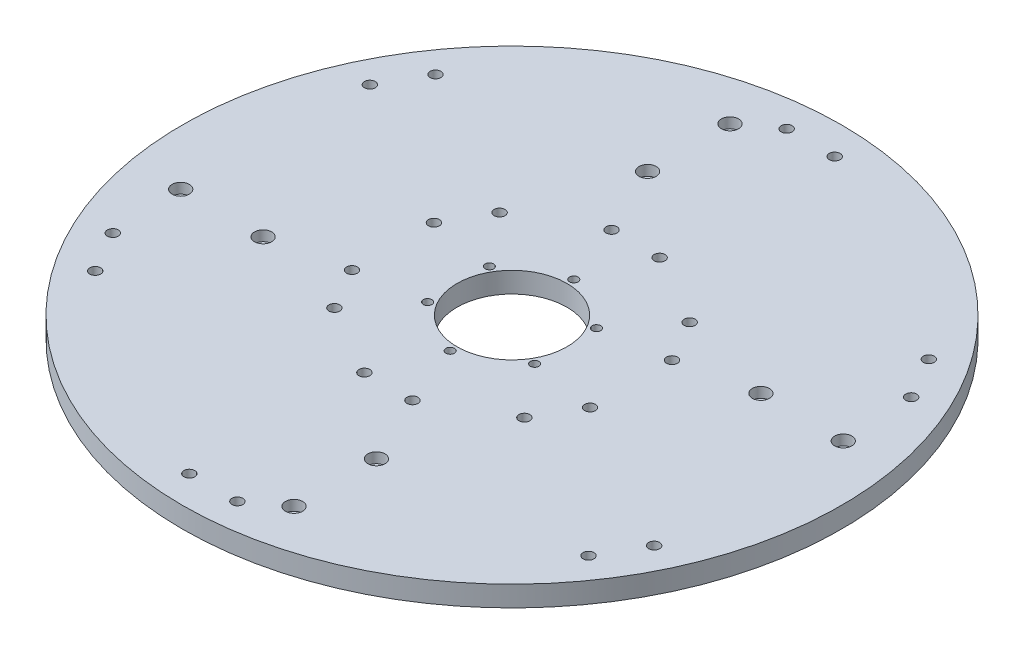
ISO-10303-21;
HEADER;
FILE_DESCRIPTION(('STEP AP214'),'2;1');
FILE_NAME('part.step','',(''),(''),'','','');
FILE_SCHEMA(('AUTOMOTIVE_DESIGN { 1 0 10303 214 1 1 1 1 }'));
ENDSEC;
DATA;
#1=APPLICATION_CONTEXT('core data for automotive mechanical design processes');
#2=APPLICATION_PROTOCOL_DEFINITION('international standard','automotive_design',2000,#1);
#3=PRODUCT_CONTEXT('',#1,'mechanical');
#4=PRODUCT('Part','Part','',(#3));
#5=PRODUCT_RELATED_PRODUCT_CATEGORY('part','',(#4));
#6=PRODUCT_DEFINITION_FORMATION('','',#4);
#7=PRODUCT_DEFINITION_CONTEXT('part definition',#1,'design');
#8=PRODUCT_DEFINITION('design','',#6,#7);
#9=PRODUCT_DEFINITION_SHAPE('','',#8);
#10=(LENGTH_UNIT() NAMED_UNIT(*) SI_UNIT(.MILLI.,.METRE.));
#11=(NAMED_UNIT(*) PLANE_ANGLE_UNIT() SI_UNIT($,.RADIAN.));
#12=(NAMED_UNIT(*) SI_UNIT($,.STERADIAN.) SOLID_ANGLE_UNIT());
#13=UNCERTAINTY_MEASURE_WITH_UNIT(LENGTH_MEASURE(1.E-05),#10,'distance_accuracy_value','');
#14=(GEOMETRIC_REPRESENTATION_CONTEXT(3) GLOBAL_UNCERTAINTY_ASSIGNED_CONTEXT((#13)) GLOBAL_UNIT_ASSIGNED_CONTEXT((#10,
#11,#12)) REPRESENTATION_CONTEXT('',''));
#15=CARTESIAN_POINT('',(0.,0.,0.));
#16=DIRECTION('',(0.,0.,1.));
#17=DIRECTION('',(1.,0.,0.));
#18=AXIS2_PLACEMENT_3D('',#15,#16,#17);
#19=CARTESIAN_POINT('',(0.,19.05,0.));
#20=DIRECTION('',(0.,1.,0.));
#21=DIRECTION('',(0.,0.,1.));
#22=AXIS2_PLACEMENT_3D('',#19,#20,#21);
#23=PLANE('',#22);
#24=CARTESIAN_POINT('',(-49.4933518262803,19.05,-28.5750000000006));
#25=DIRECTION('',(0.,1.,0.));
#26=DIRECTION('',(0.866025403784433,0.,0.50000000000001));
#27=AXIS2_PLACEMENT_3D('',#24,#25,#26);
#28=CIRCLE('',#27,3.96874999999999);
#29=CARTESIAN_POINT('',(-46.0563135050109,19.05,-26.5906250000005));
#30=VERTEX_POINT('',#29);
#31=EDGE_CURVE('E89',#30,#30,#28,.T.);
#32=ORIENTED_EDGE('',*,*,#31,.F.);
#33=EDGE_LOOP('',(#32));
#34=FACE_BOUND('',#33,.T.);
#35=CARTESIAN_POINT('',(-49.4933518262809,19.05,28.5749999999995));
#36=DIRECTION('',(0.,1.,0.));
#37=DIRECTION('',(0.866025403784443,0.,-0.499999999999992));
#38=AXIS2_PLACEMENT_3D('',#35,#36,#37);
#39=CIRCLE('',#38,3.96874999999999);
#40=CARTESIAN_POINT('',(-46.0563135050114,19.05,26.5906249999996));
#41=VERTEX_POINT('',#40);
#42=EDGE_CURVE('E95',#41,#41,#39,.T.);
#43=ORIENTED_EDGE('',*,*,#42,.F.);
#44=EDGE_LOOP('',(#43));
#45=FACE_BOUND('',#44,.T.);
#46=CARTESIAN_POINT('',(-3.99076548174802E-13,19.05,57.15));
#47=DIRECTION('',(0.,1.,0.));
#48=DIRECTION('',(0.,0.,-1.));
#49=AXIS2_PLACEMENT_3D('',#46,#47,#48);
#50=CIRCLE('',#49,3.96874999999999);
#51=CARTESIAN_POINT('',(-3.71362898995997E-13,19.05,53.18125));
#52=VERTEX_POINT('',#51);
#53=EDGE_CURVE('E101',#52,#52,#50,.T.);
#54=ORIENTED_EDGE('',*,*,#53,.F.);
#55=EDGE_LOOP('',(#54));
#56=FACE_BOUND('',#55,.T.);
#57=CARTESIAN_POINT('',(49.4933518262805,19.05,28.5750000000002));
#58=DIRECTION('',(0.,1.,0.));
#59=DIRECTION('',(-0.866025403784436,0.,-0.500000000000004));
#60=AXIS2_PLACEMENT_3D('',#57,#58,#59);
#61=CIRCLE('',#60,3.96874999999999);
#62=CARTESIAN_POINT('',(46.0563135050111,19.05,26.5906250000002));
#63=VERTEX_POINT('',#62);
#64=EDGE_CURVE('E107',#63,#63,#61,.T.);
#65=ORIENTED_EDGE('',*,*,#64,.F.);
#66=EDGE_LOOP('',(#65));
#67=FACE_BOUND('',#66,.T.);
#68=CARTESIAN_POINT('',(49.4933518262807,19.05,-28.5749999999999));
#69=DIRECTION('',(0.,1.,0.));
#70=DIRECTION('',(-0.86602540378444,0.,0.499999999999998));
#71=AXIS2_PLACEMENT_3D('',#68,#69,#70);
#72=CIRCLE('',#71,3.96874999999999);
#73=CARTESIAN_POINT('',(46.0563135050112,19.05,-26.5906249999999));
#74=VERTEX_POINT('',#73);
#75=EDGE_CURVE('E113',#74,#74,#72,.T.);
#76=ORIENTED_EDGE('',*,*,#75,.F.);
#77=EDGE_LOOP('',(#76));
#78=FACE_BOUND('',#77,.T.);
#79=CARTESIAN_POINT('',(0.,19.05,-57.15));
#80=DIRECTION('',(0.,1.,0.));
#81=DIRECTION('',(0.,0.,1.));
#82=AXIS2_PLACEMENT_3D('',#79,#80,#81);
#83=CIRCLE('',#82,3.96874999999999);
#84=CARTESIAN_POINT('',(0.,19.05,-53.18125));
#85=VERTEX_POINT('',#84);
#86=EDGE_CURVE('E116',#85,#85,#83,.T.);
#87=ORIENTED_EDGE('',*,*,#86,.F.);
#88=EDGE_LOOP('',(#87));
#89=FACE_BOUND('',#88,.T.);
#90=CARTESIAN_POINT('',(-52.3874999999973,19.05,-254.000000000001));
#91=DIRECTION('',(0.,1.,0.));
#92=DIRECTION('',(1.,0.,0.));
#93=AXIS2_PLACEMENT_3D('',#90,#91,#92);
#94=CIRCLE('',#93,7.93749999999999);
#95=CARTESIAN_POINT('',(-44.4499999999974,19.05,-254.000000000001));
#96=VERTEX_POINT('',#95);
#97=EDGE_CURVE('E122',#96,#96,#94,.T.);
#98=ORIENTED_EDGE('',*,*,#97,.F.);
#99=EDGE_LOOP('',(#98));
#100=FACE_BOUND('',#99,.T.);
#101=CARTESIAN_POINT('',(-254.,19.05,52.3874999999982));
#102=DIRECTION('',(0.,1.,0.));
#103=DIRECTION('',(0.,0.,-1.));
#104=AXIS2_PLACEMENT_3D('',#101,#102,#103);
#105=CIRCLE('',#104,7.93749999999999);
#106=CARTESIAN_POINT('',(-254.,19.05,44.4499999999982));
#107=VERTEX_POINT('',#106);
#108=EDGE_CURVE('E134',#107,#107,#105,.T.);
#109=ORIENTED_EDGE('',*,*,#108,.F.);
#110=EDGE_LOOP('',(#109));
#111=FACE_BOUND('',#110,.T.);
#112=CARTESIAN_POINT('',(52.3874999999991,19.05,254.));
#113=DIRECTION('',(0.,1.,0.));
#114=DIRECTION('',(-1.,0.,0.));
#115=AXIS2_PLACEMENT_3D('',#112,#113,#114);
#116=CIRCLE('',#115,7.93749999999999);
#117=CARTESIAN_POINT('',(44.4499999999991,19.05,254.));
#118=VERTEX_POINT('',#117);
#119=EDGE_CURVE('E146',#118,#118,#116,.T.);
#120=ORIENTED_EDGE('',*,*,#119,.F.);
#121=EDGE_LOOP('',(#120));
#122=FACE_BOUND('',#121,.T.);
#123=CARTESIAN_POINT('',(-52.3874999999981,19.05,-177.800000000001));
#124=DIRECTION('',(0.,1.,0.));
#125=DIRECTION('',(1.,0.,0.));
#126=AXIS2_PLACEMENT_3D('',#123,#124,#125);
#127=CIRCLE('',#126,7.93749999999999);
#128=CARTESIAN_POINT('',(-44.4499999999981,19.05,-177.8));
#129=VERTEX_POINT('',#128);
#130=EDGE_CURVE('E158',#129,#129,#127,.T.);
#131=ORIENTED_EDGE('',*,*,#130,.F.);
#132=EDGE_LOOP('',(#131));
#133=FACE_BOUND('',#132,.T.);
#134=CARTESIAN_POINT('',(-177.8,19.05,52.3874999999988));
#135=DIRECTION('',(0.,1.,0.));
#136=DIRECTION('',(0.,0.,-1.));
#137=AXIS2_PLACEMENT_3D('',#134,#135,#136);
#138=CIRCLE('',#137,7.93749999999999);
#139=CARTESIAN_POINT('',(-177.8,19.05,44.4499999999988));
#140=VERTEX_POINT('',#139);
#141=EDGE_CURVE('E170',#140,#140,#138,.T.);
#142=ORIENTED_EDGE('',*,*,#141,.F.);
#143=EDGE_LOOP('',(#142));
#144=FACE_BOUND('',#143,.T.);
#145=CARTESIAN_POINT('',(52.3874999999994,19.05,177.8));
#146=DIRECTION('',(0.,1.,0.));
#147=DIRECTION('',(-1.,0.,0.));
#148=AXIS2_PLACEMENT_3D('',#145,#146,#147);
#149=CIRCLE('',#148,7.93749999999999);
#150=CARTESIAN_POINT('',(44.4499999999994,19.05,177.8));
#151=VERTEX_POINT('',#150);
#152=EDGE_CURVE('E182',#151,#151,#149,.T.);
#153=ORIENTED_EDGE('',*,*,#152,.F.);
#154=EDGE_LOOP('',(#153));
#155=FACE_BOUND('',#154,.T.);
#156=CARTESIAN_POINT('',(177.8,19.05,-52.3875));
#157=DIRECTION('',(0.,1.,0.));
#158=DIRECTION('',(0.,0.,1.));
#159=AXIS2_PLACEMENT_3D('',#156,#157,#158);
#160=CIRCLE('',#159,7.93749999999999);
#161=CARTESIAN_POINT('',(177.8,19.05,-44.45));
#162=VERTEX_POINT('',#161);
#163=EDGE_CURVE('E194',#162,#162,#160,.T.);
#164=ORIENTED_EDGE('',*,*,#163,.F.);
#165=EDGE_LOOP('',(#164));
#166=FACE_BOUND('',#165,.T.);
#167=CARTESIAN_POINT('',(254.,19.05,-52.3875));
#168=DIRECTION('',(0.,1.,0.));
#169=DIRECTION('',(0.,0.,1.));
#170=AXIS2_PLACEMENT_3D('',#167,#168,#169);
#171=CIRCLE('',#170,7.93749999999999);
#172=CARTESIAN_POINT('',(254.,19.05,-44.45));
#173=VERTEX_POINT('',#172);
#174=EDGE_CURVE('E206',#173,#173,#171,.T.);
#175=ORIENTED_EDGE('',*,*,#174,.F.);
#176=EDGE_LOOP('',(#175));
#177=FACE_BOUND('',#176,.T.);
#178=CARTESIAN_POINT('',(228.105367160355,19.05,157.359914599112));
#179=DIRECTION('',(0.,-1.,0.));
#180=DIRECTION('',(-0.866025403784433,0.,-0.50000000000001));
#181=AXIS2_PLACEMENT_3D('',#178,#179,#180);
#182=CIRCLE('',#181,5.04189999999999);
#183=CARTESIAN_POINT('',(223.738953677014,19.05,154.838964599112));
#184=VERTEX_POINT('',#183);
#185=EDGE_CURVE('E221',#184,#184,#182,.T.);
#186=ORIENTED_EDGE('',*,*,#185,.T.);
#187=EDGE_LOOP('',(#186));
#188=FACE_BOUND('',#187,.T.);
#189=CARTESIAN_POINT('',(250.330367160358,19.05,-118.865085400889));
#190=DIRECTION('',(0.,-1.,0.));
#191=DIRECTION('',(-0.866025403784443,0.,0.499999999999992));
#192=AXIS2_PLACEMENT_3D('',#189,#190,#191);
#193=CIRCLE('',#192,5.04189999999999);
#194=CARTESIAN_POINT('',(245.963953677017,19.05,-116.344135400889));
#195=VERTEX_POINT('',#194);
#196=EDGE_CURVE('E233',#195,#195,#193,.T.);
#197=ORIENTED_EDGE('',*,*,#196,.T.);
#198=EDGE_LOOP('',(#197));
#199=FACE_BOUND('',#198,.T.);
#200=CARTESIAN_POINT('',(22.2250000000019,19.05,-276.225));
#201=DIRECTION('',(0.,-1.,0.));
#202=DIRECTION('',(0.,0.,1.));
#203=AXIS2_PLACEMENT_3D('',#200,#201,#202);
#204=CIRCLE('',#203,5.04189999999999);
#205=CARTESIAN_POINT('',(22.2250000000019,19.05,-271.1831));
#206=VERTEX_POINT('',#205);
#207=EDGE_CURVE('E245',#206,#206,#204,.T.);
#208=ORIENTED_EDGE('',*,*,#207,.T.);
#209=EDGE_LOOP('',(#208));
#210=FACE_BOUND('',#209,.T.);
#211=CARTESIAN_POINT('',(-228.105367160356,19.05,-157.35991459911));
#212=DIRECTION('',(0.,-1.,0.));
#213=DIRECTION('',(0.866025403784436,0.,0.500000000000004));
#214=AXIS2_PLACEMENT_3D('',#211,#212,#213);
#215=CIRCLE('',#214,5.04189999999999);
#216=CARTESIAN_POINT('',(-223.738953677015,19.05,-154.83896459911));
#217=VERTEX_POINT('',#216);
#218=EDGE_CURVE('E257',#217,#217,#215,.T.);
#219=ORIENTED_EDGE('',*,*,#218,.T.);
#220=EDGE_LOOP('',(#219));
#221=FACE_BOUND('',#220,.T.);
#222=CARTESIAN_POINT('',(-250.330367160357,19.05,118.86508540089));
#223=DIRECTION('',(0.,-1.,0.));
#224=DIRECTION('',(0.86602540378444,0.,-0.499999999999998));
#225=AXIS2_PLACEMENT_3D('',#222,#223,#224);
#226=CIRCLE('',#225,5.04189999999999);
#227=CARTESIAN_POINT('',(-245.963953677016,19.05,116.34413540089));
#228=VERTEX_POINT('',#227);
#229=EDGE_CURVE('E269',#228,#228,#226,.T.);
#230=ORIENTED_EDGE('',*,*,#229,.T.);
#231=EDGE_LOOP('',(#230));
#232=FACE_BOUND('',#231,.T.);
#233=CARTESIAN_POINT('',(250.330367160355,19.05,118.865085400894));
#234=DIRECTION('',(0.,-1.,0.));
#235=DIRECTION('',(-0.866025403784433,0.,-0.50000000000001));
#236=AXIS2_PLACEMENT_3D('',#233,#234,#235);
#237=CIRCLE('',#236,5.04189999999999);
#238=CARTESIAN_POINT('',(245.963953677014,19.05,116.344135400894));
#239=VERTEX_POINT('',#238);
#240=EDGE_CURVE('E281',#239,#239,#237,.T.);
#241=ORIENTED_EDGE('',*,*,#240,.T.);
#242=EDGE_LOOP('',(#241));
#243=FACE_BOUND('',#242,.T.);
#244=CARTESIAN_POINT('',(228.105367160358,19.05,-157.359914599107));
#245=DIRECTION('',(0.,-1.,0.));
#246=DIRECTION('',(-0.866025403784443,0.,0.499999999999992));
#247=AXIS2_PLACEMENT_3D('',#244,#245,#246);
#248=CIRCLE('',#247,5.04189999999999);
#249=CARTESIAN_POINT('',(223.738953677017,19.05,-154.838964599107));
#250=VERTEX_POINT('',#249);
#251=EDGE_CURVE('E293',#250,#250,#248,.T.);
#252=ORIENTED_EDGE('',*,*,#251,.T.);
#253=EDGE_LOOP('',(#252));
#254=FACE_BOUND('',#253,.T.);
#255=CARTESIAN_POINT('',(-22.2249999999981,19.05,-276.225));
#256=DIRECTION('',(0.,-1.,0.));
#257=DIRECTION('',(0.,0.,1.));
#258=AXIS2_PLACEMENT_3D('',#255,#256,#257);
#259=CIRCLE('',#258,5.04189999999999);
#260=CARTESIAN_POINT('',(-22.2249999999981,19.05,-271.1831));
#261=VERTEX_POINT('',#260);
#262=EDGE_CURVE('E305',#261,#261,#259,.T.);
#263=ORIENTED_EDGE('',*,*,#262,.T.);
#264=EDGE_LOOP('',(#263));
#265=FACE_BOUND('',#264,.T.);
#266=CARTESIAN_POINT('',(-250.330367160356,19.05,-118.865085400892));
#267=DIRECTION('',(0.,-1.,0.));
#268=DIRECTION('',(0.866025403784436,0.,0.500000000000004));
#269=AXIS2_PLACEMENT_3D('',#266,#267,#268);
#270=CIRCLE('',#269,5.04189999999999);
#271=CARTESIAN_POINT('',(-245.963953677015,19.05,-116.344135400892));
#272=VERTEX_POINT('',#271);
#273=EDGE_CURVE('E317',#272,#272,#270,.T.);
#274=ORIENTED_EDGE('',*,*,#273,.T.);
#275=EDGE_LOOP('',(#274));
#276=FACE_BOUND('',#275,.T.);
#277=CARTESIAN_POINT('',(-228.105367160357,19.05,157.359914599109));
#278=DIRECTION('',(0.,-1.,0.));
#279=DIRECTION('',(0.86602540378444,0.,-0.499999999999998));
#280=AXIS2_PLACEMENT_3D('',#277,#278,#279);
#281=CIRCLE('',#280,5.04189999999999);
#282=CARTESIAN_POINT('',(-223.738953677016,19.05,154.838964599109));
#283=VERTEX_POINT('',#282);
#284=EDGE_CURVE('E329',#283,#283,#281,.T.);
#285=ORIENTED_EDGE('',*,*,#284,.T.);
#286=EDGE_LOOP('',(#285));
#287=FACE_BOUND('',#286,.T.);
#288=CARTESIAN_POINT('',(87.8742036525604,19.05,76.3974145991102));
#289=DIRECTION('',(0.,-1.,0.));
#290=DIRECTION('',(-0.866025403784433,0.,-0.50000000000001));
#291=AXIS2_PLACEMENT_3D('',#288,#289,#290);
#292=CIRCLE('',#291,5.04189999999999);
#293=CARTESIAN_POINT('',(83.5077901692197,19.05,73.8764645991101));
#294=VERTEX_POINT('',#293);
#295=EDGE_CURVE('E341',#294,#294,#292,.T.);
#296=ORIENTED_EDGE('',*,*,#295,.T.);
#297=EDGE_LOOP('',(#296));
#298=FACE_BOUND('',#297,.T.);
#299=CARTESIAN_POINT('',(110.099203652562,19.05,-37.9025854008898));
#300=DIRECTION('',(0.,-1.,0.));
#301=DIRECTION('',(-0.866025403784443,0.,0.499999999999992));
#302=AXIS2_PLACEMENT_3D('',#299,#300,#301);
#303=CIRCLE('',#302,5.04189999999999);
#304=CARTESIAN_POINT('',(105.732790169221,19.05,-35.3816354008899));
#305=VERTEX_POINT('',#304);
#306=EDGE_CURVE('E353',#305,#305,#303,.T.);
#307=ORIENTED_EDGE('',*,*,#306,.T.);
#308=EDGE_LOOP('',(#307));
#309=FACE_BOUND('',#308,.T.);
#310=CARTESIAN_POINT('',(22.2250000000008,19.05,-114.3));
#311=DIRECTION('',(0.,-1.,0.));
#312=DIRECTION('',(0.,0.,1.));
#313=AXIS2_PLACEMENT_3D('',#310,#311,#312);
#314=CIRCLE('',#313,5.04189999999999);
#315=CARTESIAN_POINT('',(22.2250000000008,19.05,-109.2581));
#316=VERTEX_POINT('',#315);
#317=EDGE_CURVE('E365',#316,#316,#314,.T.);
#318=ORIENTED_EDGE('',*,*,#317,.T.);
#319=EDGE_LOOP('',(#318));
#320=FACE_BOUND('',#319,.T.);
#321=CARTESIAN_POINT('',(-87.874203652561,19.05,-76.3974145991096));
#322=DIRECTION('',(0.,-1.,0.));
#323=DIRECTION('',(0.866025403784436,0.,0.500000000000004));
#324=AXIS2_PLACEMENT_3D('',#321,#322,#323);
#325=CIRCLE('',#324,5.04189999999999);
#326=CARTESIAN_POINT('',(-83.5077901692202,19.05,-73.8764645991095));
#327=VERTEX_POINT('',#326);
#328=EDGE_CURVE('E377',#327,#327,#325,.T.);
#329=ORIENTED_EDGE('',*,*,#328,.T.);
#330=EDGE_LOOP('',(#329));
#331=FACE_BOUND('',#330,.T.);
#332=CARTESIAN_POINT('',(-110.099203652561,19.05,37.9025854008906));
#333=DIRECTION('',(0.,-1.,0.));
#334=DIRECTION('',(0.86602540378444,0.,-0.499999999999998));
#335=AXIS2_PLACEMENT_3D('',#332,#333,#334);
#336=CIRCLE('',#335,5.04189999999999);
#337=CARTESIAN_POINT('',(-105.732790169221,19.05,35.3816354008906));
#338=VERTEX_POINT('',#337);
#339=EDGE_CURVE('E389',#338,#338,#336,.T.);
#340=ORIENTED_EDGE('',*,*,#339,.T.);
#341=EDGE_LOOP('',(#340));
#342=FACE_BOUND('',#341,.T.);
#343=CARTESIAN_POINT('',(110.099203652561,19.05,37.9025854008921));
#344=DIRECTION('',(0.,-1.,0.));
#345=DIRECTION('',(-0.866025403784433,0.,-0.50000000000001));
#346=AXIS2_PLACEMENT_3D('',#343,#344,#345);
#347=CIRCLE('',#346,5.04189999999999);
#348=CARTESIAN_POINT('',(105.73279016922,19.05,35.3816354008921));
#349=VERTEX_POINT('',#348);
#350=EDGE_CURVE('E401',#349,#349,#347,.T.);
#351=ORIENTED_EDGE('',*,*,#350,.T.);
#352=EDGE_LOOP('',(#351));
#353=FACE_BOUND('',#352,.T.);
#354=CARTESIAN_POINT('',(87.874203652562,19.05,-76.3974145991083));
#355=DIRECTION('',(0.,-1.,0.));
#356=DIRECTION('',(-0.866025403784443,0.,0.499999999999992));
#357=AXIS2_PLACEMENT_3D('',#354,#355,#356);
#358=CIRCLE('',#357,5.04189999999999);
#359=CARTESIAN_POINT('',(83.5077901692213,19.05,-73.8764645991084));
#360=VERTEX_POINT('',#359);
#361=EDGE_CURVE('E413',#360,#360,#358,.T.);
#362=ORIENTED_EDGE('',*,*,#361,.T.);
#363=EDGE_LOOP('',(#362));
#364=FACE_BOUND('',#363,.T.);
#365=CARTESIAN_POINT('',(-22.2249999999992,19.05,-114.3));
#366=DIRECTION('',(0.,-1.,0.));
#367=DIRECTION('',(0.,0.,1.));
#368=AXIS2_PLACEMENT_3D('',#365,#366,#367);
#369=CIRCLE('',#368,5.04189999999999);
#370=CARTESIAN_POINT('',(-22.2249999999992,19.05,-109.2581));
#371=VERTEX_POINT('',#370);
#372=EDGE_CURVE('E425',#371,#371,#369,.T.);
#373=ORIENTED_EDGE('',*,*,#372,.T.);
#374=EDGE_LOOP('',(#373));
#375=FACE_BOUND('',#374,.T.);
#376=CARTESIAN_POINT('',(-110.099203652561,19.05,-37.9025854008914));
#377=DIRECTION('',(0.,-1.,0.));
#378=DIRECTION('',(0.866025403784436,0.,0.500000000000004));
#379=AXIS2_PLACEMENT_3D('',#376,#377,#378);
#380=CIRCLE('',#379,5.04189999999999);
#381=CARTESIAN_POINT('',(-105.73279016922,19.05,-35.3816354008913));
#382=VERTEX_POINT('',#381);
#383=EDGE_CURVE('E437',#382,#382,#380,.T.);
#384=ORIENTED_EDGE('',*,*,#383,.T.);
#385=EDGE_LOOP('',(#384));
#386=FACE_BOUND('',#385,.T.);
#387=CARTESIAN_POINT('',(-87.8742036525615,19.05,76.3974145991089));
#388=DIRECTION('',(0.,-1.,0.));
#389=DIRECTION('',(0.86602540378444,0.,-0.499999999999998));
#390=AXIS2_PLACEMENT_3D('',#387,#388,#389);
#391=CIRCLE('',#390,5.04189999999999);
#392=CARTESIAN_POINT('',(-83.5077901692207,19.05,73.8764645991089));
#393=VERTEX_POINT('',#392);
#394=EDGE_CURVE('E449',#393,#393,#391,.T.);
#395=ORIENTED_EDGE('',*,*,#394,.T.);
#396=EDGE_LOOP('',(#395));
#397=FACE_BOUND('',#396,.T.);
#398=CARTESIAN_POINT('',(22.225,19.05,114.3));
#399=DIRECTION('',(0.,-1.,0.));
#400=DIRECTION('',(0.,0.,-1.));
#401=AXIS2_PLACEMENT_3D('',#398,#399,#400);
#402=CIRCLE('',#401,5.04189999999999);
#403=CARTESIAN_POINT('',(22.225,19.05,109.2581));
#404=VERTEX_POINT('',#403);
#405=EDGE_CURVE('E467',#404,#404,#402,.T.);
#406=ORIENTED_EDGE('',*,*,#405,.T.);
#407=EDGE_LOOP('',(#406));
#408=FACE_BOUND('',#407,.T.);
#409=CARTESIAN_POINT('',(-22.225,19.05,276.225));
#410=DIRECTION('',(0.,-1.,0.));
#411=DIRECTION('',(0.,0.,-1.));
#412=AXIS2_PLACEMENT_3D('',#409,#410,#411);
#413=CIRCLE('',#412,5.04189999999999);
#414=CARTESIAN_POINT('',(-22.225,19.05,271.1831));
#415=VERTEX_POINT('',#414);
#416=EDGE_CURVE('E479',#415,#415,#413,.T.);
#417=ORIENTED_EDGE('',*,*,#416,.T.);
#418=EDGE_LOOP('',(#417));
#419=FACE_BOUND('',#418,.T.);
#420=CARTESIAN_POINT('',(22.225,19.05,276.225));
#421=DIRECTION('',(0.,-1.,0.));
#422=DIRECTION('',(0.,0.,-1.));
#423=AXIS2_PLACEMENT_3D('',#420,#421,#422);
#424=CIRCLE('',#423,5.04189999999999);
#425=CARTESIAN_POINT('',(22.225,19.05,271.1831));
#426=VERTEX_POINT('',#425);
#427=EDGE_CURVE('E491',#426,#426,#424,.T.);
#428=ORIENTED_EDGE('',*,*,#427,.T.);
#429=EDGE_LOOP('',(#428));
#430=FACE_BOUND('',#429,.T.);
#431=CARTESIAN_POINT('',(-22.225,19.05,114.3));
#432=DIRECTION('',(0.,-1.,0.));
#433=DIRECTION('',(0.,0.,-1.));
#434=AXIS2_PLACEMENT_3D('',#431,#432,#433);
#435=CIRCLE('',#434,5.04189999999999);
#436=CARTESIAN_POINT('',(-22.225,19.05,109.2581));
#437=VERTEX_POINT('',#436);
#438=EDGE_CURVE('E503',#437,#437,#435,.T.);
#439=ORIENTED_EDGE('',*,*,#438,.T.);
#440=EDGE_LOOP('',(#439));
#441=FACE_BOUND('',#440,.T.);
#442=CARTESIAN_POINT('',(0.,19.05,0.));
#443=DIRECTION('',(0.,1.,0.));
#444=DIRECTION('',(0.,0.,1.));
#445=AXIS2_PLACEMENT_3D('',#442,#443,#444);
#446=CIRCLE('',#445,304.8);
#447=CARTESIAN_POINT('',(0.,19.05,-304.8));
#448=VERTEX_POINT('',#447);
#449=EDGE_CURVE('E11',#448,#448,#446,.T.);
#450=ORIENTED_EDGE('',*,*,#449,.T.);
#451=EDGE_LOOP('',(#450));
#452=FACE_BOUND('',#451,.T.);
#453=CARTESIAN_POINT('',(0.,19.05,0.));
#454=DIRECTION('',(0.,1.,0.));
#455=DIRECTION('',(0.,0.,1.));
#456=AXIS2_PLACEMENT_3D('',#453,#454,#455);
#457=CIRCLE('',#456,50.8);
#458=CARTESIAN_POINT('',(0.,19.05,-50.8));
#459=VERTEX_POINT('',#458);
#460=EDGE_CURVE('E507',#459,#459,#457,.T.);
#461=ORIENTED_EDGE('',*,*,#460,.F.);
#462=EDGE_LOOP('',(#461));
#463=FACE_BOUND('',#462,.T.);
#464=ADVANCED_FACE('F32',(#34,#45,#56,#67,#78,#89,#100,#111,#122,#133,#144,#155,#166,#177,#188,
#199,#210,#221,#232,#243,#254,#265,#276,#287,#298,#309,#320,#331,#342,#353,#364,#375,#386,#397,
#408,#419,#430,#441,#452,#463),#23,.T.);
#465=CARTESIAN_POINT('',(0.,0.,0.));
#466=DIRECTION('',(0.,1.,0.));
#467=DIRECTION('',(0.,0.,1.));
#468=AXIS2_PLACEMENT_3D('',#465,#466,#467);
#469=PLANE('',#468);
#470=CARTESIAN_POINT('',(-196.85,0.,-177.8));
#471=DIRECTION('',(0.,-1.,0.));
#472=DIRECTION('',(0.,0.,-1.));
#473=AXIS2_PLACEMENT_3D('',#470,#471,#472);
#474=CIRCLE('',#473,2.09999999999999);
#475=CARTESIAN_POINT('',(-196.85,0.,-179.9));
#476=VERTEX_POINT('',#475);
#477=EDGE_CURVE('E64',#476,#476,#474,.T.);
#478=ORIENTED_EDGE('',*,*,#477,.F.);
#479=EDGE_LOOP('',(#478));
#480=FACE_BOUND('',#479,.T.);
#481=CARTESIAN_POINT('',(-112.412523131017,0.,-129.05));
#482=DIRECTION('',(0.,-1.,0.));
#483=DIRECTION('',(0.,0.,-1.));
#484=AXIS2_PLACEMENT_3D('',#481,#482,#483);
#485=CIRCLE('',#484,2.1);
#486=CARTESIAN_POINT('',(-112.412523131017,0.,-131.15));
#487=VERTEX_POINT('',#486);
#488=EDGE_CURVE('E63',#487,#487,#485,.T.);
#489=ORIENTED_EDGE('',*,*,#488,.F.);
#490=EDGE_LOOP('',(#489));
#491=FACE_BOUND('',#490,.T.);
#492=CARTESIAN_POINT('',(-160.412523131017,0.,-45.9115612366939));
#493=DIRECTION('',(0.,-1.,0.));
#494=DIRECTION('',(0.,0.,-1.));
#495=AXIS2_PLACEMENT_3D('',#492,#493,#494);
#496=CIRCLE('',#495,2.09999999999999);
#497=CARTESIAN_POINT('',(-160.412523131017,0.,-48.0115612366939));
#498=VERTEX_POINT('',#497);
#499=EDGE_CURVE('E74',#498,#498,#496,.T.);
#500=ORIENTED_EDGE('',*,*,#499,.F.);
#501=EDGE_LOOP('',(#500));
#502=FACE_BOUND('',#501,.T.);
#503=CARTESIAN_POINT('',(-244.85,0.,-94.6615612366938));
#504=DIRECTION('',(0.,-1.,0.));
#505=DIRECTION('',(0.,0.,-1.));
#506=AXIS2_PLACEMENT_3D('',#503,#504,#505);
#507=CIRCLE('',#506,2.09999999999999);
#508=CARTESIAN_POINT('',(-244.85,0.,-96.7615612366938));
#509=VERTEX_POINT('',#508);
#510=EDGE_CURVE('E80',#509,#509,#507,.T.);
#511=ORIENTED_EDGE('',*,*,#510,.F.);
#512=EDGE_LOOP('',(#511));
#513=FACE_BOUND('',#512,.T.);
#514=CARTESIAN_POINT('',(-49.4933518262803,0.,-28.5750000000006));
#515=DIRECTION('',(0.,1.,0.));
#516=DIRECTION('',(0.866025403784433,0.,0.50000000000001));
#517=AXIS2_PLACEMENT_3D('',#514,#515,#516);
#518=CIRCLE('',#517,3.96875);
#519=CARTESIAN_POINT('',(-46.0563135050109,0.,-26.5906250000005));
#520=VERTEX_POINT('',#519);
#521=EDGE_CURVE('E86',#520,#520,#518,.T.);
#522=ORIENTED_EDGE('',*,*,#521,.T.);
#523=EDGE_LOOP('',(#522));
#524=FACE_BOUND('',#523,.T.);
#525=CARTESIAN_POINT('',(-49.4933518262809,0.,28.5749999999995));
#526=DIRECTION('',(0.,1.,0.));
#527=DIRECTION('',(0.866025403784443,0.,-0.499999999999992));
#528=AXIS2_PLACEMENT_3D('',#525,#526,#527);
#529=CIRCLE('',#528,3.96875);
#530=CARTESIAN_POINT('',(-46.0563135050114,0.,26.5906249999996));
#531=VERTEX_POINT('',#530);
#532=EDGE_CURVE('E92',#531,#531,#529,.T.);
#533=ORIENTED_EDGE('',*,*,#532,.T.);
#534=EDGE_LOOP('',(#533));
#535=FACE_BOUND('',#534,.T.);
#536=CARTESIAN_POINT('',(-3.99076548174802E-13,0.,57.15));
#537=DIRECTION('',(0.,1.,0.));
#538=DIRECTION('',(0.,0.,-1.));
#539=AXIS2_PLACEMENT_3D('',#536,#537,#538);
#540=CIRCLE('',#539,3.96875);
#541=CARTESIAN_POINT('',(-3.71362898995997E-13,0.,53.18125));
#542=VERTEX_POINT('',#541);
#543=EDGE_CURVE('E98',#542,#542,#540,.T.);
#544=ORIENTED_EDGE('',*,*,#543,.T.);
#545=EDGE_LOOP('',(#544));
#546=FACE_BOUND('',#545,.T.);
#547=CARTESIAN_POINT('',(49.4933518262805,0.,28.5750000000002));
#548=DIRECTION('',(0.,1.,0.));
#549=DIRECTION('',(-0.866025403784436,0.,-0.500000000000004));
#550=AXIS2_PLACEMENT_3D('',#547,#548,#549);
#551=CIRCLE('',#550,3.96875);
#552=CARTESIAN_POINT('',(46.0563135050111,0.,26.5906250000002));
#553=VERTEX_POINT('',#552);
#554=EDGE_CURVE('E104',#553,#553,#551,.T.);
#555=ORIENTED_EDGE('',*,*,#554,.T.);
#556=EDGE_LOOP('',(#555));
#557=FACE_BOUND('',#556,.T.);
#558=CARTESIAN_POINT('',(49.4933518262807,0.,-28.5749999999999));
#559=DIRECTION('',(0.,1.,0.));
#560=DIRECTION('',(-0.86602540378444,0.,0.499999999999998));
#561=AXIS2_PLACEMENT_3D('',#558,#559,#560);
#562=CIRCLE('',#561,3.96875);
#563=CARTESIAN_POINT('',(46.0563135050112,0.,-26.5906249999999));
#564=VERTEX_POINT('',#563);
#565=EDGE_CURVE('E110',#564,#564,#562,.T.);
#566=ORIENTED_EDGE('',*,*,#565,.T.);
#567=EDGE_LOOP('',(#566));
#568=FACE_BOUND('',#567,.T.);
#569=CARTESIAN_POINT('',(0.,0.,-57.15));
#570=DIRECTION('',(0.,1.,0.));
#571=DIRECTION('',(0.,0.,1.));
#572=AXIS2_PLACEMENT_3D('',#569,#570,#571);
#573=CIRCLE('',#572,3.96875);
#574=CARTESIAN_POINT('',(0.,0.,-53.18125));
#575=VERTEX_POINT('',#574);
#576=EDGE_CURVE('E119',#575,#575,#573,.T.);
#577=ORIENTED_EDGE('',*,*,#576,.T.);
#578=EDGE_LOOP('',(#577));
#579=FACE_BOUND('',#578,.T.);
#580=CARTESIAN_POINT('',(-52.3874999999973,0.,-254.000000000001));
#581=DIRECTION('',(0.,1.,0.));
#582=DIRECTION('',(1.,0.,0.));
#583=AXIS2_PLACEMENT_3D('',#580,#581,#582);
#584=CIRCLE('',#583,5.04189999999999);
#585=CARTESIAN_POINT('',(-47.3455999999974,0.,-254.000000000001));
#586=VERTEX_POINT('',#585);
#587=EDGE_CURVE('E125',#586,#586,#584,.T.);
#588=ORIENTED_EDGE('',*,*,#587,.T.);
#589=EDGE_LOOP('',(#588));
#590=FACE_BOUND('',#589,.T.);
#591=CARTESIAN_POINT('',(-254.,0.,52.3874999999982));
#592=DIRECTION('',(0.,1.,0.));
#593=DIRECTION('',(0.,0.,-1.));
#594=AXIS2_PLACEMENT_3D('',#591,#592,#593);
#595=CIRCLE('',#594,5.04189999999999);
#596=CARTESIAN_POINT('',(-254.,0.,47.3455999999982));
#597=VERTEX_POINT('',#596);
#598=EDGE_CURVE('E137',#597,#597,#595,.T.);
#599=ORIENTED_EDGE('',*,*,#598,.T.);
#600=EDGE_LOOP('',(#599));
#601=FACE_BOUND('',#600,.T.);
#602=CARTESIAN_POINT('',(52.3874999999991,0.,254.));
#603=DIRECTION('',(0.,1.,0.));
#604=DIRECTION('',(-1.,0.,0.));
#605=AXIS2_PLACEMENT_3D('',#602,#603,#604);
#606=CIRCLE('',#605,5.04189999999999);
#607=CARTESIAN_POINT('',(47.3455999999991,0.,254.));
#608=VERTEX_POINT('',#607);
#609=EDGE_CURVE('E149',#608,#608,#606,.T.);
#610=ORIENTED_EDGE('',*,*,#609,.T.);
#611=EDGE_LOOP('',(#610));
#612=FACE_BOUND('',#611,.T.);
#613=CARTESIAN_POINT('',(-52.3874999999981,0.,-177.800000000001));
#614=DIRECTION('',(0.,1.,0.));
#615=DIRECTION('',(1.,0.,0.));
#616=AXIS2_PLACEMENT_3D('',#613,#614,#615);
#617=CIRCLE('',#616,5.04189999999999);
#618=CARTESIAN_POINT('',(-47.3455999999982,0.,-177.8));
#619=VERTEX_POINT('',#618);
#620=EDGE_CURVE('E161',#619,#619,#617,.T.);
#621=ORIENTED_EDGE('',*,*,#620,.T.);
#622=EDGE_LOOP('',(#621));
#623=FACE_BOUND('',#622,.T.);
#624=CARTESIAN_POINT('',(-177.8,0.,52.3874999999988));
#625=DIRECTION('',(0.,1.,0.));
#626=DIRECTION('',(0.,0.,-1.));
#627=AXIS2_PLACEMENT_3D('',#624,#625,#626);
#628=CIRCLE('',#627,5.04189999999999);
#629=CARTESIAN_POINT('',(-177.8,0.,47.3455999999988));
#630=VERTEX_POINT('',#629);
#631=EDGE_CURVE('E173',#630,#630,#628,.T.);
#632=ORIENTED_EDGE('',*,*,#631,.T.);
#633=EDGE_LOOP('',(#632));
#634=FACE_BOUND('',#633,.T.);
#635=CARTESIAN_POINT('',(52.3874999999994,0.,177.8));
#636=DIRECTION('',(0.,1.,0.));
#637=DIRECTION('',(-1.,0.,0.));
#638=AXIS2_PLACEMENT_3D('',#635,#636,#637);
#639=CIRCLE('',#638,5.04189999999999);
#640=CARTESIAN_POINT('',(47.3455999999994,0.,177.8));
#641=VERTEX_POINT('',#640);
#642=EDGE_CURVE('E185',#641,#641,#639,.T.);
#643=ORIENTED_EDGE('',*,*,#642,.T.);
#644=EDGE_LOOP('',(#643));
#645=FACE_BOUND('',#644,.T.);
#646=CARTESIAN_POINT('',(177.8,0.,-52.3875));
#647=DIRECTION('',(0.,1.,0.));
#648=DIRECTION('',(0.,0.,1.));
#649=AXIS2_PLACEMENT_3D('',#646,#647,#648);
#650=CIRCLE('',#649,5.04189999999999);
#651=CARTESIAN_POINT('',(177.8,0.,-47.3456));
#652=VERTEX_POINT('',#651);
#653=EDGE_CURVE('E203',#652,#652,#650,.T.);
#654=ORIENTED_EDGE('',*,*,#653,.T.);
#655=EDGE_LOOP('',(#654));
#656=FACE_BOUND('',#655,.T.);
#657=CARTESIAN_POINT('',(254.,0.,-52.3875));
#658=DIRECTION('',(0.,1.,0.));
#659=DIRECTION('',(0.,0.,1.));
#660=AXIS2_PLACEMENT_3D('',#657,#658,#659);
#661=CIRCLE('',#660,5.04189999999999);
#662=CARTESIAN_POINT('',(254.,0.,-47.3456));
#663=VERTEX_POINT('',#662);
#664=EDGE_CURVE('E215',#663,#663,#661,.T.);
#665=ORIENTED_EDGE('',*,*,#664,.T.);
#666=EDGE_LOOP('',(#665));
#667=FACE_BOUND('',#666,.T.);
#668=CARTESIAN_POINT('',(228.105367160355,0.,157.359914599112));
#669=DIRECTION('',(0.,-1.,0.));
#670=DIRECTION('',(-0.866025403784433,0.,-0.50000000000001));
#671=AXIS2_PLACEMENT_3D('',#668,#669,#670);
#672=CIRCLE('',#671,7.9375);
#673=CARTESIAN_POINT('',(221.231290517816,0.,153.391164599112));
#674=VERTEX_POINT('',#673);
#675=EDGE_CURVE('E218',#674,#674,#672,.T.);
#676=ORIENTED_EDGE('',*,*,#675,.F.);
#677=EDGE_LOOP('',(#676));
#678=FACE_BOUND('',#677,.T.);
#679=CARTESIAN_POINT('',(250.330367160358,0.,-118.865085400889));
#680=DIRECTION('',(0.,-1.,0.));
#681=DIRECTION('',(-0.866025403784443,0.,0.499999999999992));
#682=AXIS2_PLACEMENT_3D('',#679,#680,#681);
#683=CIRCLE('',#682,7.9375);
#684=CARTESIAN_POINT('',(243.456290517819,0.,-114.896335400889));
#685=VERTEX_POINT('',#684);
#686=EDGE_CURVE('E230',#685,#685,#683,.T.);
#687=ORIENTED_EDGE('',*,*,#686,.F.);
#688=EDGE_LOOP('',(#687));
#689=FACE_BOUND('',#688,.T.);
#690=CARTESIAN_POINT('',(22.2250000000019,0.,-276.225));
#691=DIRECTION('',(0.,-1.,0.));
#692=DIRECTION('',(0.,0.,1.));
#693=AXIS2_PLACEMENT_3D('',#690,#691,#692);
#694=CIRCLE('',#693,7.9375);
#695=CARTESIAN_POINT('',(22.2250000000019,0.,-268.2875));
#696=VERTEX_POINT('',#695);
#697=EDGE_CURVE('E242',#696,#696,#694,.T.);
#698=ORIENTED_EDGE('',*,*,#697,.F.);
#699=EDGE_LOOP('',(#698));
#700=FACE_BOUND('',#699,.T.);
#701=CARTESIAN_POINT('',(-228.105367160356,0.,-157.35991459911));
#702=DIRECTION('',(0.,-1.,0.));
#703=DIRECTION('',(0.866025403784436,0.,0.500000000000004));
#704=AXIS2_PLACEMENT_3D('',#701,#702,#703);
#705=CIRCLE('',#704,7.9375);
#706=CARTESIAN_POINT('',(-221.231290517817,0.,-153.39116459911));
#707=VERTEX_POINT('',#706);
#708=EDGE_CURVE('E254',#707,#707,#705,.T.);
#709=ORIENTED_EDGE('',*,*,#708,.F.);
#710=EDGE_LOOP('',(#709));
#711=FACE_BOUND('',#710,.T.);
#712=CARTESIAN_POINT('',(-250.330367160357,0.,118.86508540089));
#713=DIRECTION('',(0.,-1.,0.));
#714=DIRECTION('',(0.86602540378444,0.,-0.499999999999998));
#715=AXIS2_PLACEMENT_3D('',#712,#713,#714);
#716=CIRCLE('',#715,7.9375);
#717=CARTESIAN_POINT('',(-243.456290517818,0.,114.89633540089));
#718=VERTEX_POINT('',#717);
#719=EDGE_CURVE('E266',#718,#718,#716,.T.);
#720=ORIENTED_EDGE('',*,*,#719,.F.);
#721=EDGE_LOOP('',(#720));
#722=FACE_BOUND('',#721,.T.);
#723=CARTESIAN_POINT('',(250.330367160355,0.,118.865085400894));
#724=DIRECTION('',(0.,-1.,0.));
#725=DIRECTION('',(-0.866025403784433,0.,-0.50000000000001));
#726=AXIS2_PLACEMENT_3D('',#723,#724,#725);
#727=CIRCLE('',#726,7.9375);
#728=CARTESIAN_POINT('',(243.456290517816,0.,114.896335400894));
#729=VERTEX_POINT('',#728);
#730=EDGE_CURVE('E278',#729,#729,#727,.T.);
#731=ORIENTED_EDGE('',*,*,#730,.F.);
#732=EDGE_LOOP('',(#731));
#733=FACE_BOUND('',#732,.T.);
#734=CARTESIAN_POINT('',(228.105367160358,0.,-157.359914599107));
#735=DIRECTION('',(0.,-1.,0.));
#736=DIRECTION('',(-0.866025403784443,0.,0.499999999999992));
#737=AXIS2_PLACEMENT_3D('',#734,#735,#736);
#738=CIRCLE('',#737,7.9375);
#739=CARTESIAN_POINT('',(221.231290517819,0.,-153.391164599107));
#740=VERTEX_POINT('',#739);
#741=EDGE_CURVE('E290',#740,#740,#738,.T.);
#742=ORIENTED_EDGE('',*,*,#741,.F.);
#743=EDGE_LOOP('',(#742));
#744=FACE_BOUND('',#743,.T.);
#745=CARTESIAN_POINT('',(-22.2249999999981,0.,-276.225));
#746=DIRECTION('',(0.,-1.,0.));
#747=DIRECTION('',(0.,0.,1.));
#748=AXIS2_PLACEMENT_3D('',#745,#746,#747);
#749=CIRCLE('',#748,7.9375);
#750=CARTESIAN_POINT('',(-22.2249999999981,0.,-268.2875));
#751=VERTEX_POINT('',#750);
#752=EDGE_CURVE('E302',#751,#751,#749,.T.);
#753=ORIENTED_EDGE('',*,*,#752,.F.);
#754=EDGE_LOOP('',(#753));
#755=FACE_BOUND('',#754,.T.);
#756=CARTESIAN_POINT('',(-250.330367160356,0.,-118.865085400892));
#757=DIRECTION('',(0.,-1.,0.));
#758=DIRECTION('',(0.866025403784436,0.,0.500000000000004));
#759=AXIS2_PLACEMENT_3D('',#756,#757,#758);
#760=CIRCLE('',#759,7.9375);
#761=CARTESIAN_POINT('',(-243.456290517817,0.,-114.896335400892));
#762=VERTEX_POINT('',#761);
#763=EDGE_CURVE('E314',#762,#762,#760,.T.);
#764=ORIENTED_EDGE('',*,*,#763,.F.);
#765=EDGE_LOOP('',(#764));
#766=FACE_BOUND('',#765,.T.);
#767=CARTESIAN_POINT('',(-228.105367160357,0.,157.359914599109));
#768=DIRECTION('',(0.,-1.,0.));
#769=DIRECTION('',(0.86602540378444,0.,-0.499999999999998));
#770=AXIS2_PLACEMENT_3D('',#767,#768,#769);
#771=CIRCLE('',#770,7.9375);
#772=CARTESIAN_POINT('',(-221.231290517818,0.,153.391164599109));
#773=VERTEX_POINT('',#772);
#774=EDGE_CURVE('E326',#773,#773,#771,.T.);
#775=ORIENTED_EDGE('',*,*,#774,.F.);
#776=EDGE_LOOP('',(#775));
#777=FACE_BOUND('',#776,.T.);
#778=CARTESIAN_POINT('',(87.8742036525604,0.,76.3974145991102));
#779=DIRECTION('',(0.,-1.,0.));
#780=DIRECTION('',(-0.866025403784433,0.,-0.50000000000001));
#781=AXIS2_PLACEMENT_3D('',#778,#779,#780);
#782=CIRCLE('',#781,7.9375);
#783=CARTESIAN_POINT('',(81.0001270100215,0.,72.4286645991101));
#784=VERTEX_POINT('',#783);
#785=EDGE_CURVE('E338',#784,#784,#782,.T.);
#786=ORIENTED_EDGE('',*,*,#785,.F.);
#787=EDGE_LOOP('',(#786));
#788=FACE_BOUND('',#787,.T.);
#789=CARTESIAN_POINT('',(110.099203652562,0.,-37.9025854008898));
#790=DIRECTION('',(0.,-1.,0.));
#791=DIRECTION('',(-0.866025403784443,0.,0.499999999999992));
#792=AXIS2_PLACEMENT_3D('',#789,#790,#791);
#793=CIRCLE('',#792,7.9375);
#794=CARTESIAN_POINT('',(103.225127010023,0.,-33.9338354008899));
#795=VERTEX_POINT('',#794);
#796=EDGE_CURVE('E350',#795,#795,#793,.T.);
#797=ORIENTED_EDGE('',*,*,#796,.F.);
#798=EDGE_LOOP('',(#797));
#799=FACE_BOUND('',#798,.T.);
#800=CARTESIAN_POINT('',(22.2250000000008,0.,-114.3));
#801=DIRECTION('',(0.,-1.,0.));
#802=DIRECTION('',(0.,0.,1.));
#803=AXIS2_PLACEMENT_3D('',#800,#801,#802);
#804=CIRCLE('',#803,7.9375);
#805=CARTESIAN_POINT('',(22.2250000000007,0.,-106.3625));
#806=VERTEX_POINT('',#805);
#807=EDGE_CURVE('E362',#806,#806,#804,.T.);
#808=ORIENTED_EDGE('',*,*,#807,.F.);
#809=EDGE_LOOP('',(#808));
#810=FACE_BOUND('',#809,.T.);
#811=CARTESIAN_POINT('',(-87.874203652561,0.,-76.3974145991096));
#812=DIRECTION('',(0.,-1.,0.));
#813=DIRECTION('',(0.866025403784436,0.,0.500000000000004));
#814=AXIS2_PLACEMENT_3D('',#811,#812,#813);
#815=CIRCLE('',#814,7.9375);
#816=CARTESIAN_POINT('',(-81.000127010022,0.,-72.4286645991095));
#817=VERTEX_POINT('',#816);
#818=EDGE_CURVE('E374',#817,#817,#815,.T.);
#819=ORIENTED_EDGE('',*,*,#818,.F.);
#820=EDGE_LOOP('',(#819));
#821=FACE_BOUND('',#820,.T.);
#822=CARTESIAN_POINT('',(-110.099203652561,0.,37.9025854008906));
#823=DIRECTION('',(0.,-1.,0.));
#824=DIRECTION('',(0.86602540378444,0.,-0.499999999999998));
#825=AXIS2_PLACEMENT_3D('',#822,#823,#824);
#826=CIRCLE('',#825,7.9375);
#827=CARTESIAN_POINT('',(-103.225127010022,0.,33.9338354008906));
#828=VERTEX_POINT('',#827);
#829=EDGE_CURVE('E386',#828,#828,#826,.T.);
#830=ORIENTED_EDGE('',*,*,#829,.F.);
#831=EDGE_LOOP('',(#830));
#832=FACE_BOUND('',#831,.T.);
#833=CARTESIAN_POINT('',(110.099203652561,0.,37.9025854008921));
#834=DIRECTION('',(0.,-1.,0.));
#835=DIRECTION('',(-0.866025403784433,0.,-0.50000000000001));
#836=AXIS2_PLACEMENT_3D('',#833,#834,#835);
#837=CIRCLE('',#836,7.9375);
#838=CARTESIAN_POINT('',(103.225127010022,0.,33.9338354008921));
#839=VERTEX_POINT('',#838);
#840=EDGE_CURVE('E398',#839,#839,#837,.T.);
#841=ORIENTED_EDGE('',*,*,#840,.F.);
#842=EDGE_LOOP('',(#841));
#843=FACE_BOUND('',#842,.T.);
#844=CARTESIAN_POINT('',(87.874203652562,0.,-76.3974145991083));
#845=DIRECTION('',(0.,-1.,0.));
#846=DIRECTION('',(-0.866025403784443,0.,0.499999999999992));
#847=AXIS2_PLACEMENT_3D('',#844,#845,#846);
#848=CIRCLE('',#847,7.9375);
#849=CARTESIAN_POINT('',(81.000127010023,0.,-72.4286645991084));
#850=VERTEX_POINT('',#849);
#851=EDGE_CURVE('E410',#850,#850,#848,.T.);
#852=ORIENTED_EDGE('',*,*,#851,.F.);
#853=EDGE_LOOP('',(#852));
#854=FACE_BOUND('',#853,.T.);
#855=CARTESIAN_POINT('',(-22.2249999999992,0.,-114.3));
#856=DIRECTION('',(0.,-1.,0.));
#857=DIRECTION('',(0.,0.,1.));
#858=AXIS2_PLACEMENT_3D('',#855,#856,#857);
#859=CIRCLE('',#858,7.9375);
#860=CARTESIAN_POINT('',(-22.2249999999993,0.,-106.3625));
#861=VERTEX_POINT('',#860);
#862=EDGE_CURVE('E422',#861,#861,#859,.T.);
#863=ORIENTED_EDGE('',*,*,#862,.F.);
#864=EDGE_LOOP('',(#863));
#865=FACE_BOUND('',#864,.T.);
#866=CARTESIAN_POINT('',(-110.099203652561,0.,-37.9025854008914));
#867=DIRECTION('',(0.,-1.,0.));
#868=DIRECTION('',(0.866025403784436,0.,0.500000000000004));
#869=AXIS2_PLACEMENT_3D('',#866,#867,#868);
#870=CIRCLE('',#869,7.9375);
#871=CARTESIAN_POINT('',(-103.225127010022,0.,-33.9338354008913));
#872=VERTEX_POINT('',#871);
#873=EDGE_CURVE('E434',#872,#872,#870,.T.);
#874=ORIENTED_EDGE('',*,*,#873,.F.);
#875=EDGE_LOOP('',(#874));
#876=FACE_BOUND('',#875,.T.);
#877=CARTESIAN_POINT('',(-87.8742036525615,0.,76.3974145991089));
#878=DIRECTION('',(0.,-1.,0.));
#879=DIRECTION('',(0.86602540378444,0.,-0.499999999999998));
#880=AXIS2_PLACEMENT_3D('',#877,#878,#879);
#881=CIRCLE('',#880,7.9375);
#882=CARTESIAN_POINT('',(-81.0001270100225,0.,72.4286645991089));
#883=VERTEX_POINT('',#882);
#884=EDGE_CURVE('E446',#883,#883,#881,.T.);
#885=ORIENTED_EDGE('',*,*,#884,.F.);
#886=EDGE_LOOP('',(#885));
#887=FACE_BOUND('',#886,.T.);
#888=CARTESIAN_POINT('',(22.225,0.,114.3));
#889=DIRECTION('',(0.,-1.,0.));
#890=DIRECTION('',(0.,0.,-1.));
#891=AXIS2_PLACEMENT_3D('',#888,#889,#890);
#892=CIRCLE('',#891,7.9375);
#893=CARTESIAN_POINT('',(22.225,0.,106.3625));
#894=VERTEX_POINT('',#893);
#895=EDGE_CURVE('E458',#894,#894,#892,.T.);
#896=ORIENTED_EDGE('',*,*,#895,.F.);
#897=EDGE_LOOP('',(#896));
#898=FACE_BOUND('',#897,.T.);
#899=CARTESIAN_POINT('',(-22.225,0.,276.225));
#900=DIRECTION('',(0.,-1.,0.));
#901=DIRECTION('',(0.,0.,-1.));
#902=AXIS2_PLACEMENT_3D('',#899,#900,#901);
#903=CIRCLE('',#902,7.9375);
#904=CARTESIAN_POINT('',(-22.225,0.,268.2875));
#905=VERTEX_POINT('',#904);
#906=EDGE_CURVE('E470',#905,#905,#903,.T.);
#907=ORIENTED_EDGE('',*,*,#906,.F.);
#908=EDGE_LOOP('',(#907));
#909=FACE_BOUND('',#908,.T.);
#910=CARTESIAN_POINT('',(22.225,0.,276.225));
#911=DIRECTION('',(0.,-1.,0.));
#912=DIRECTION('',(0.,0.,-1.));
#913=AXIS2_PLACEMENT_3D('',#910,#911,#912);
#914=CIRCLE('',#913,7.9375);
#915=CARTESIAN_POINT('',(22.225,0.,268.2875));
#916=VERTEX_POINT('',#915);
#917=EDGE_CURVE('E482',#916,#916,#914,.T.);
#918=ORIENTED_EDGE('',*,*,#917,.F.);
#919=EDGE_LOOP('',(#918));
#920=FACE_BOUND('',#919,.T.);
#921=CARTESIAN_POINT('',(-22.225,0.,114.3));
#922=DIRECTION('',(0.,-1.,0.));
#923=DIRECTION('',(0.,0.,-1.));
#924=AXIS2_PLACEMENT_3D('',#921,#922,#923);
#925=CIRCLE('',#924,7.9375);
#926=CARTESIAN_POINT('',(-22.225,0.,106.3625));
#927=VERTEX_POINT('',#926);
#928=EDGE_CURVE('E494',#927,#927,#925,.T.);
#929=ORIENTED_EDGE('',*,*,#928,.F.);
#930=EDGE_LOOP('',(#929));
#931=FACE_BOUND('',#930,.T.);
#932=CARTESIAN_POINT('',(0.,0.,0.));
#933=DIRECTION('',(0.,1.,0.));
#934=DIRECTION('',(0.,0.,1.));
#935=AXIS2_PLACEMENT_3D('',#932,#933,#934);
#936=CIRCLE('',#935,304.8);
#937=CARTESIAN_POINT('',(0.,0.,-304.8));
#938=VERTEX_POINT('',#937);
#939=EDGE_CURVE('E36',#938,#938,#936,.T.);
#940=ORIENTED_EDGE('',*,*,#939,.F.);
#941=EDGE_LOOP('',(#940));
#942=FACE_BOUND('',#941,.T.);
#943=CARTESIAN_POINT('',(0.,0.,0.));
#944=DIRECTION('',(0.,1.,0.));
#945=DIRECTION('',(0.,0.,1.));
#946=AXIS2_PLACEMENT_3D('',#943,#944,#945);
#947=CIRCLE('',#946,50.8);
#948=CARTESIAN_POINT('',(0.,0.,-50.8));
#949=VERTEX_POINT('',#948);
#950=EDGE_CURVE('E506',#949,#949,#947,.T.);
#951=ORIENTED_EDGE('',*,*,#950,.T.);
#952=EDGE_LOOP('',(#951));
#953=FACE_BOUND('',#952,.T.);
#954=ADVANCED_FACE('F513',(#480,#491,#502,#513,#524,#535,#546,#557,#568,#579,#590,#601,#612,
#623,#634,#645,#656,#667,#678,#689,#700,#711,#722,#733,#744,#755,#766,#777,#788,#799,#810,#821,
#832,#843,#854,#865,#876,#887,#898,#909,#920,#931,#942,#953),#469,.F.);
#955=CARTESIAN_POINT('',(0.,19.05,0.));
#956=DIRECTION('',(0.,-1.,0.));
#957=DIRECTION('',(0.,0.,-1.));
#958=AXIS2_PLACEMENT_3D('',#955,#956,#957);
#959=CYLINDRICAL_SURFACE('',#958,304.8);
#960=CARTESIAN_POINT('',(0.,19.05,-304.8));
#961=CARTESIAN_POINT('',(0.,18.8515625,-304.8));
#962=CARTESIAN_POINT('',(0.,18.653125,-304.8));
#963=CARTESIAN_POINT('',(0.,18.25625,-304.8));
#964=CARTESIAN_POINT('',(0.,18.0578125,-304.8));
#965=CARTESIAN_POINT('',(0.,17.6609375,-304.8));
#966=CARTESIAN_POINT('',(0.,17.4625,-304.8));
#967=CARTESIAN_POINT('',(0.,17.065625,-304.8));
#968=CARTESIAN_POINT('',(0.,16.8671875,-304.8));
#969=CARTESIAN_POINT('',(0.,16.4703125,-304.8));
#970=CARTESIAN_POINT('',(0.,16.271875,-304.8));
#971=CARTESIAN_POINT('',(0.,15.875,-304.8));
#972=CARTESIAN_POINT('',(0.,15.6765625,-304.8));
#973=CARTESIAN_POINT('',(0.,15.2796875,-304.8));
#974=CARTESIAN_POINT('',(0.,15.08125,-304.8));
#975=CARTESIAN_POINT('',(0.,14.684375,-304.8));
#976=CARTESIAN_POINT('',(0.,14.4859375,-304.8));
#977=CARTESIAN_POINT('',(0.,14.0890625,-304.8));
#978=CARTESIAN_POINT('',(0.,13.890625,-304.8));
#979=CARTESIAN_POINT('',(0.,13.49375,-304.8));
#980=CARTESIAN_POINT('',(0.,13.2953125,-304.8));
#981=CARTESIAN_POINT('',(0.,12.8984375,-304.8));
#982=CARTESIAN_POINT('',(0.,12.7,-304.8));
#983=CARTESIAN_POINT('',(0.,12.303125,-304.8));
#984=CARTESIAN_POINT('',(0.,12.1046875,-304.8));
#985=CARTESIAN_POINT('',(0.,11.7078125,-304.8));
#986=CARTESIAN_POINT('',(0.,11.509375,-304.8));
#987=CARTESIAN_POINT('',(0.,11.1125,-304.8));
#988=CARTESIAN_POINT('',(0.,10.9140625,-304.8));
#989=CARTESIAN_POINT('',(0.,10.5171875,-304.8));
#990=CARTESIAN_POINT('',(0.,10.31875,-304.8));
#991=CARTESIAN_POINT('',(0.,9.921875,-304.8));
#992=CARTESIAN_POINT('',(0.,9.7234375,-304.8));
#993=CARTESIAN_POINT('',(0.,9.3265625,-304.8));
#994=CARTESIAN_POINT('',(0.,9.128125,-304.8));
#995=CARTESIAN_POINT('',(0.,8.73125,-304.8));
#996=CARTESIAN_POINT('',(0.,8.5328125,-304.8));
#997=CARTESIAN_POINT('',(0.,8.1359375,-304.8));
#998=CARTESIAN_POINT('',(0.,7.9375,-304.8));
#999=CARTESIAN_POINT('',(0.,7.540625,-304.8));
#1000=CARTESIAN_POINT('',(0.,7.3421875,-304.8));
#1001=CARTESIAN_POINT('',(0.,6.9453125,-304.8));
#1002=CARTESIAN_POINT('',(0.,6.746875,-304.8));
#1003=CARTESIAN_POINT('',(0.,6.35,-304.8));
#1004=CARTESIAN_POINT('',(0.,6.1515625,-304.8));
#1005=CARTESIAN_POINT('',(0.,5.7546875,-304.8));
#1006=CARTESIAN_POINT('',(0.,5.55625,-304.8));
#1007=CARTESIAN_POINT('',(0.,5.159375,-304.8));
#1008=CARTESIAN_POINT('',(0.,4.9609375,-304.8));
#1009=CARTESIAN_POINT('',(0.,4.5640625,-304.8));
#1010=CARTESIAN_POINT('',(0.,4.365625,-304.8));
#1011=CARTESIAN_POINT('',(0.,3.96875,-304.8));
#1012=CARTESIAN_POINT('',(0.,3.7703125,-304.8));
#1013=CARTESIAN_POINT('',(0.,3.3734375,-304.8));
#1014=CARTESIAN_POINT('',(0.,3.175,-304.8));
#1015=CARTESIAN_POINT('',(0.,2.778125,-304.8));
#1016=CARTESIAN_POINT('',(0.,2.5796875,-304.8));
#1017=CARTESIAN_POINT('',(0.,2.1828125,-304.8));
#1018=CARTESIAN_POINT('',(0.,1.984375,-304.8));
#1019=CARTESIAN_POINT('',(0.,1.5875,-304.8));
#1020=CARTESIAN_POINT('',(0.,1.3890625,-304.8));
#1021=CARTESIAN_POINT('',(0.,0.992187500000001,-304.8));
#1022=CARTESIAN_POINT('',(0.,0.793750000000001,-304.8));
#1023=CARTESIAN_POINT('',(0.,0.396875,-304.8));
#1024=CARTESIAN_POINT('',(0.,0.1984375,-304.8));
#1025=CARTESIAN_POINT('',(0.,0.,-304.8));
#1026=B_SPLINE_CURVE_WITH_KNOTS('',3,(#960,#961,#962,#963,#964,#965,#966,#967,#968,#969,#970,
#971,#972,#973,#974,#975,#976,#977,#978,#979,#980,#981,#982,#983,#984,#985,#986,#987,#988,#989,
#990,#991,#992,#993,#994,#995,#996,#997,#998,#999,#1000,#1001,#1002,#1003,#1004,#1005,#1006,
#1007,#1008,#1009,#1010,#1011,#1012,#1013,#1014,#1015,#1016,#1017,#1018,#1019,#1020,#1021,#1022,
#1023,#1024,#1025),.UNSPECIFIED.,.F.,.F.,(4,2,2,2,2,2,2,2,2,2,2,2,2,2,2,2,2,2,2,2,2,2,2,2,2,2,2,
2,2,2,2,2,4),(0.,0.595312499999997,1.190625,1.7859375,2.38125,2.9765625,3.571875,4.1671875,
4.7625,5.3578125,5.953125,6.5484375,7.14375,7.7390625,8.334375,8.9296875,9.525,10.1203125,
10.715625,11.3109375,11.90625,12.5015625,13.096875,13.6921875,14.2875,14.8828125,15.478125,
16.0734375,16.66875,17.2640625,17.859375,18.4546875,19.05),.UNSPECIFIED.);
#1027=EDGE_CURVE('BSEAM34',#448,#938,#1026,.T.);
#1028=ORIENTED_EDGE('',*,*,#449,.F.);
#1029=ORIENTED_EDGE('',*,*,#939,.T.);
#1030=ORIENTED_EDGE('',*,*,#1027,.T.);
#1031=ORIENTED_EDGE('',*,*,#1027,.F.);
#1032=EDGE_LOOP('',(#1028,#1030,#1029,#1031));
#1033=FACE_BOUND('',#1032,.T.);
#1034=ADVANCED_FACE('F34',(#1033),#959,.T.);
#1035=CARTESIAN_POINT('',(0.,19.05,0.));
#1036=DIRECTION('',(0.,-1.,0.));
#1037=DIRECTION('',(0.,0.,-1.));
#1038=AXIS2_PLACEMENT_3D('',#1035,#1036,#1037);
#1039=CYLINDRICAL_SURFACE('',#1038,50.8);
#1040=CARTESIAN_POINT('',(0.,19.05,-50.8));
#1041=CARTESIAN_POINT('',(0.,18.8515625,-50.8));
#1042=CARTESIAN_POINT('',(0.,18.653125,-50.8));
#1043=CARTESIAN_POINT('',(0.,18.25625,-50.8));
#1044=CARTESIAN_POINT('',(0.,18.0578125,-50.8));
#1045=CARTESIAN_POINT('',(0.,17.6609375,-50.8));
#1046=CARTESIAN_POINT('',(0.,17.4625,-50.8));
#1047=CARTESIAN_POINT('',(0.,17.065625,-50.8));
#1048=CARTESIAN_POINT('',(0.,16.8671875,-50.8));
#1049=CARTESIAN_POINT('',(0.,16.4703125,-50.8));
#1050=CARTESIAN_POINT('',(0.,16.271875,-50.8));
#1051=CARTESIAN_POINT('',(0.,15.875,-50.8));
#1052=CARTESIAN_POINT('',(0.,15.6765625,-50.8));
#1053=CARTESIAN_POINT('',(0.,15.2796875,-50.8));
#1054=CARTESIAN_POINT('',(0.,15.08125,-50.8));
#1055=CARTESIAN_POINT('',(0.,14.684375,-50.8));
#1056=CARTESIAN_POINT('',(0.,14.4859375,-50.8));
#1057=CARTESIAN_POINT('',(0.,14.0890625,-50.8));
#1058=CARTESIAN_POINT('',(0.,13.890625,-50.8));
#1059=CARTESIAN_POINT('',(0.,13.49375,-50.8));
#1060=CARTESIAN_POINT('',(0.,13.2953125,-50.8));
#1061=CARTESIAN_POINT('',(0.,12.8984375,-50.8));
#1062=CARTESIAN_POINT('',(0.,12.7,-50.8));
#1063=CARTESIAN_POINT('',(0.,12.303125,-50.8));
#1064=CARTESIAN_POINT('',(0.,12.1046875,-50.8));
#1065=CARTESIAN_POINT('',(0.,11.7078125,-50.8));
#1066=CARTESIAN_POINT('',(0.,11.509375,-50.8));
#1067=CARTESIAN_POINT('',(0.,11.1125,-50.8));
#1068=CARTESIAN_POINT('',(0.,10.9140625,-50.8));
#1069=CARTESIAN_POINT('',(0.,10.5171875,-50.8));
#1070=CARTESIAN_POINT('',(0.,10.31875,-50.8));
#1071=CARTESIAN_POINT('',(0.,9.921875,-50.8));
#1072=CARTESIAN_POINT('',(0.,9.7234375,-50.8));
#1073=CARTESIAN_POINT('',(0.,9.3265625,-50.8));
#1074=CARTESIAN_POINT('',(0.,9.128125,-50.8));
#1075=CARTESIAN_POINT('',(0.,8.73125,-50.8));
#1076=CARTESIAN_POINT('',(0.,8.5328125,-50.8));
#1077=CARTESIAN_POINT('',(0.,8.1359375,-50.8));
#1078=CARTESIAN_POINT('',(0.,7.9375,-50.8));
#1079=CARTESIAN_POINT('',(0.,7.540625,-50.8));
#1080=CARTESIAN_POINT('',(0.,7.3421875,-50.8));
#1081=CARTESIAN_POINT('',(0.,6.9453125,-50.8));
#1082=CARTESIAN_POINT('',(0.,6.746875,-50.8));
#1083=CARTESIAN_POINT('',(0.,6.35,-50.8));
#1084=CARTESIAN_POINT('',(0.,6.1515625,-50.8));
#1085=CARTESIAN_POINT('',(0.,5.7546875,-50.8));
#1086=CARTESIAN_POINT('',(0.,5.55625,-50.8));
#1087=CARTESIAN_POINT('',(0.,5.159375,-50.8));
#1088=CARTESIAN_POINT('',(0.,4.9609375,-50.8));
#1089=CARTESIAN_POINT('',(0.,4.5640625,-50.8));
#1090=CARTESIAN_POINT('',(0.,4.365625,-50.8));
#1091=CARTESIAN_POINT('',(0.,3.96875,-50.8));
#1092=CARTESIAN_POINT('',(0.,3.7703125,-50.8));
#1093=CARTESIAN_POINT('',(0.,3.3734375,-50.8));
#1094=CARTESIAN_POINT('',(0.,3.175,-50.8));
#1095=CARTESIAN_POINT('',(0.,2.778125,-50.8));
#1096=CARTESIAN_POINT('',(0.,2.5796875,-50.8));
#1097=CARTESIAN_POINT('',(0.,2.1828125,-50.8));
#1098=CARTESIAN_POINT('',(0.,1.984375,-50.8));
#1099=CARTESIAN_POINT('',(0.,1.5875,-50.8));
#1100=CARTESIAN_POINT('',(0.,1.3890625,-50.8));
#1101=CARTESIAN_POINT('',(0.,0.992187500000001,-50.8));
#1102=CARTESIAN_POINT('',(0.,0.793750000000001,-50.8));
#1103=CARTESIAN_POINT('',(0.,0.396875,-50.8));
#1104=CARTESIAN_POINT('',(0.,0.1984375,-50.8));
#1105=CARTESIAN_POINT('',(0.,0.,-50.8));
#1106=B_SPLINE_CURVE_WITH_KNOTS('',3,(#1040,#1041,#1042,#1043,#1044,#1045,#1046,#1047,#1048,
#1049,#1050,#1051,#1052,#1053,#1054,#1055,#1056,#1057,#1058,#1059,#1060,#1061,#1062,#1063,#1064,
#1065,#1066,#1067,#1068,#1069,#1070,#1071,#1072,#1073,#1074,#1075,#1076,#1077,#1078,#1079,#1080,
#1081,#1082,#1083,#1084,#1085,#1086,#1087,#1088,#1089,#1090,#1091,#1092,#1093,#1094,#1095,#1096,
#1097,#1098,#1099,#1100,#1101,#1102,#1103,#1104,#1105),.UNSPECIFIED.,.F.,.F.,(4,2,2,2,2,2,2,2,2,
2,2,2,2,2,2,2,2,2,2,2,2,2,2,2,2,2,2,2,2,2,2,2,4),(0.,0.595312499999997,1.190625,1.7859375,
2.38125,2.9765625,3.571875,4.1671875,4.7625,5.3578125,5.953125,6.5484375,7.14375,7.7390625,
8.334375,8.9296875,9.525,10.1203125,10.715625,11.3109375,11.90625,12.5015625,13.096875,
13.6921875,14.2875,14.8828125,15.478125,16.0734375,16.66875,17.2640625,17.859375,18.4546875,
19.05),.UNSPECIFIED.);
#1107=EDGE_CURVE('BSEAM515',#459,#949,#1106,.T.);
#1108=ORIENTED_EDGE('',*,*,#460,.T.);
#1109=ORIENTED_EDGE('',*,*,#950,.F.);
#1110=ORIENTED_EDGE('',*,*,#1107,.T.);
#1111=ORIENTED_EDGE('',*,*,#1107,.F.);
#1112=EDGE_LOOP('',(#1108,#1110,#1109,#1111));
#1113=FACE_BOUND('',#1112,.T.);
#1114=ADVANCED_FACE('F515',(#1113),#1039,.F.);
#1115=CARTESIAN_POINT('',(-22.225,0.,114.3));
#1116=DIRECTION('',(0.,-1.,0.));
#1117=DIRECTION('',(0.,0.,-1.));
#1118=AXIS2_PLACEMENT_3D('',#1115,#1116,#1117);
#1119=CYLINDRICAL_SURFACE('',#1118,5.0419);
#1120=ORIENTED_EDGE('',*,*,#438,.F.);
#1121=EDGE_LOOP('',(#1120));
#1122=FACE_BOUND('',#1121,.T.);
#1123=CARTESIAN_POINT('',(-22.225,9.525,114.3));
#1124=DIRECTION('',(0.,-1.,0.));
#1125=DIRECTION('',(0.,0.,-1.));
#1126=AXIS2_PLACEMENT_3D('',#1123,#1124,#1125);
#1127=CIRCLE('',#1126,5.0419);
#1128=CARTESIAN_POINT('',(-22.225,9.525,109.2581));
#1129=VERTEX_POINT('',#1128);
#1130=EDGE_CURVE('E500',#1129,#1129,#1127,.T.);
#1131=ORIENTED_EDGE('',*,*,#1130,.T.);
#1132=EDGE_LOOP('',(#1131));
#1133=FACE_BOUND('',#1132,.T.);
#1134=ADVANCED_FACE('F517',(#1122,#1133),#1119,.F.);
#1135=CARTESIAN_POINT('',(-17.1831,9.525,114.3));
#1136=DIRECTION('',(0.,1.,0.));
#1137=DIRECTION('',(0.,0.,1.));
#1138=AXIS2_PLACEMENT_3D('',#1135,#1136,#1137);
#1139=PLANE('',#1138);
#1140=ORIENTED_EDGE('',*,*,#1130,.F.);
#1141=EDGE_LOOP('',(#1140));
#1142=FACE_BOUND('',#1141,.T.);
#1143=CARTESIAN_POINT('',(-22.225,9.525,114.3));
#1144=DIRECTION('',(0.,-1.,0.));
#1145=DIRECTION('',(0.,0.,-1.));
#1146=AXIS2_PLACEMENT_3D('',#1143,#1144,#1145);
#1147=CIRCLE('',#1146,7.9375);
#1148=CARTESIAN_POINT('',(-22.225,9.525,106.3625));
#1149=VERTEX_POINT('',#1148);
#1150=EDGE_CURVE('E497',#1149,#1149,#1147,.T.);
#1151=ORIENTED_EDGE('',*,*,#1150,.T.);
#1152=EDGE_LOOP('',(#1151));
#1153=FACE_BOUND('',#1152,.T.);
#1154=ADVANCED_FACE('F524',(#1142,#1153),#1139,.F.);
#1155=CARTESIAN_POINT('',(-22.225,0.,114.3));
#1156=DIRECTION('',(0.,-1.,0.));
#1157=DIRECTION('',(0.,0.,-1.));
#1158=AXIS2_PLACEMENT_3D('',#1155,#1156,#1157);
#1159=CYLINDRICAL_SURFACE('',#1158,7.9375);
#1160=ORIENTED_EDGE('',*,*,#1150,.F.);
#1161=EDGE_LOOP('',(#1160));
#1162=FACE_BOUND('',#1161,.T.);
#1163=ORIENTED_EDGE('',*,*,#928,.T.);
#1164=EDGE_LOOP('',(#1163));
#1165=FACE_BOUND('',#1164,.T.);
#1166=ADVANCED_FACE('F623',(#1162,#1165),#1159,.F.);
#1167=CARTESIAN_POINT('',(22.225,0.,276.225));
#1168=DIRECTION('',(0.,-1.,0.));
#1169=DIRECTION('',(0.,0.,-1.));
#1170=AXIS2_PLACEMENT_3D('',#1167,#1168,#1169);
#1171=CYLINDRICAL_SURFACE('',#1170,5.0419);
#1172=ORIENTED_EDGE('',*,*,#427,.F.);
#1173=EDGE_LOOP('',(#1172));
#1174=FACE_BOUND('',#1173,.T.);
#1175=CARTESIAN_POINT('',(22.225,9.525,276.225));
#1176=DIRECTION('',(0.,-1.,0.));
#1177=DIRECTION('',(0.,0.,-1.));
#1178=AXIS2_PLACEMENT_3D('',#1175,#1176,#1177);
#1179=CIRCLE('',#1178,5.0419);
#1180=CARTESIAN_POINT('',(22.225,9.525,271.1831));
#1181=VERTEX_POINT('',#1180);
#1182=EDGE_CURVE('E488',#1181,#1181,#1179,.T.);
#1183=ORIENTED_EDGE('',*,*,#1182,.T.);
#1184=EDGE_LOOP('',(#1183));
#1185=FACE_BOUND('',#1184,.T.);
#1186=ADVANCED_FACE('F629',(#1174,#1185),#1171,.F.);
#1187=CARTESIAN_POINT('',(27.2669,9.525,276.225));
#1188=DIRECTION('',(0.,1.,0.));
#1189=DIRECTION('',(0.,0.,1.));
#1190=AXIS2_PLACEMENT_3D('',#1187,#1188,#1189);
#1191=PLANE('',#1190);
#1192=ORIENTED_EDGE('',*,*,#1182,.F.);
#1193=EDGE_LOOP('',(#1192));
#1194=FACE_BOUND('',#1193,.T.);
#1195=CARTESIAN_POINT('',(22.225,9.525,276.225));
#1196=DIRECTION('',(0.,-1.,0.));
#1197=DIRECTION('',(0.,0.,-1.));
#1198=AXIS2_PLACEMENT_3D('',#1195,#1196,#1197);
#1199=CIRCLE('',#1198,7.9375);
#1200=CARTESIAN_POINT('',(22.225,9.525,268.2875));
#1201=VERTEX_POINT('',#1200);
#1202=EDGE_CURVE('E485',#1201,#1201,#1199,.T.);
#1203=ORIENTED_EDGE('',*,*,#1202,.T.);
#1204=EDGE_LOOP('',(#1203));
#1205=FACE_BOUND('',#1204,.T.);
#1206=ADVANCED_FACE('F636',(#1194,#1205),#1191,.F.);
#1207=CARTESIAN_POINT('',(22.225,0.,276.225));
#1208=DIRECTION('',(0.,-1.,0.));
#1209=DIRECTION('',(0.,0.,-1.));
#1210=AXIS2_PLACEMENT_3D('',#1207,#1208,#1209);
#1211=CYLINDRICAL_SURFACE('',#1210,7.9375);
#1212=ORIENTED_EDGE('',*,*,#1202,.F.);
#1213=EDGE_LOOP('',(#1212));
#1214=FACE_BOUND('',#1213,.T.);
#1215=ORIENTED_EDGE('',*,*,#917,.T.);
#1216=EDGE_LOOP('',(#1215));
#1217=FACE_BOUND('',#1216,.T.);
#1218=ADVANCED_FACE('F642',(#1214,#1217),#1211,.F.);
#1219=CARTESIAN_POINT('',(-22.225,0.,276.225));
#1220=DIRECTION('',(0.,-1.,0.));
#1221=DIRECTION('',(0.,0.,-1.));
#1222=AXIS2_PLACEMENT_3D('',#1219,#1220,#1221);
#1223=CYLINDRICAL_SURFACE('',#1222,5.0419);
#1224=ORIENTED_EDGE('',*,*,#416,.F.);
#1225=EDGE_LOOP('',(#1224));
#1226=FACE_BOUND('',#1225,.T.);
#1227=CARTESIAN_POINT('',(-22.225,9.525,276.225));
#1228=DIRECTION('',(0.,-1.,0.));
#1229=DIRECTION('',(0.,0.,-1.));
#1230=AXIS2_PLACEMENT_3D('',#1227,#1228,#1229);
#1231=CIRCLE('',#1230,5.0419);
#1232=CARTESIAN_POINT('',(-22.225,9.525,271.1831));
#1233=VERTEX_POINT('',#1232);
#1234=EDGE_CURVE('E476',#1233,#1233,#1231,.T.);
#1235=ORIENTED_EDGE('',*,*,#1234,.T.);
#1236=EDGE_LOOP('',(#1235));
#1237=FACE_BOUND('',#1236,.T.);
#1238=ADVANCED_FACE('F646',(#1226,#1237),#1223,.F.);
#1239=CARTESIAN_POINT('',(-17.1831,9.525,276.225));
#1240=DIRECTION('',(0.,1.,0.));
#1241=DIRECTION('',(0.,0.,1.));
#1242=AXIS2_PLACEMENT_3D('',#1239,#1240,#1241);
#1243=PLANE('',#1242);
#1244=ORIENTED_EDGE('',*,*,#1234,.F.);
#1245=EDGE_LOOP('',(#1244));
#1246=FACE_BOUND('',#1245,.T.);
#1247=CARTESIAN_POINT('',(-22.225,9.525,276.225));
#1248=DIRECTION('',(0.,-1.,0.));
#1249=DIRECTION('',(0.,0.,-1.));
#1250=AXIS2_PLACEMENT_3D('',#1247,#1248,#1249);
#1251=CIRCLE('',#1250,7.9375);
#1252=CARTESIAN_POINT('',(-22.225,9.525,268.2875));
#1253=VERTEX_POINT('',#1252);
#1254=EDGE_CURVE('E473',#1253,#1253,#1251,.T.);
#1255=ORIENTED_EDGE('',*,*,#1254,.T.);
#1256=EDGE_LOOP('',(#1255));
#1257=FACE_BOUND('',#1256,.T.);
#1258=ADVANCED_FACE('F650',(#1246,#1257),#1243,.F.);
#1259=CARTESIAN_POINT('',(-22.225,0.,276.225));
#1260=DIRECTION('',(0.,-1.,0.));
#1261=DIRECTION('',(0.,0.,-1.));
#1262=AXIS2_PLACEMENT_3D('',#1259,#1260,#1261);
#1263=CYLINDRICAL_SURFACE('',#1262,7.9375);
#1264=ORIENTED_EDGE('',*,*,#1254,.F.);
#1265=EDGE_LOOP('',(#1264));
#1266=FACE_BOUND('',#1265,.T.);
#1267=ORIENTED_EDGE('',*,*,#906,.T.);
#1268=EDGE_LOOP('',(#1267));
#1269=FACE_BOUND('',#1268,.T.);
#1270=ADVANCED_FACE('F654',(#1266,#1269),#1263,.F.);
#1271=CARTESIAN_POINT('',(22.225,0.,114.3));
#1272=DIRECTION('',(0.,-1.,0.));
#1273=DIRECTION('',(0.,0.,-1.));
#1274=AXIS2_PLACEMENT_3D('',#1271,#1272,#1273);
#1275=CYLINDRICAL_SURFACE('',#1274,5.0419);
#1276=ORIENTED_EDGE('',*,*,#405,.F.);
#1277=EDGE_LOOP('',(#1276));
#1278=FACE_BOUND('',#1277,.T.);
#1279=CARTESIAN_POINT('',(22.225,9.525,114.3));
#1280=DIRECTION('',(0.,-1.,0.));
#1281=DIRECTION('',(0.,0.,-1.));
#1282=AXIS2_PLACEMENT_3D('',#1279,#1280,#1281);
#1283=CIRCLE('',#1282,5.0419);
#1284=CARTESIAN_POINT('',(22.225,9.525,109.2581));
#1285=VERTEX_POINT('',#1284);
#1286=EDGE_CURVE('E464',#1285,#1285,#1283,.T.);
#1287=ORIENTED_EDGE('',*,*,#1286,.T.);
#1288=EDGE_LOOP('',(#1287));
#1289=FACE_BOUND('',#1288,.T.);
#1290=ADVANCED_FACE('F658',(#1278,#1289),#1275,.F.);
#1291=CARTESIAN_POINT('',(27.2669,9.525,114.3));
#1292=DIRECTION('',(0.,1.,0.));
#1293=DIRECTION('',(0.,0.,1.));
#1294=AXIS2_PLACEMENT_3D('',#1291,#1292,#1293);
#1295=PLANE('',#1294);
#1296=ORIENTED_EDGE('',*,*,#1286,.F.);
#1297=EDGE_LOOP('',(#1296));
#1298=FACE_BOUND('',#1297,.T.);
#1299=CARTESIAN_POINT('',(22.225,9.525,114.3));
#1300=DIRECTION('',(0.,-1.,0.));
#1301=DIRECTION('',(0.,0.,-1.));
#1302=AXIS2_PLACEMENT_3D('',#1299,#1300,#1301);
#1303=CIRCLE('',#1302,7.9375);
#1304=CARTESIAN_POINT('',(22.225,9.525,106.3625));
#1305=VERTEX_POINT('',#1304);
#1306=EDGE_CURVE('E461',#1305,#1305,#1303,.T.);
#1307=ORIENTED_EDGE('',*,*,#1306,.T.);
#1308=EDGE_LOOP('',(#1307));
#1309=FACE_BOUND('',#1308,.T.);
#1310=ADVANCED_FACE('F662',(#1298,#1309),#1295,.F.);
#1311=CARTESIAN_POINT('',(22.225,0.,114.3));
#1312=DIRECTION('',(0.,-1.,0.));
#1313=DIRECTION('',(0.,0.,-1.));
#1314=AXIS2_PLACEMENT_3D('',#1311,#1312,#1313);
#1315=CYLINDRICAL_SURFACE('',#1314,7.9375);
#1316=ORIENTED_EDGE('',*,*,#1306,.F.);
#1317=EDGE_LOOP('',(#1316));
#1318=FACE_BOUND('',#1317,.T.);
#1319=ORIENTED_EDGE('',*,*,#895,.T.);
#1320=EDGE_LOOP('',(#1319));
#1321=FACE_BOUND('',#1320,.T.);
#1322=ADVANCED_FACE('F666',(#1318,#1321),#1315,.F.);
#1323=CARTESIAN_POINT('',(-87.8742036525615,0.,76.3974145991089));
#1324=DIRECTION('',(0.,-1.,0.));
#1325=DIRECTION('',(0.86602540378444,0.,-0.499999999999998));
#1326=AXIS2_PLACEMENT_3D('',#1323,#1324,#1325);
#1327=CYLINDRICAL_SURFACE('',#1326,5.0419);
#1328=ORIENTED_EDGE('',*,*,#394,.F.);
#1329=EDGE_LOOP('',(#1328));
#1330=FACE_BOUND('',#1329,.T.);
#1331=CARTESIAN_POINT('',(-87.8742036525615,9.525,76.3974145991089));
#1332=DIRECTION('',(0.,-1.,0.));
#1333=DIRECTION('',(0.86602540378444,0.,-0.499999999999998));
#1334=AXIS2_PLACEMENT_3D('',#1331,#1332,#1333);
#1335=CIRCLE('',#1334,5.0419);
#1336=CARTESIAN_POINT('',(-83.5077901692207,9.525,73.8764645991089));
#1337=VERTEX_POINT('',#1336);
#1338=EDGE_CURVE('E455',#1337,#1337,#1335,.T.);
#1339=ORIENTED_EDGE('',*,*,#1338,.T.);
#1340=EDGE_LOOP('',(#1339));
#1341=FACE_BOUND('',#1340,.T.);
#1342=ADVANCED_FACE('F670',(#1330,#1341),#1327,.F.);
#1343=CARTESIAN_POINT('',(-85.3532536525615,9.525,80.7638280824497));
#1344=DIRECTION('',(0.,1.,0.));
#1345=DIRECTION('',(-0.86602540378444,0.,0.499999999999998));
#1346=AXIS2_PLACEMENT_3D('',#1343,#1344,#1345);
#1347=PLANE('',#1346);
#1348=ORIENTED_EDGE('',*,*,#1338,.F.);
#1349=EDGE_LOOP('',(#1348));
#1350=FACE_BOUND('',#1349,.T.);
#1351=CARTESIAN_POINT('',(-87.8742036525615,9.525,76.3974145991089));
#1352=DIRECTION('',(0.,-1.,0.));
#1353=DIRECTION('',(0.86602540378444,0.,-0.499999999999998));
#1354=AXIS2_PLACEMENT_3D('',#1351,#1352,#1353);
#1355=CIRCLE('',#1354,7.9375);
#1356=CARTESIAN_POINT('',(-81.0001270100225,9.525,72.4286645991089));
#1357=VERTEX_POINT('',#1356);
#1358=EDGE_CURVE('E452',#1357,#1357,#1355,.T.);
#1359=ORIENTED_EDGE('',*,*,#1358,.T.);
#1360=EDGE_LOOP('',(#1359));
#1361=FACE_BOUND('',#1360,.T.);
#1362=ADVANCED_FACE('F675',(#1350,#1361),#1347,.F.);
#1363=CARTESIAN_POINT('',(-87.8742036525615,0.,76.3974145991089));
#1364=DIRECTION('',(0.,-1.,0.));
#1365=DIRECTION('',(0.86602540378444,0.,-0.499999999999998));
#1366=AXIS2_PLACEMENT_3D('',#1363,#1364,#1365);
#1367=CYLINDRICAL_SURFACE('',#1366,7.9375);
#1368=ORIENTED_EDGE('',*,*,#1358,.F.);
#1369=EDGE_LOOP('',(#1368));
#1370=FACE_BOUND('',#1369,.T.);
#1371=ORIENTED_EDGE('',*,*,#884,.T.);
#1372=EDGE_LOOP('',(#1371));
#1373=FACE_BOUND('',#1372,.T.);
#1374=ADVANCED_FACE('F672',(#1370,#1373),#1367,.F.);
#1375=CARTESIAN_POINT('',(-110.099203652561,0.,-37.9025854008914));
#1376=DIRECTION('',(0.,-1.,0.));
#1377=DIRECTION('',(0.866025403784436,0.,0.500000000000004));
#1378=AXIS2_PLACEMENT_3D('',#1375,#1376,#1377);
#1379=CYLINDRICAL_SURFACE('',#1378,5.0419);
#1380=ORIENTED_EDGE('',*,*,#383,.F.);
#1381=EDGE_LOOP('',(#1380));
#1382=FACE_BOUND('',#1381,.T.);
#1383=CARTESIAN_POINT('',(-110.099203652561,9.525,-37.9025854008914));
#1384=DIRECTION('',(0.,-1.,0.));
#1385=DIRECTION('',(0.866025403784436,0.,0.500000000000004));
#1386=AXIS2_PLACEMENT_3D('',#1383,#1384,#1385);
#1387=CIRCLE('',#1386,5.0419);
#1388=CARTESIAN_POINT('',(-105.73279016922,9.525,-35.3816354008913));
#1389=VERTEX_POINT('',#1388);
#1390=EDGE_CURVE('E443',#1389,#1389,#1387,.T.);
#1391=ORIENTED_EDGE('',*,*,#1390,.T.);
#1392=EDGE_LOOP('',(#1391));
#1393=FACE_BOUND('',#1392,.T.);
#1394=ADVANCED_FACE('F683',(#1382,#1393),#1379,.F.);
#1395=CARTESIAN_POINT('',(-112.620153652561,9.525,-33.5361719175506));
#1396=DIRECTION('',(0.,1.,0.));
#1397=DIRECTION('',(-0.866025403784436,0.,-0.500000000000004));
#1398=AXIS2_PLACEMENT_3D('',#1395,#1396,#1397);
#1399=PLANE('',#1398);
#1400=ORIENTED_EDGE('',*,*,#1390,.F.);
#1401=EDGE_LOOP('',(#1400));
#1402=FACE_BOUND('',#1401,.T.);
#1403=CARTESIAN_POINT('',(-110.099203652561,9.525,-37.9025854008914));
#1404=DIRECTION('',(0.,-1.,0.));
#1405=DIRECTION('',(0.866025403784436,0.,0.500000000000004));
#1406=AXIS2_PLACEMENT_3D('',#1403,#1404,#1405);
#1407=CIRCLE('',#1406,7.9375);
#1408=CARTESIAN_POINT('',(-103.225127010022,9.525,-33.9338354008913));
#1409=VERTEX_POINT('',#1408);
#1410=EDGE_CURVE('E440',#1409,#1409,#1407,.T.);
#1411=ORIENTED_EDGE('',*,*,#1410,.T.);
#1412=EDGE_LOOP('',(#1411));
#1413=FACE_BOUND('',#1412,.T.);
#1414=ADVANCED_FACE('F687',(#1402,#1413),#1399,.F.);
#1415=CARTESIAN_POINT('',(-110.099203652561,0.,-37.9025854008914));
#1416=DIRECTION('',(0.,-1.,0.));
#1417=DIRECTION('',(0.866025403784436,0.,0.500000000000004));
#1418=AXIS2_PLACEMENT_3D('',#1415,#1416,#1417);
#1419=CYLINDRICAL_SURFACE('',#1418,7.9375);
#1420=ORIENTED_EDGE('',*,*,#1410,.F.);
#1421=EDGE_LOOP('',(#1420));
#1422=FACE_BOUND('',#1421,.T.);
#1423=ORIENTED_EDGE('',*,*,#873,.T.);
#1424=EDGE_LOOP('',(#1423));
#1425=FACE_BOUND('',#1424,.T.);
#1426=ADVANCED_FACE('F677',(#1422,#1425),#1419,.F.);
#1427=CARTESIAN_POINT('',(-22.2249999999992,0.,-114.3));
#1428=DIRECTION('',(0.,-1.,0.));
#1429=DIRECTION('',(0.,0.,1.));
#1430=AXIS2_PLACEMENT_3D('',#1427,#1428,#1429);
#1431=CYLINDRICAL_SURFACE('',#1430,5.0419);
#1432=ORIENTED_EDGE('',*,*,#372,.F.);
#1433=EDGE_LOOP('',(#1432));
#1434=FACE_BOUND('',#1433,.T.);
#1435=CARTESIAN_POINT('',(-22.2249999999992,9.525,-114.3));
#1436=DIRECTION('',(0.,-1.,0.));
#1437=DIRECTION('',(0.,0.,1.));
#1438=AXIS2_PLACEMENT_3D('',#1435,#1436,#1437);
#1439=CIRCLE('',#1438,5.0419);
#1440=CARTESIAN_POINT('',(-22.2249999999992,9.525,-109.2581));
#1441=VERTEX_POINT('',#1440);
#1442=EDGE_CURVE('E431',#1441,#1441,#1439,.T.);
#1443=ORIENTED_EDGE('',*,*,#1442,.T.);
#1444=EDGE_LOOP('',(#1443));
#1445=FACE_BOUND('',#1444,.T.);
#1446=ADVANCED_FACE('F695',(#1434,#1445),#1431,.F.);
#1447=CARTESIAN_POINT('',(-27.2668999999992,9.525,-114.3));
#1448=DIRECTION('',(0.,1.,0.));
#1449=DIRECTION('',(0.,0.,-1.));
#1450=AXIS2_PLACEMENT_3D('',#1447,#1448,#1449);
#1451=PLANE('',#1450);
#1452=ORIENTED_EDGE('',*,*,#1442,.F.);
#1453=EDGE_LOOP('',(#1452));
#1454=FACE_BOUND('',#1453,.T.);
#1455=CARTESIAN_POINT('',(-22.2249999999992,9.525,-114.3));
#1456=DIRECTION('',(0.,-1.,0.));
#1457=DIRECTION('',(0.,0.,1.));
#1458=AXIS2_PLACEMENT_3D('',#1455,#1456,#1457);
#1459=CIRCLE('',#1458,7.9375);
#1460=CARTESIAN_POINT('',(-22.2249999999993,9.525,-106.3625));
#1461=VERTEX_POINT('',#1460);
#1462=EDGE_CURVE('E428',#1461,#1461,#1459,.T.);
#1463=ORIENTED_EDGE('',*,*,#1462,.T.);
#1464=EDGE_LOOP('',(#1463));
#1465=FACE_BOUND('',#1464,.T.);
#1466=ADVANCED_FACE('F699',(#1454,#1465),#1451,.F.);
#1467=CARTESIAN_POINT('',(-22.2249999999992,0.,-114.3));
#1468=DIRECTION('',(0.,-1.,0.));
#1469=DIRECTION('',(0.,0.,1.));
#1470=AXIS2_PLACEMENT_3D('',#1467,#1468,#1469);
#1471=CYLINDRICAL_SURFACE('',#1470,7.9375);
#1472=ORIENTED_EDGE('',*,*,#1462,.F.);
#1473=EDGE_LOOP('',(#1472));
#1474=FACE_BOUND('',#1473,.T.);
#1475=ORIENTED_EDGE('',*,*,#862,.T.);
#1476=EDGE_LOOP('',(#1475));
#1477=FACE_BOUND('',#1476,.T.);
#1478=ADVANCED_FACE('F689',(#1474,#1477),#1471,.F.);
#1479=CARTESIAN_POINT('',(87.874203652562,0.,-76.3974145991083));
#1480=DIRECTION('',(0.,-1.,0.));
#1481=DIRECTION('',(-0.866025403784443,0.,0.499999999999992));
#1482=AXIS2_PLACEMENT_3D('',#1479,#1480,#1481);
#1483=CYLINDRICAL_SURFACE('',#1482,5.0419);
#1484=ORIENTED_EDGE('',*,*,#361,.F.);
#1485=EDGE_LOOP('',(#1484));
#1486=FACE_BOUND('',#1485,.T.);
#1487=CARTESIAN_POINT('',(87.874203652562,9.525,-76.3974145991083));
#1488=DIRECTION('',(0.,-1.,0.));
#1489=DIRECTION('',(-0.866025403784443,0.,0.499999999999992));
#1490=AXIS2_PLACEMENT_3D('',#1487,#1488,#1489);
#1491=CIRCLE('',#1490,5.0419);
#1492=CARTESIAN_POINT('',(83.5077901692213,9.525,-73.8764645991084));
#1493=VERTEX_POINT('',#1492);
#1494=EDGE_CURVE('E419',#1493,#1493,#1491,.T.);
#1495=ORIENTED_EDGE('',*,*,#1494,.T.);
#1496=EDGE_LOOP('',(#1495));
#1497=FACE_BOUND('',#1496,.T.);
#1498=ADVANCED_FACE('F707',(#1486,#1497),#1483,.F.);
#1499=CARTESIAN_POINT('',(85.3532536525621,9.525,-80.7638280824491));
#1500=DIRECTION('',(0.,1.,0.));
#1501=DIRECTION('',(0.866025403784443,0.,-0.499999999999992));
#1502=AXIS2_PLACEMENT_3D('',#1499,#1500,#1501);
#1503=PLANE('',#1502);
#1504=ORIENTED_EDGE('',*,*,#1494,.F.);
#1505=EDGE_LOOP('',(#1504));
#1506=FACE_BOUND('',#1505,.T.);
#1507=CARTESIAN_POINT('',(87.874203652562,9.525,-76.3974145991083));
#1508=DIRECTION('',(0.,-1.,0.));
#1509=DIRECTION('',(-0.866025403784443,0.,0.499999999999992));
#1510=AXIS2_PLACEMENT_3D('',#1507,#1508,#1509);
#1511=CIRCLE('',#1510,7.9375);
#1512=CARTESIAN_POINT('',(81.000127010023,9.525,-72.4286645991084));
#1513=VERTEX_POINT('',#1512);
#1514=EDGE_CURVE('E416',#1513,#1513,#1511,.T.);
#1515=ORIENTED_EDGE('',*,*,#1514,.T.);
#1516=EDGE_LOOP('',(#1515));
#1517=FACE_BOUND('',#1516,.T.);
#1518=ADVANCED_FACE('F711',(#1506,#1517),#1503,.F.);
#1519=CARTESIAN_POINT('',(87.874203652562,0.,-76.3974145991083));
#1520=DIRECTION('',(0.,-1.,0.));
#1521=DIRECTION('',(-0.866025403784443,0.,0.499999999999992));
#1522=AXIS2_PLACEMENT_3D('',#1519,#1520,#1521);
#1523=CYLINDRICAL_SURFACE('',#1522,7.9375);
#1524=ORIENTED_EDGE('',*,*,#1514,.F.);
#1525=EDGE_LOOP('',(#1524));
#1526=FACE_BOUND('',#1525,.T.);
#1527=ORIENTED_EDGE('',*,*,#851,.T.);
#1528=EDGE_LOOP('',(#1527));
#1529=FACE_BOUND('',#1528,.T.);
#1530=ADVANCED_FACE('F701',(#1526,#1529),#1523,.F.);
#1531=CARTESIAN_POINT('',(110.099203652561,0.,37.9025854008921));
#1532=DIRECTION('',(0.,-1.,0.));
#1533=DIRECTION('',(-0.866025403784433,0.,-0.50000000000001));
#1534=AXIS2_PLACEMENT_3D('',#1531,#1532,#1533);
#1535=CYLINDRICAL_SURFACE('',#1534,5.0419);
#1536=ORIENTED_EDGE('',*,*,#350,.F.);
#1537=EDGE_LOOP('',(#1536));
#1538=FACE_BOUND('',#1537,.T.);
#1539=CARTESIAN_POINT('',(110.099203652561,9.525,37.9025854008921));
#1540=DIRECTION('',(0.,-1.,0.));
#1541=DIRECTION('',(-0.866025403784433,0.,-0.50000000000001));
#1542=AXIS2_PLACEMENT_3D('',#1539,#1540,#1541);
#1543=CIRCLE('',#1542,5.0419);
#1544=CARTESIAN_POINT('',(105.73279016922,9.525,35.3816354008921));
#1545=VERTEX_POINT('',#1544);
#1546=EDGE_CURVE('E407',#1545,#1545,#1543,.T.);
#1547=ORIENTED_EDGE('',*,*,#1546,.T.);
#1548=EDGE_LOOP('',(#1547));
#1549=FACE_BOUND('',#1548,.T.);
#1550=ADVANCED_FACE('F719',(#1538,#1549),#1535,.F.);
#1551=CARTESIAN_POINT('',(112.620153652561,9.525,33.5361719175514));
#1552=DIRECTION('',(0.,1.,0.));
#1553=DIRECTION('',(0.866025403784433,0.,0.50000000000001));
#1554=AXIS2_PLACEMENT_3D('',#1551,#1552,#1553);
#1555=PLANE('',#1554);
#1556=ORIENTED_EDGE('',*,*,#1546,.F.);
#1557=EDGE_LOOP('',(#1556));
#1558=FACE_BOUND('',#1557,.T.);
#1559=CARTESIAN_POINT('',(110.099203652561,9.525,37.9025854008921));
#1560=DIRECTION('',(0.,-1.,0.));
#1561=DIRECTION('',(-0.866025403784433,0.,-0.50000000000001));
#1562=AXIS2_PLACEMENT_3D('',#1559,#1560,#1561);
#1563=CIRCLE('',#1562,7.9375);
#1564=CARTESIAN_POINT('',(103.225127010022,9.525,33.9338354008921));
#1565=VERTEX_POINT('',#1564);
#1566=EDGE_CURVE('E404',#1565,#1565,#1563,.T.);
#1567=ORIENTED_EDGE('',*,*,#1566,.T.);
#1568=EDGE_LOOP('',(#1567));
#1569=FACE_BOUND('',#1568,.T.);
#1570=ADVANCED_FACE('F723',(#1558,#1569),#1555,.F.);
#1571=CARTESIAN_POINT('',(110.099203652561,0.,37.9025854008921));
#1572=DIRECTION('',(0.,-1.,0.));
#1573=DIRECTION('',(-0.866025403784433,0.,-0.50000000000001));
#1574=AXIS2_PLACEMENT_3D('',#1571,#1572,#1573);
#1575=CYLINDRICAL_SURFACE('',#1574,7.9375);
#1576=ORIENTED_EDGE('',*,*,#1566,.F.);
#1577=EDGE_LOOP('',(#1576));
#1578=FACE_BOUND('',#1577,.T.);
#1579=ORIENTED_EDGE('',*,*,#840,.T.);
#1580=EDGE_LOOP('',(#1579));
#1581=FACE_BOUND('',#1580,.T.);
#1582=ADVANCED_FACE('F713',(#1578,#1581),#1575,.F.);
#1583=CARTESIAN_POINT('',(-110.099203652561,0.,37.9025854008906));
#1584=DIRECTION('',(0.,-1.,0.));
#1585=DIRECTION('',(0.86602540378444,0.,-0.499999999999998));
#1586=AXIS2_PLACEMENT_3D('',#1583,#1584,#1585);
#1587=CYLINDRICAL_SURFACE('',#1586,5.0419);
#1588=ORIENTED_EDGE('',*,*,#339,.F.);
#1589=EDGE_LOOP('',(#1588));
#1590=FACE_BOUND('',#1589,.T.);
#1591=CARTESIAN_POINT('',(-110.099203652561,9.525,37.9025854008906));
#1592=DIRECTION('',(0.,-1.,0.));
#1593=DIRECTION('',(0.86602540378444,0.,-0.499999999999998));
#1594=AXIS2_PLACEMENT_3D('',#1591,#1592,#1593);
#1595=CIRCLE('',#1594,5.0419);
#1596=CARTESIAN_POINT('',(-105.732790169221,9.525,35.3816354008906));
#1597=VERTEX_POINT('',#1596);
#1598=EDGE_CURVE('E395',#1597,#1597,#1595,.T.);
#1599=ORIENTED_EDGE('',*,*,#1598,.T.);
#1600=EDGE_LOOP('',(#1599));
#1601=FACE_BOUND('',#1600,.T.);
#1602=ADVANCED_FACE('F731',(#1590,#1601),#1587,.F.);
#1603=CARTESIAN_POINT('',(-107.578253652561,9.525,42.2689988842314));
#1604=DIRECTION('',(0.,1.,0.));
#1605=DIRECTION('',(-0.86602540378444,0.,0.499999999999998));
#1606=AXIS2_PLACEMENT_3D('',#1603,#1604,#1605);
#1607=PLANE('',#1606);
#1608=ORIENTED_EDGE('',*,*,#1598,.F.);
#1609=EDGE_LOOP('',(#1608));
#1610=FACE_BOUND('',#1609,.T.);
#1611=CARTESIAN_POINT('',(-110.099203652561,9.525,37.9025854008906));
#1612=DIRECTION('',(0.,-1.,0.));
#1613=DIRECTION('',(0.86602540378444,0.,-0.499999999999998));
#1614=AXIS2_PLACEMENT_3D('',#1611,#1612,#1613);
#1615=CIRCLE('',#1614,7.9375);
#1616=CARTESIAN_POINT('',(-103.225127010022,9.525,33.9338354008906));
#1617=VERTEX_POINT('',#1616);
#1618=EDGE_CURVE('E392',#1617,#1617,#1615,.T.);
#1619=ORIENTED_EDGE('',*,*,#1618,.T.);
#1620=EDGE_LOOP('',(#1619));
#1621=FACE_BOUND('',#1620,.T.);
#1622=ADVANCED_FACE('F735',(#1610,#1621),#1607,.F.);
#1623=CARTESIAN_POINT('',(-110.099203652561,0.,37.9025854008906));
#1624=DIRECTION('',(0.,-1.,0.));
#1625=DIRECTION('',(0.86602540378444,0.,-0.499999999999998));
#1626=AXIS2_PLACEMENT_3D('',#1623,#1624,#1625);
#1627=CYLINDRICAL_SURFACE('',#1626,7.9375);
#1628=ORIENTED_EDGE('',*,*,#1618,.F.);
#1629=EDGE_LOOP('',(#1628));
#1630=FACE_BOUND('',#1629,.T.);
#1631=ORIENTED_EDGE('',*,*,#829,.T.);
#1632=EDGE_LOOP('',(#1631));
#1633=FACE_BOUND('',#1632,.T.);
#1634=ADVANCED_FACE('F725',(#1630,#1633),#1627,.F.);
#1635=CARTESIAN_POINT('',(-87.874203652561,0.,-76.3974145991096));
#1636=DIRECTION('',(0.,-1.,0.));
#1637=DIRECTION('',(0.866025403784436,0.,0.500000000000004));
#1638=AXIS2_PLACEMENT_3D('',#1635,#1636,#1637);
#1639=CYLINDRICAL_SURFACE('',#1638,5.0419);
#1640=ORIENTED_EDGE('',*,*,#328,.F.);
#1641=EDGE_LOOP('',(#1640));
#1642=FACE_BOUND('',#1641,.T.);
#1643=CARTESIAN_POINT('',(-87.874203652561,9.525,-76.3974145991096));
#1644=DIRECTION('',(0.,-1.,0.));
#1645=DIRECTION('',(0.866025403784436,0.,0.500000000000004));
#1646=AXIS2_PLACEMENT_3D('',#1643,#1644,#1645);
#1647=CIRCLE('',#1646,5.0419);
#1648=CARTESIAN_POINT('',(-83.5077901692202,9.525,-73.8764645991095));
#1649=VERTEX_POINT('',#1648);
#1650=EDGE_CURVE('E383',#1649,#1649,#1647,.T.);
#1651=ORIENTED_EDGE('',*,*,#1650,.T.);
#1652=EDGE_LOOP('',(#1651));
#1653=FACE_BOUND('',#1652,.T.);
#1654=ADVANCED_FACE('F743',(#1642,#1653),#1639,.F.);
#1655=CARTESIAN_POINT('',(-90.395153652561,9.525,-72.0310011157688));
#1656=DIRECTION('',(0.,1.,0.));
#1657=DIRECTION('',(-0.866025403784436,0.,-0.500000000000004));
#1658=AXIS2_PLACEMENT_3D('',#1655,#1656,#1657);
#1659=PLANE('',#1658);
#1660=ORIENTED_EDGE('',*,*,#1650,.F.);
#1661=EDGE_LOOP('',(#1660));
#1662=FACE_BOUND('',#1661,.T.);
#1663=CARTESIAN_POINT('',(-87.874203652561,9.525,-76.3974145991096));
#1664=DIRECTION('',(0.,-1.,0.));
#1665=DIRECTION('',(0.866025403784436,0.,0.500000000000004));
#1666=AXIS2_PLACEMENT_3D('',#1663,#1664,#1665);
#1667=CIRCLE('',#1666,7.9375);
#1668=CARTESIAN_POINT('',(-81.000127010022,9.525,-72.4286645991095));
#1669=VERTEX_POINT('',#1668);
#1670=EDGE_CURVE('E380',#1669,#1669,#1667,.T.);
#1671=ORIENTED_EDGE('',*,*,#1670,.T.);
#1672=EDGE_LOOP('',(#1671));
#1673=FACE_BOUND('',#1672,.T.);
#1674=ADVANCED_FACE('F747',(#1662,#1673),#1659,.F.);
#1675=CARTESIAN_POINT('',(-87.874203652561,0.,-76.3974145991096));
#1676=DIRECTION('',(0.,-1.,0.));
#1677=DIRECTION('',(0.866025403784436,0.,0.500000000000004));
#1678=AXIS2_PLACEMENT_3D('',#1675,#1676,#1677);
#1679=CYLINDRICAL_SURFACE('',#1678,7.9375);
#1680=ORIENTED_EDGE('',*,*,#1670,.F.);
#1681=EDGE_LOOP('',(#1680));
#1682=FACE_BOUND('',#1681,.T.);
#1683=ORIENTED_EDGE('',*,*,#818,.T.);
#1684=EDGE_LOOP('',(#1683));
#1685=FACE_BOUND('',#1684,.T.);
#1686=ADVANCED_FACE('F737',(#1682,#1685),#1679,.F.);
#1687=CARTESIAN_POINT('',(22.2250000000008,0.,-114.3));
#1688=DIRECTION('',(0.,-1.,0.));
#1689=DIRECTION('',(0.,0.,1.));
#1690=AXIS2_PLACEMENT_3D('',#1687,#1688,#1689);
#1691=CYLINDRICAL_SURFACE('',#1690,5.0419);
#1692=ORIENTED_EDGE('',*,*,#317,.F.);
#1693=EDGE_LOOP('',(#1692));
#1694=FACE_BOUND('',#1693,.T.);
#1695=CARTESIAN_POINT('',(22.2250000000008,9.525,-114.3));
#1696=DIRECTION('',(0.,-1.,0.));
#1697=DIRECTION('',(0.,0.,1.));
#1698=AXIS2_PLACEMENT_3D('',#1695,#1696,#1697);
#1699=CIRCLE('',#1698,5.0419);
#1700=CARTESIAN_POINT('',(22.2250000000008,9.525,-109.2581));
#1701=VERTEX_POINT('',#1700);
#1702=EDGE_CURVE('E371',#1701,#1701,#1699,.T.);
#1703=ORIENTED_EDGE('',*,*,#1702,.T.);
#1704=EDGE_LOOP('',(#1703));
#1705=FACE_BOUND('',#1704,.T.);
#1706=ADVANCED_FACE('F755',(#1694,#1705),#1691,.F.);
#1707=CARTESIAN_POINT('',(17.1831000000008,9.525,-114.3));
#1708=DIRECTION('',(0.,1.,0.));
#1709=DIRECTION('',(0.,0.,-1.));
#1710=AXIS2_PLACEMENT_3D('',#1707,#1708,#1709);
#1711=PLANE('',#1710);
#1712=ORIENTED_EDGE('',*,*,#1702,.F.);
#1713=EDGE_LOOP('',(#1712));
#1714=FACE_BOUND('',#1713,.T.);
#1715=CARTESIAN_POINT('',(22.2250000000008,9.525,-114.3));
#1716=DIRECTION('',(0.,-1.,0.));
#1717=DIRECTION('',(0.,0.,1.));
#1718=AXIS2_PLACEMENT_3D('',#1715,#1716,#1717);
#1719=CIRCLE('',#1718,7.9375);
#1720=CARTESIAN_POINT('',(22.2250000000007,9.525,-106.3625));
#1721=VERTEX_POINT('',#1720);
#1722=EDGE_CURVE('E368',#1721,#1721,#1719,.T.);
#1723=ORIENTED_EDGE('',*,*,#1722,.T.);
#1724=EDGE_LOOP('',(#1723));
#1725=FACE_BOUND('',#1724,.T.);
#1726=ADVANCED_FACE('F759',(#1714,#1725),#1711,.F.);
#1727=CARTESIAN_POINT('',(22.2250000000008,0.,-114.3));
#1728=DIRECTION('',(0.,-1.,0.));
#1729=DIRECTION('',(0.,0.,1.));
#1730=AXIS2_PLACEMENT_3D('',#1727,#1728,#1729);
#1731=CYLINDRICAL_SURFACE('',#1730,7.9375);
#1732=ORIENTED_EDGE('',*,*,#1722,.F.);
#1733=EDGE_LOOP('',(#1732));
#1734=FACE_BOUND('',#1733,.T.);
#1735=ORIENTED_EDGE('',*,*,#807,.T.);
#1736=EDGE_LOOP('',(#1735));
#1737=FACE_BOUND('',#1736,.T.);
#1738=ADVANCED_FACE('F749',(#1734,#1737),#1731,.F.);
#1739=CARTESIAN_POINT('',(110.099203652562,0.,-37.9025854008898));
#1740=DIRECTION('',(0.,-1.,0.));
#1741=DIRECTION('',(-0.866025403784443,0.,0.499999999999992));
#1742=AXIS2_PLACEMENT_3D('',#1739,#1740,#1741);
#1743=CYLINDRICAL_SURFACE('',#1742,5.0419);
#1744=ORIENTED_EDGE('',*,*,#306,.F.);
#1745=EDGE_LOOP('',(#1744));
#1746=FACE_BOUND('',#1745,.T.);
#1747=CARTESIAN_POINT('',(110.099203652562,9.525,-37.9025854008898));
#1748=DIRECTION('',(0.,-1.,0.));
#1749=DIRECTION('',(-0.866025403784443,0.,0.499999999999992));
#1750=AXIS2_PLACEMENT_3D('',#1747,#1748,#1749);
#1751=CIRCLE('',#1750,5.0419);
#1752=CARTESIAN_POINT('',(105.732790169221,9.525,-35.3816354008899));
#1753=VERTEX_POINT('',#1752);
#1754=EDGE_CURVE('E359',#1753,#1753,#1751,.T.);
#1755=ORIENTED_EDGE('',*,*,#1754,.T.);
#1756=EDGE_LOOP('',(#1755));
#1757=FACE_BOUND('',#1756,.T.);
#1758=ADVANCED_FACE('F767',(#1746,#1757),#1743,.F.);
#1759=CARTESIAN_POINT('',(107.578253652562,9.525,-42.2689988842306));
#1760=DIRECTION('',(0.,1.,0.));
#1761=DIRECTION('',(0.866025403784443,0.,-0.499999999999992));
#1762=AXIS2_PLACEMENT_3D('',#1759,#1760,#1761);
#1763=PLANE('',#1762);
#1764=ORIENTED_EDGE('',*,*,#1754,.F.);
#1765=EDGE_LOOP('',(#1764));
#1766=FACE_BOUND('',#1765,.T.);
#1767=CARTESIAN_POINT('',(110.099203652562,9.525,-37.9025854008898));
#1768=DIRECTION('',(0.,-1.,0.));
#1769=DIRECTION('',(-0.866025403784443,0.,0.499999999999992));
#1770=AXIS2_PLACEMENT_3D('',#1767,#1768,#1769);
#1771=CIRCLE('',#1770,7.9375);
#1772=CARTESIAN_POINT('',(103.225127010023,9.525,-33.9338354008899));
#1773=VERTEX_POINT('',#1772);
#1774=EDGE_CURVE('E356',#1773,#1773,#1771,.T.);
#1775=ORIENTED_EDGE('',*,*,#1774,.T.);
#1776=EDGE_LOOP('',(#1775));
#1777=FACE_BOUND('',#1776,.T.);
#1778=ADVANCED_FACE('F771',(#1766,#1777),#1763,.F.);
#1779=CARTESIAN_POINT('',(110.099203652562,0.,-37.9025854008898));
#1780=DIRECTION('',(0.,-1.,0.));
#1781=DIRECTION('',(-0.866025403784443,0.,0.499999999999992));
#1782=AXIS2_PLACEMENT_3D('',#1779,#1780,#1781);
#1783=CYLINDRICAL_SURFACE('',#1782,7.9375);
#1784=ORIENTED_EDGE('',*,*,#1774,.F.);
#1785=EDGE_LOOP('',(#1784));
#1786=FACE_BOUND('',#1785,.T.);
#1787=ORIENTED_EDGE('',*,*,#796,.T.);
#1788=EDGE_LOOP('',(#1787));
#1789=FACE_BOUND('',#1788,.T.);
#1790=ADVANCED_FACE('F761',(#1786,#1789),#1783,.F.);
#1791=CARTESIAN_POINT('',(87.8742036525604,0.,76.3974145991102));
#1792=DIRECTION('',(0.,-1.,0.));
#1793=DIRECTION('',(-0.866025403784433,0.,-0.50000000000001));
#1794=AXIS2_PLACEMENT_3D('',#1791,#1792,#1793);
#1795=CYLINDRICAL_SURFACE('',#1794,5.0419);
#1796=ORIENTED_EDGE('',*,*,#295,.F.);
#1797=EDGE_LOOP('',(#1796));
#1798=FACE_BOUND('',#1797,.T.);
#1799=CARTESIAN_POINT('',(87.8742036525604,9.525,76.3974145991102));
#1800=DIRECTION('',(0.,-1.,0.));
#1801=DIRECTION('',(-0.866025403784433,0.,-0.50000000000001));
#1802=AXIS2_PLACEMENT_3D('',#1799,#1800,#1801);
#1803=CIRCLE('',#1802,5.0419);
#1804=CARTESIAN_POINT('',(83.5077901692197,9.525,73.8764645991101));
#1805=VERTEX_POINT('',#1804);
#1806=EDGE_CURVE('E347',#1805,#1805,#1803,.T.);
#1807=ORIENTED_EDGE('',*,*,#1806,.T.);
#1808=EDGE_LOOP('',(#1807));
#1809=FACE_BOUND('',#1808,.T.);
#1810=ADVANCED_FACE('F779',(#1798,#1809),#1795,.F.);
#1811=CARTESIAN_POINT('',(90.3951536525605,9.525,72.0310011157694));
#1812=DIRECTION('',(0.,1.,0.));
#1813=DIRECTION('',(0.866025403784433,0.,0.50000000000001));
#1814=AXIS2_PLACEMENT_3D('',#1811,#1812,#1813);
#1815=PLANE('',#1814);
#1816=ORIENTED_EDGE('',*,*,#1806,.F.);
#1817=EDGE_LOOP('',(#1816));
#1818=FACE_BOUND('',#1817,.T.);
#1819=CARTESIAN_POINT('',(87.8742036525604,9.525,76.3974145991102));
#1820=DIRECTION('',(0.,-1.,0.));
#1821=DIRECTION('',(-0.866025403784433,0.,-0.50000000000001));
#1822=AXIS2_PLACEMENT_3D('',#1819,#1820,#1821);
#1823=CIRCLE('',#1822,7.9375);
#1824=CARTESIAN_POINT('',(81.0001270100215,9.525,72.4286645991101));
#1825=VERTEX_POINT('',#1824);
#1826=EDGE_CURVE('E344',#1825,#1825,#1823,.T.);
#1827=ORIENTED_EDGE('',*,*,#1826,.T.);
#1828=EDGE_LOOP('',(#1827));
#1829=FACE_BOUND('',#1828,.T.);
#1830=ADVANCED_FACE('F783',(#1818,#1829),#1815,.F.);
#1831=CARTESIAN_POINT('',(87.8742036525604,0.,76.3974145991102));
#1832=DIRECTION('',(0.,-1.,0.));
#1833=DIRECTION('',(-0.866025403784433,0.,-0.50000000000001));
#1834=AXIS2_PLACEMENT_3D('',#1831,#1832,#1833);
#1835=CYLINDRICAL_SURFACE('',#1834,7.9375);
#1836=ORIENTED_EDGE('',*,*,#1826,.F.);
#1837=EDGE_LOOP('',(#1836));
#1838=FACE_BOUND('',#1837,.T.);
#1839=ORIENTED_EDGE('',*,*,#785,.T.);
#1840=EDGE_LOOP('',(#1839));
#1841=FACE_BOUND('',#1840,.T.);
#1842=ADVANCED_FACE('F773',(#1838,#1841),#1835,.F.);
#1843=CARTESIAN_POINT('',(-228.105367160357,0.,157.359914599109));
#1844=DIRECTION('',(0.,-1.,0.));
#1845=DIRECTION('',(0.86602540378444,0.,-0.499999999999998));
#1846=AXIS2_PLACEMENT_3D('',#1843,#1844,#1845);
#1847=CYLINDRICAL_SURFACE('',#1846,5.0419);
#1848=ORIENTED_EDGE('',*,*,#284,.F.);
#1849=EDGE_LOOP('',(#1848));
#1850=FACE_BOUND('',#1849,.T.);
#1851=CARTESIAN_POINT('',(-228.105367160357,9.525,157.359914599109));
#1852=DIRECTION('',(0.,-1.,0.));
#1853=DIRECTION('',(0.86602540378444,0.,-0.499999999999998));
#1854=AXIS2_PLACEMENT_3D('',#1851,#1852,#1853);
#1855=CIRCLE('',#1854,5.0419);
#1856=CARTESIAN_POINT('',(-223.738953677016,9.525,154.838964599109));
#1857=VERTEX_POINT('',#1856);
#1858=EDGE_CURVE('E335',#1857,#1857,#1855,.T.);
#1859=ORIENTED_EDGE('',*,*,#1858,.T.);
#1860=EDGE_LOOP('',(#1859));
#1861=FACE_BOUND('',#1860,.T.);
#1862=ADVANCED_FACE('F791',(#1850,#1861),#1847,.F.);
#1863=CARTESIAN_POINT('',(-225.584417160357,9.525,161.726328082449));
#1864=DIRECTION('',(0.,1.,0.));
#1865=DIRECTION('',(-0.86602540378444,0.,0.499999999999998));
#1866=AXIS2_PLACEMENT_3D('',#1863,#1864,#1865);
#1867=PLANE('',#1866);
#1868=ORIENTED_EDGE('',*,*,#1858,.F.);
#1869=EDGE_LOOP('',(#1868));
#1870=FACE_BOUND('',#1869,.T.);
#1871=CARTESIAN_POINT('',(-228.105367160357,9.525,157.359914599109));
#1872=DIRECTION('',(0.,-1.,0.));
#1873=DIRECTION('',(0.86602540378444,0.,-0.499999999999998));
#1874=AXIS2_PLACEMENT_3D('',#1871,#1872,#1873);
#1875=CIRCLE('',#1874,7.9375);
#1876=CARTESIAN_POINT('',(-221.231290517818,9.525,153.391164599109));
#1877=VERTEX_POINT('',#1876);
#1878=EDGE_CURVE('E332',#1877,#1877,#1875,.T.);
#1879=ORIENTED_EDGE('',*,*,#1878,.T.);
#1880=EDGE_LOOP('',(#1879));
#1881=FACE_BOUND('',#1880,.T.);
#1882=ADVANCED_FACE('F795',(#1870,#1881),#1867,.F.);
#1883=CARTESIAN_POINT('',(-228.105367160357,0.,157.359914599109));
#1884=DIRECTION('',(0.,-1.,0.));
#1885=DIRECTION('',(0.86602540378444,0.,-0.499999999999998));
#1886=AXIS2_PLACEMENT_3D('',#1883,#1884,#1885);
#1887=CYLINDRICAL_SURFACE('',#1886,7.9375);
#1888=ORIENTED_EDGE('',*,*,#1878,.F.);
#1889=EDGE_LOOP('',(#1888));
#1890=FACE_BOUND('',#1889,.T.);
#1891=ORIENTED_EDGE('',*,*,#774,.T.);
#1892=EDGE_LOOP('',(#1891));
#1893=FACE_BOUND('',#1892,.T.);
#1894=ADVANCED_FACE('F785',(#1890,#1893),#1887,.F.);
#1895=CARTESIAN_POINT('',(-250.330367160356,0.,-118.865085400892));
#1896=DIRECTION('',(0.,-1.,0.));
#1897=DIRECTION('',(0.866025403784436,0.,0.500000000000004));
#1898=AXIS2_PLACEMENT_3D('',#1895,#1896,#1897);
#1899=CYLINDRICAL_SURFACE('',#1898,5.0419);
#1900=ORIENTED_EDGE('',*,*,#273,.F.);
#1901=EDGE_LOOP('',(#1900));
#1902=FACE_BOUND('',#1901,.T.);
#1903=CARTESIAN_POINT('',(-250.330367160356,9.525,-118.865085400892));
#1904=DIRECTION('',(0.,-1.,0.));
#1905=DIRECTION('',(0.866025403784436,0.,0.500000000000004));
#1906=AXIS2_PLACEMENT_3D('',#1903,#1904,#1905);
#1907=CIRCLE('',#1906,5.0419);
#1908=CARTESIAN_POINT('',(-245.963953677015,9.525,-116.344135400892));
#1909=VERTEX_POINT('',#1908);
#1910=EDGE_CURVE('E323',#1909,#1909,#1907,.T.);
#1911=ORIENTED_EDGE('',*,*,#1910,.T.);
#1912=EDGE_LOOP('',(#1911));
#1913=FACE_BOUND('',#1912,.T.);
#1914=ADVANCED_FACE('F803',(#1902,#1913),#1899,.F.);
#1915=CARTESIAN_POINT('',(-252.851317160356,9.525,-114.498671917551));
#1916=DIRECTION('',(0.,1.,0.));
#1917=DIRECTION('',(-0.866025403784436,0.,-0.500000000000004));
#1918=AXIS2_PLACEMENT_3D('',#1915,#1916,#1917);
#1919=PLANE('',#1918);
#1920=ORIENTED_EDGE('',*,*,#1910,.F.);
#1921=EDGE_LOOP('',(#1920));
#1922=FACE_BOUND('',#1921,.T.);
#1923=CARTESIAN_POINT('',(-250.330367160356,9.525,-118.865085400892));
#1924=DIRECTION('',(0.,-1.,0.));
#1925=DIRECTION('',(0.866025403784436,0.,0.500000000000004));
#1926=AXIS2_PLACEMENT_3D('',#1923,#1924,#1925);
#1927=CIRCLE('',#1926,7.9375);
#1928=CARTESIAN_POINT('',(-243.456290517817,9.525,-114.896335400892));
#1929=VERTEX_POINT('',#1928);
#1930=EDGE_CURVE('E320',#1929,#1929,#1927,.T.);
#1931=ORIENTED_EDGE('',*,*,#1930,.T.);
#1932=EDGE_LOOP('',(#1931));
#1933=FACE_BOUND('',#1932,.T.);
#1934=ADVANCED_FACE('F807',(#1922,#1933),#1919,.F.);
#1935=CARTESIAN_POINT('',(-250.330367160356,0.,-118.865085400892));
#1936=DIRECTION('',(0.,-1.,0.));
#1937=DIRECTION('',(0.866025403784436,0.,0.500000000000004));
#1938=AXIS2_PLACEMENT_3D('',#1935,#1936,#1937);
#1939=CYLINDRICAL_SURFACE('',#1938,7.9375);
#1940=ORIENTED_EDGE('',*,*,#1930,.F.);
#1941=EDGE_LOOP('',(#1940));
#1942=FACE_BOUND('',#1941,.T.);
#1943=ORIENTED_EDGE('',*,*,#763,.T.);
#1944=EDGE_LOOP('',(#1943));
#1945=FACE_BOUND('',#1944,.T.);
#1946=ADVANCED_FACE('F797',(#1942,#1945),#1939,.F.);
#1947=CARTESIAN_POINT('',(-22.2249999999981,0.,-276.225));
#1948=DIRECTION('',(0.,-1.,0.));
#1949=DIRECTION('',(0.,0.,1.));
#1950=AXIS2_PLACEMENT_3D('',#1947,#1948,#1949);
#1951=CYLINDRICAL_SURFACE('',#1950,5.0419);
#1952=ORIENTED_EDGE('',*,*,#262,.F.);
#1953=EDGE_LOOP('',(#1952));
#1954=FACE_BOUND('',#1953,.T.);
#1955=CARTESIAN_POINT('',(-22.2249999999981,9.525,-276.225));
#1956=DIRECTION('',(0.,-1.,0.));
#1957=DIRECTION('',(0.,0.,1.));
#1958=AXIS2_PLACEMENT_3D('',#1955,#1956,#1957);
#1959=CIRCLE('',#1958,5.0419);
#1960=CARTESIAN_POINT('',(-22.2249999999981,9.525,-271.1831));
#1961=VERTEX_POINT('',#1960);
#1962=EDGE_CURVE('E311',#1961,#1961,#1959,.T.);
#1963=ORIENTED_EDGE('',*,*,#1962,.T.);
#1964=EDGE_LOOP('',(#1963));
#1965=FACE_BOUND('',#1964,.T.);
#1966=ADVANCED_FACE('F815',(#1954,#1965),#1951,.F.);
#1967=CARTESIAN_POINT('',(-27.2668999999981,9.525,-276.225));
#1968=DIRECTION('',(0.,1.,0.));
#1969=DIRECTION('',(0.,0.,-1.));
#1970=AXIS2_PLACEMENT_3D('',#1967,#1968,#1969);
#1971=PLANE('',#1970);
#1972=ORIENTED_EDGE('',*,*,#1962,.F.);
#1973=EDGE_LOOP('',(#1972));
#1974=FACE_BOUND('',#1973,.T.);
#1975=CARTESIAN_POINT('',(-22.2249999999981,9.525,-276.225));
#1976=DIRECTION('',(0.,-1.,0.));
#1977=DIRECTION('',(0.,0.,1.));
#1978=AXIS2_PLACEMENT_3D('',#1975,#1976,#1977);
#1979=CIRCLE('',#1978,7.9375);
#1980=CARTESIAN_POINT('',(-22.2249999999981,9.525,-268.2875));
#1981=VERTEX_POINT('',#1980);
#1982=EDGE_CURVE('E308',#1981,#1981,#1979,.T.);
#1983=ORIENTED_EDGE('',*,*,#1982,.T.);
#1984=EDGE_LOOP('',(#1983));
#1985=FACE_BOUND('',#1984,.T.);
#1986=ADVANCED_FACE('F819',(#1974,#1985),#1971,.F.);
#1987=CARTESIAN_POINT('',(-22.2249999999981,0.,-276.225));
#1988=DIRECTION('',(0.,-1.,0.));
#1989=DIRECTION('',(0.,0.,1.));
#1990=AXIS2_PLACEMENT_3D('',#1987,#1988,#1989);
#1991=CYLINDRICAL_SURFACE('',#1990,7.9375);
#1992=ORIENTED_EDGE('',*,*,#1982,.F.);
#1993=EDGE_LOOP('',(#1992));
#1994=FACE_BOUND('',#1993,.T.);
#1995=ORIENTED_EDGE('',*,*,#752,.T.);
#1996=EDGE_LOOP('',(#1995));
#1997=FACE_BOUND('',#1996,.T.);
#1998=ADVANCED_FACE('F809',(#1994,#1997),#1991,.F.);
#1999=CARTESIAN_POINT('',(228.105367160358,0.,-157.359914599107));
#2000=DIRECTION('',(0.,-1.,0.));
#2001=DIRECTION('',(-0.866025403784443,0.,0.499999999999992));
#2002=AXIS2_PLACEMENT_3D('',#1999,#2000,#2001);
#2003=CYLINDRICAL_SURFACE('',#2002,5.0419);
#2004=ORIENTED_EDGE('',*,*,#251,.F.);
#2005=EDGE_LOOP('',(#2004));
#2006=FACE_BOUND('',#2005,.T.);
#2007=CARTESIAN_POINT('',(228.105367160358,9.525,-157.359914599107));
#2008=DIRECTION('',(0.,-1.,0.));
#2009=DIRECTION('',(-0.866025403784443,0.,0.499999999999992));
#2010=AXIS2_PLACEMENT_3D('',#2007,#2008,#2009);
#2011=CIRCLE('',#2010,5.0419);
#2012=CARTESIAN_POINT('',(223.738953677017,9.525,-154.838964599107));
#2013=VERTEX_POINT('',#2012);
#2014=EDGE_CURVE('E299',#2013,#2013,#2011,.T.);
#2015=ORIENTED_EDGE('',*,*,#2014,.T.);
#2016=EDGE_LOOP('',(#2015));
#2017=FACE_BOUND('',#2016,.T.);
#2018=ADVANCED_FACE('F827',(#2006,#2017),#2003,.F.);
#2019=CARTESIAN_POINT('',(225.584417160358,9.525,-161.726328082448));
#2020=DIRECTION('',(0.,1.,0.));
#2021=DIRECTION('',(0.866025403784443,0.,-0.499999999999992));
#2022=AXIS2_PLACEMENT_3D('',#2019,#2020,#2021);
#2023=PLANE('',#2022);
#2024=ORIENTED_EDGE('',*,*,#2014,.F.);
#2025=EDGE_LOOP('',(#2024));
#2026=FACE_BOUND('',#2025,.T.);
#2027=CARTESIAN_POINT('',(228.105367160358,9.525,-157.359914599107));
#2028=DIRECTION('',(0.,-1.,0.));
#2029=DIRECTION('',(-0.866025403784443,0.,0.499999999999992));
#2030=AXIS2_PLACEMENT_3D('',#2027,#2028,#2029);
#2031=CIRCLE('',#2030,7.9375);
#2032=CARTESIAN_POINT('',(221.231290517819,9.525,-153.391164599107));
#2033=VERTEX_POINT('',#2032);
#2034=EDGE_CURVE('E296',#2033,#2033,#2031,.T.);
#2035=ORIENTED_EDGE('',*,*,#2034,.T.);
#2036=EDGE_LOOP('',(#2035));
#2037=FACE_BOUND('',#2036,.T.);
#2038=ADVANCED_FACE('F831',(#2026,#2037),#2023,.F.);
#2039=CARTESIAN_POINT('',(228.105367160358,0.,-157.359914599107));
#2040=DIRECTION('',(0.,-1.,0.));
#2041=DIRECTION('',(-0.866025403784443,0.,0.499999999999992));
#2042=AXIS2_PLACEMENT_3D('',#2039,#2040,#2041);
#2043=CYLINDRICAL_SURFACE('',#2042,7.9375);
#2044=ORIENTED_EDGE('',*,*,#2034,.F.);
#2045=EDGE_LOOP('',(#2044));
#2046=FACE_BOUND('',#2045,.T.);
#2047=ORIENTED_EDGE('',*,*,#741,.T.);
#2048=EDGE_LOOP('',(#2047));
#2049=FACE_BOUND('',#2048,.T.);
#2050=ADVANCED_FACE('F821',(#2046,#2049),#2043,.F.);
#2051=CARTESIAN_POINT('',(250.330367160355,0.,118.865085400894));
#2052=DIRECTION('',(0.,-1.,0.));
#2053=DIRECTION('',(-0.866025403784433,0.,-0.50000000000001));
#2054=AXIS2_PLACEMENT_3D('',#2051,#2052,#2053);
#2055=CYLINDRICAL_SURFACE('',#2054,5.0419);
#2056=ORIENTED_EDGE('',*,*,#240,.F.);
#2057=EDGE_LOOP('',(#2056));
#2058=FACE_BOUND('',#2057,.T.);
#2059=CARTESIAN_POINT('',(250.330367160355,9.525,118.865085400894));
#2060=DIRECTION('',(0.,-1.,0.));
#2061=DIRECTION('',(-0.866025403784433,0.,-0.50000000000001));
#2062=AXIS2_PLACEMENT_3D('',#2059,#2060,#2061);
#2063=CIRCLE('',#2062,5.0419);
#2064=CARTESIAN_POINT('',(245.963953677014,9.525,116.344135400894));
#2065=VERTEX_POINT('',#2064);
#2066=EDGE_CURVE('E287',#2065,#2065,#2063,.T.);
#2067=ORIENTED_EDGE('',*,*,#2066,.T.);
#2068=EDGE_LOOP('',(#2067));
#2069=FACE_BOUND('',#2068,.T.);
#2070=ADVANCED_FACE('F839',(#2058,#2069),#2055,.F.);
#2071=CARTESIAN_POINT('',(252.851317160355,9.525,114.498671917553));
#2072=DIRECTION('',(0.,1.,0.));
#2073=DIRECTION('',(0.866025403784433,0.,0.50000000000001));
#2074=AXIS2_PLACEMENT_3D('',#2071,#2072,#2073);
#2075=PLANE('',#2074);
#2076=ORIENTED_EDGE('',*,*,#2066,.F.);
#2077=EDGE_LOOP('',(#2076));
#2078=FACE_BOUND('',#2077,.T.);
#2079=CARTESIAN_POINT('',(250.330367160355,9.525,118.865085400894));
#2080=DIRECTION('',(0.,-1.,0.));
#2081=DIRECTION('',(-0.866025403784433,0.,-0.50000000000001));
#2082=AXIS2_PLACEMENT_3D('',#2079,#2080,#2081);
#2083=CIRCLE('',#2082,7.9375);
#2084=CARTESIAN_POINT('',(243.456290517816,9.525,114.896335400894));
#2085=VERTEX_POINT('',#2084);
#2086=EDGE_CURVE('E284',#2085,#2085,#2083,.T.);
#2087=ORIENTED_EDGE('',*,*,#2086,.T.);
#2088=EDGE_LOOP('',(#2087));
#2089=FACE_BOUND('',#2088,.T.);
#2090=ADVANCED_FACE('F843',(#2078,#2089),#2075,.F.);
#2091=CARTESIAN_POINT('',(250.330367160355,0.,118.865085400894));
#2092=DIRECTION('',(0.,-1.,0.));
#2093=DIRECTION('',(-0.866025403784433,0.,-0.50000000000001));
#2094=AXIS2_PLACEMENT_3D('',#2091,#2092,#2093);
#2095=CYLINDRICAL_SURFACE('',#2094,7.9375);
#2096=ORIENTED_EDGE('',*,*,#2086,.F.);
#2097=EDGE_LOOP('',(#2096));
#2098=FACE_BOUND('',#2097,.T.);
#2099=ORIENTED_EDGE('',*,*,#730,.T.);
#2100=EDGE_LOOP('',(#2099));
#2101=FACE_BOUND('',#2100,.T.);
#2102=ADVANCED_FACE('F833',(#2098,#2101),#2095,.F.);
#2103=CARTESIAN_POINT('',(-250.330367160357,0.,118.86508540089));
#2104=DIRECTION('',(0.,-1.,0.));
#2105=DIRECTION('',(0.86602540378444,0.,-0.499999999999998));
#2106=AXIS2_PLACEMENT_3D('',#2103,#2104,#2105);
#2107=CYLINDRICAL_SURFACE('',#2106,5.0419);
#2108=ORIENTED_EDGE('',*,*,#229,.F.);
#2109=EDGE_LOOP('',(#2108));
#2110=FACE_BOUND('',#2109,.T.);
#2111=CARTESIAN_POINT('',(-250.330367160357,9.525,118.86508540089));
#2112=DIRECTION('',(0.,-1.,0.));
#2113=DIRECTION('',(0.86602540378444,0.,-0.499999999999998));
#2114=AXIS2_PLACEMENT_3D('',#2111,#2112,#2113);
#2115=CIRCLE('',#2114,5.0419);
#2116=CARTESIAN_POINT('',(-245.963953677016,9.525,116.34413540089));
#2117=VERTEX_POINT('',#2116);
#2118=EDGE_CURVE('E275',#2117,#2117,#2115,.T.);
#2119=ORIENTED_EDGE('',*,*,#2118,.T.);
#2120=EDGE_LOOP('',(#2119));
#2121=FACE_BOUND('',#2120,.T.);
#2122=ADVANCED_FACE('F851',(#2110,#2121),#2107,.F.);
#2123=CARTESIAN_POINT('',(-247.809417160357,9.525,123.231498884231));
#2124=DIRECTION('',(0.,1.,0.));
#2125=DIRECTION('',(-0.86602540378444,0.,0.499999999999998));
#2126=AXIS2_PLACEMENT_3D('',#2123,#2124,#2125);
#2127=PLANE('',#2126);
#2128=ORIENTED_EDGE('',*,*,#2118,.F.);
#2129=EDGE_LOOP('',(#2128));
#2130=FACE_BOUND('',#2129,.T.);
#2131=CARTESIAN_POINT('',(-250.330367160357,9.525,118.86508540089));
#2132=DIRECTION('',(0.,-1.,0.));
#2133=DIRECTION('',(0.86602540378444,0.,-0.499999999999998));
#2134=AXIS2_PLACEMENT_3D('',#2131,#2132,#2133);
#2135=CIRCLE('',#2134,7.9375);
#2136=CARTESIAN_POINT('',(-243.456290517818,9.525,114.89633540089));
#2137=VERTEX_POINT('',#2136);
#2138=EDGE_CURVE('E272',#2137,#2137,#2135,.T.);
#2139=ORIENTED_EDGE('',*,*,#2138,.T.);
#2140=EDGE_LOOP('',(#2139));
#2141=FACE_BOUND('',#2140,.T.);
#2142=ADVANCED_FACE('F855',(#2130,#2141),#2127,.F.);
#2143=CARTESIAN_POINT('',(-250.330367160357,0.,118.86508540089));
#2144=DIRECTION('',(0.,-1.,0.));
#2145=DIRECTION('',(0.86602540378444,0.,-0.499999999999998));
#2146=AXIS2_PLACEMENT_3D('',#2143,#2144,#2145);
#2147=CYLINDRICAL_SURFACE('',#2146,7.9375);
#2148=ORIENTED_EDGE('',*,*,#2138,.F.);
#2149=EDGE_LOOP('',(#2148));
#2150=FACE_BOUND('',#2149,.T.);
#2151=ORIENTED_EDGE('',*,*,#719,.T.);
#2152=EDGE_LOOP('',(#2151));
#2153=FACE_BOUND('',#2152,.T.);
#2154=ADVANCED_FACE('F845',(#2150,#2153),#2147,.F.);
#2155=CARTESIAN_POINT('',(-228.105367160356,0.,-157.35991459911));
#2156=DIRECTION('',(0.,-1.,0.));
#2157=DIRECTION('',(0.866025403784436,0.,0.500000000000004));
#2158=AXIS2_PLACEMENT_3D('',#2155,#2156,#2157);
#2159=CYLINDRICAL_SURFACE('',#2158,5.0419);
#2160=ORIENTED_EDGE('',*,*,#218,.F.);
#2161=EDGE_LOOP('',(#2160));
#2162=FACE_BOUND('',#2161,.T.);
#2163=CARTESIAN_POINT('',(-228.105367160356,9.525,-157.35991459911));
#2164=DIRECTION('',(0.,-1.,0.));
#2165=DIRECTION('',(0.866025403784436,0.,0.500000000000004));
#2166=AXIS2_PLACEMENT_3D('',#2163,#2164,#2165);
#2167=CIRCLE('',#2166,5.0419);
#2168=CARTESIAN_POINT('',(-223.738953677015,9.525,-154.83896459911));
#2169=VERTEX_POINT('',#2168);
#2170=EDGE_CURVE('E263',#2169,#2169,#2167,.T.);
#2171=ORIENTED_EDGE('',*,*,#2170,.T.);
#2172=EDGE_LOOP('',(#2171));
#2173=FACE_BOUND('',#2172,.T.);
#2174=ADVANCED_FACE('F863',(#2162,#2173),#2159,.F.);
#2175=CARTESIAN_POINT('',(-230.626317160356,9.525,-152.993501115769));
#2176=DIRECTION('',(0.,1.,0.));
#2177=DIRECTION('',(-0.866025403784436,0.,-0.500000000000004));
#2178=AXIS2_PLACEMENT_3D('',#2175,#2176,#2177);
#2179=PLANE('',#2178);
#2180=ORIENTED_EDGE('',*,*,#2170,.F.);
#2181=EDGE_LOOP('',(#2180));
#2182=FACE_BOUND('',#2181,.T.);
#2183=CARTESIAN_POINT('',(-228.105367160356,9.525,-157.35991459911));
#2184=DIRECTION('',(0.,-1.,0.));
#2185=DIRECTION('',(0.866025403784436,0.,0.500000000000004));
#2186=AXIS2_PLACEMENT_3D('',#2183,#2184,#2185);
#2187=CIRCLE('',#2186,7.9375);
#2188=CARTESIAN_POINT('',(-221.231290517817,9.525,-153.39116459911));
#2189=VERTEX_POINT('',#2188);
#2190=EDGE_CURVE('E260',#2189,#2189,#2187,.T.);
#2191=ORIENTED_EDGE('',*,*,#2190,.T.);
#2192=EDGE_LOOP('',(#2191));
#2193=FACE_BOUND('',#2192,.T.);
#2194=ADVANCED_FACE('F867',(#2182,#2193),#2179,.F.);
#2195=CARTESIAN_POINT('',(-228.105367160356,0.,-157.35991459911));
#2196=DIRECTION('',(0.,-1.,0.));
#2197=DIRECTION('',(0.866025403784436,0.,0.500000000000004));
#2198=AXIS2_PLACEMENT_3D('',#2195,#2196,#2197);
#2199=CYLINDRICAL_SURFACE('',#2198,7.9375);
#2200=ORIENTED_EDGE('',*,*,#2190,.F.);
#2201=EDGE_LOOP('',(#2200));
#2202=FACE_BOUND('',#2201,.T.);
#2203=ORIENTED_EDGE('',*,*,#708,.T.);
#2204=EDGE_LOOP('',(#2203));
#2205=FACE_BOUND('',#2204,.T.);
#2206=ADVANCED_FACE('F857',(#2202,#2205),#2199,.F.);
#2207=CARTESIAN_POINT('',(22.2250000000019,0.,-276.225));
#2208=DIRECTION('',(0.,-1.,0.));
#2209=DIRECTION('',(0.,0.,1.));
#2210=AXIS2_PLACEMENT_3D('',#2207,#2208,#2209);
#2211=CYLINDRICAL_SURFACE('',#2210,5.0419);
#2212=ORIENTED_EDGE('',*,*,#207,.F.);
#2213=EDGE_LOOP('',(#2212));
#2214=FACE_BOUND('',#2213,.T.);
#2215=CARTESIAN_POINT('',(22.2250000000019,9.525,-276.225));
#2216=DIRECTION('',(0.,-1.,0.));
#2217=DIRECTION('',(0.,0.,1.));
#2218=AXIS2_PLACEMENT_3D('',#2215,#2216,#2217);
#2219=CIRCLE('',#2218,5.0419);
#2220=CARTESIAN_POINT('',(22.2250000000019,9.525,-271.1831));
#2221=VERTEX_POINT('',#2220);
#2222=EDGE_CURVE('E251',#2221,#2221,#2219,.T.);
#2223=ORIENTED_EDGE('',*,*,#2222,.T.);
#2224=EDGE_LOOP('',(#2223));
#2225=FACE_BOUND('',#2224,.T.);
#2226=ADVANCED_FACE('F875',(#2214,#2225),#2211,.F.);
#2227=CARTESIAN_POINT('',(17.1831000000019,9.525,-276.225));
#2228=DIRECTION('',(0.,1.,0.));
#2229=DIRECTION('',(0.,0.,-1.));
#2230=AXIS2_PLACEMENT_3D('',#2227,#2228,#2229);
#2231=PLANE('',#2230);
#2232=ORIENTED_EDGE('',*,*,#2222,.F.);
#2233=EDGE_LOOP('',(#2232));
#2234=FACE_BOUND('',#2233,.T.);
#2235=CARTESIAN_POINT('',(22.2250000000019,9.525,-276.225));
#2236=DIRECTION('',(0.,-1.,0.));
#2237=DIRECTION('',(0.,0.,1.));
#2238=AXIS2_PLACEMENT_3D('',#2235,#2236,#2237);
#2239=CIRCLE('',#2238,7.9375);
#2240=CARTESIAN_POINT('',(22.2250000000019,9.525,-268.2875));
#2241=VERTEX_POINT('',#2240);
#2242=EDGE_CURVE('E248',#2241,#2241,#2239,.T.);
#2243=ORIENTED_EDGE('',*,*,#2242,.T.);
#2244=EDGE_LOOP('',(#2243));
#2245=FACE_BOUND('',#2244,.T.);
#2246=ADVANCED_FACE('F879',(#2234,#2245),#2231,.F.);
#2247=CARTESIAN_POINT('',(22.2250000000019,0.,-276.225));
#2248=DIRECTION('',(0.,-1.,0.));
#2249=DIRECTION('',(0.,0.,1.));
#2250=AXIS2_PLACEMENT_3D('',#2247,#2248,#2249);
#2251=CYLINDRICAL_SURFACE('',#2250,7.9375);
#2252=ORIENTED_EDGE('',*,*,#2242,.F.);
#2253=EDGE_LOOP('',(#2252));
#2254=FACE_BOUND('',#2253,.T.);
#2255=ORIENTED_EDGE('',*,*,#697,.T.);
#2256=EDGE_LOOP('',(#2255));
#2257=FACE_BOUND('',#2256,.T.);
#2258=ADVANCED_FACE('F869',(#2254,#2257),#2251,.F.);
#2259=CARTESIAN_POINT('',(250.330367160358,0.,-118.865085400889));
#2260=DIRECTION('',(0.,-1.,0.));
#2261=DIRECTION('',(-0.866025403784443,0.,0.499999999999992));
#2262=AXIS2_PLACEMENT_3D('',#2259,#2260,#2261);
#2263=CYLINDRICAL_SURFACE('',#2262,5.0419);
#2264=ORIENTED_EDGE('',*,*,#196,.F.);
#2265=EDGE_LOOP('',(#2264));
#2266=FACE_BOUND('',#2265,.T.);
#2267=CARTESIAN_POINT('',(250.330367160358,9.525,-118.865085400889));
#2268=DIRECTION('',(0.,-1.,0.));
#2269=DIRECTION('',(-0.866025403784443,0.,0.499999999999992));
#2270=AXIS2_PLACEMENT_3D('',#2267,#2268,#2269);
#2271=CIRCLE('',#2270,5.0419);
#2272=CARTESIAN_POINT('',(245.963953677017,9.525,-116.344135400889));
#2273=VERTEX_POINT('',#2272);
#2274=EDGE_CURVE('E239',#2273,#2273,#2271,.T.);
#2275=ORIENTED_EDGE('',*,*,#2274,.T.);
#2276=EDGE_LOOP('',(#2275));
#2277=FACE_BOUND('',#2276,.T.);
#2278=ADVANCED_FACE('F887',(#2266,#2277),#2263,.F.);
#2279=CARTESIAN_POINT('',(247.809417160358,9.525,-123.231498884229));
#2280=DIRECTION('',(0.,1.,0.));
#2281=DIRECTION('',(0.866025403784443,0.,-0.499999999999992));
#2282=AXIS2_PLACEMENT_3D('',#2279,#2280,#2281);
#2283=PLANE('',#2282);
#2284=ORIENTED_EDGE('',*,*,#2274,.F.);
#2285=EDGE_LOOP('',(#2284));
#2286=FACE_BOUND('',#2285,.T.);
#2287=CARTESIAN_POINT('',(250.330367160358,9.525,-118.865085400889));
#2288=DIRECTION('',(0.,-1.,0.));
#2289=DIRECTION('',(-0.866025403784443,0.,0.499999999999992));
#2290=AXIS2_PLACEMENT_3D('',#2287,#2288,#2289);
#2291=CIRCLE('',#2290,7.9375);
#2292=CARTESIAN_POINT('',(243.456290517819,9.525,-114.896335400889));
#2293=VERTEX_POINT('',#2292);
#2294=EDGE_CURVE('E236',#2293,#2293,#2291,.T.);
#2295=ORIENTED_EDGE('',*,*,#2294,.T.);
#2296=EDGE_LOOP('',(#2295));
#2297=FACE_BOUND('',#2296,.T.);
#2298=ADVANCED_FACE('F891',(#2286,#2297),#2283,.F.);
#2299=CARTESIAN_POINT('',(250.330367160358,0.,-118.865085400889));
#2300=DIRECTION('',(0.,-1.,0.));
#2301=DIRECTION('',(-0.866025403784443,0.,0.499999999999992));
#2302=AXIS2_PLACEMENT_3D('',#2299,#2300,#2301);
#2303=CYLINDRICAL_SURFACE('',#2302,7.9375);
#2304=ORIENTED_EDGE('',*,*,#2294,.F.);
#2305=EDGE_LOOP('',(#2304));
#2306=FACE_BOUND('',#2305,.T.);
#2307=ORIENTED_EDGE('',*,*,#686,.T.);
#2308=EDGE_LOOP('',(#2307));
#2309=FACE_BOUND('',#2308,.T.);
#2310=ADVANCED_FACE('F881',(#2306,#2309),#2303,.F.);
#2311=CARTESIAN_POINT('',(228.105367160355,0.,157.359914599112));
#2312=DIRECTION('',(0.,-1.,0.));
#2313=DIRECTION('',(-0.866025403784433,0.,-0.50000000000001));
#2314=AXIS2_PLACEMENT_3D('',#2311,#2312,#2313);
#2315=CYLINDRICAL_SURFACE('',#2314,5.0419);
#2316=ORIENTED_EDGE('',*,*,#185,.F.);
#2317=EDGE_LOOP('',(#2316));
#2318=FACE_BOUND('',#2317,.T.);
#2319=CARTESIAN_POINT('',(228.105367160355,9.525,157.359914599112));
#2320=DIRECTION('',(0.,-1.,0.));
#2321=DIRECTION('',(-0.866025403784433,0.,-0.50000000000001));
#2322=AXIS2_PLACEMENT_3D('',#2319,#2320,#2321);
#2323=CIRCLE('',#2322,5.0419);
#2324=CARTESIAN_POINT('',(223.738953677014,9.525,154.838964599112));
#2325=VERTEX_POINT('',#2324);
#2326=EDGE_CURVE('E227',#2325,#2325,#2323,.T.);
#2327=ORIENTED_EDGE('',*,*,#2326,.T.);
#2328=EDGE_LOOP('',(#2327));
#2329=FACE_BOUND('',#2328,.T.);
#2330=ADVANCED_FACE('F899',(#2318,#2329),#2315,.F.);
#2331=CARTESIAN_POINT('',(230.626317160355,9.525,152.993501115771));
#2332=DIRECTION('',(0.,1.,0.));
#2333=DIRECTION('',(0.866025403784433,0.,0.50000000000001));
#2334=AXIS2_PLACEMENT_3D('',#2331,#2332,#2333);
#2335=PLANE('',#2334);
#2336=ORIENTED_EDGE('',*,*,#2326,.F.);
#2337=EDGE_LOOP('',(#2336));
#2338=FACE_BOUND('',#2337,.T.);
#2339=CARTESIAN_POINT('',(228.105367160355,9.525,157.359914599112));
#2340=DIRECTION('',(0.,-1.,0.));
#2341=DIRECTION('',(-0.866025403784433,0.,-0.50000000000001));
#2342=AXIS2_PLACEMENT_3D('',#2339,#2340,#2341);
#2343=CIRCLE('',#2342,7.9375);
#2344=CARTESIAN_POINT('',(221.231290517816,9.525,153.391164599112));
#2345=VERTEX_POINT('',#2344);
#2346=EDGE_CURVE('E224',#2345,#2345,#2343,.T.);
#2347=ORIENTED_EDGE('',*,*,#2346,.T.);
#2348=EDGE_LOOP('',(#2347));
#2349=FACE_BOUND('',#2348,.T.);
#2350=ADVANCED_FACE('F903',(#2338,#2349),#2335,.F.);
#2351=CARTESIAN_POINT('',(228.105367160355,0.,157.359914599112));
#2352=DIRECTION('',(0.,-1.,0.));
#2353=DIRECTION('',(-0.866025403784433,0.,-0.50000000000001));
#2354=AXIS2_PLACEMENT_3D('',#2351,#2352,#2353);
#2355=CYLINDRICAL_SURFACE('',#2354,7.9375);
#2356=ORIENTED_EDGE('',*,*,#2346,.F.);
#2357=EDGE_LOOP('',(#2356));
#2358=FACE_BOUND('',#2357,.T.);
#2359=ORIENTED_EDGE('',*,*,#675,.T.);
#2360=EDGE_LOOP('',(#2359));
#2361=FACE_BOUND('',#2360,.T.);
#2362=ADVANCED_FACE('F893',(#2358,#2361),#2355,.F.);
#2363=CARTESIAN_POINT('',(254.,19.05,-52.3875));
#2364=DIRECTION('',(0.,1.,0.));
#2365=DIRECTION('',(0.,0.,1.));
#2366=AXIS2_PLACEMENT_3D('',#2363,#2364,#2365);
#2367=CYLINDRICAL_SURFACE('',#2366,5.04189999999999);
#2368=ORIENTED_EDGE('',*,*,#664,.F.);
#2369=EDGE_LOOP('',(#2368));
#2370=FACE_BOUND('',#2369,.T.);
#2371=CARTESIAN_POINT('',(254.,9.525,-52.3875));
#2372=DIRECTION('',(0.,1.,0.));
#2373=DIRECTION('',(0.,0.,1.));
#2374=AXIS2_PLACEMENT_3D('',#2371,#2372,#2373);
#2375=CIRCLE('',#2374,5.04189999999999);
#2376=CARTESIAN_POINT('',(254.,9.525,-47.3456));
#2377=VERTEX_POINT('',#2376);
#2378=EDGE_CURVE('E212',#2377,#2377,#2375,.T.);
#2379=ORIENTED_EDGE('',*,*,#2378,.T.);
#2380=EDGE_LOOP('',(#2379));
#2381=FACE_BOUND('',#2380,.T.);
#2382=ADVANCED_FACE('F905',(#2370,#2381),#2367,.F.);
#2383=CARTESIAN_POINT('',(259.0419,9.525,-52.3875));
#2384=DIRECTION('',(0.,-1.,0.));
#2385=DIRECTION('',(0.,0.,-1.));
#2386=AXIS2_PLACEMENT_3D('',#2383,#2384,#2385);
#2387=PLANE('',#2386);
#2388=ORIENTED_EDGE('',*,*,#2378,.F.);
#2389=EDGE_LOOP('',(#2388));
#2390=FACE_BOUND('',#2389,.T.);
#2391=CARTESIAN_POINT('',(254.,9.525,-52.3875));
#2392=DIRECTION('',(0.,1.,0.));
#2393=DIRECTION('',(0.,0.,1.));
#2394=AXIS2_PLACEMENT_3D('',#2391,#2392,#2393);
#2395=CIRCLE('',#2394,7.93749999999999);
#2396=CARTESIAN_POINT('',(254.,9.525,-44.45));
#2397=VERTEX_POINT('',#2396);
#2398=EDGE_CURVE('E209',#2397,#2397,#2395,.T.);
#2399=ORIENTED_EDGE('',*,*,#2398,.T.);
#2400=EDGE_LOOP('',(#2399));
#2401=FACE_BOUND('',#2400,.T.);
#2402=ADVANCED_FACE('F914',(#2390,#2401),#2387,.F.);
#2403=CARTESIAN_POINT('',(254.,19.05,-52.3875));
#2404=DIRECTION('',(0.,1.,0.));
#2405=DIRECTION('',(0.,0.,1.));
#2406=AXIS2_PLACEMENT_3D('',#2403,#2404,#2405);
#2407=CYLINDRICAL_SURFACE('',#2406,7.93749999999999);
#2408=ORIENTED_EDGE('',*,*,#2398,.F.);
#2409=EDGE_LOOP('',(#2408));
#2410=FACE_BOUND('',#2409,.T.);
#2411=ORIENTED_EDGE('',*,*,#174,.T.);
#2412=EDGE_LOOP('',(#2411));
#2413=FACE_BOUND('',#2412,.T.);
#2414=ADVANCED_FACE('F918',(#2410,#2413),#2407,.F.);
#2415=CARTESIAN_POINT('',(177.8,19.05,-52.3875));
#2416=DIRECTION('',(0.,1.,0.));
#2417=DIRECTION('',(0.,0.,1.));
#2418=AXIS2_PLACEMENT_3D('',#2415,#2416,#2417);
#2419=CYLINDRICAL_SURFACE('',#2418,5.0419);
#2420=ORIENTED_EDGE('',*,*,#653,.F.);
#2421=EDGE_LOOP('',(#2420));
#2422=FACE_BOUND('',#2421,.T.);
#2423=CARTESIAN_POINT('',(177.8,9.525,-52.3875));
#2424=DIRECTION('',(0.,1.,0.));
#2425=DIRECTION('',(0.,0.,1.));
#2426=AXIS2_PLACEMENT_3D('',#2423,#2424,#2425);
#2427=CIRCLE('',#2426,5.04190000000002);
#2428=CARTESIAN_POINT('',(177.8,9.525,-47.3456));
#2429=VERTEX_POINT('',#2428);
#2430=EDGE_CURVE('E200',#2429,#2429,#2427,.T.);
#2431=ORIENTED_EDGE('',*,*,#2430,.T.);
#2432=EDGE_LOOP('',(#2431));
#2433=FACE_BOUND('',#2432,.T.);
#2434=ADVANCED_FACE('F922',(#2422,#2433),#2419,.F.);
#2435=CARTESIAN_POINT('',(182.8419,9.525,-52.3875));
#2436=DIRECTION('',(0.,-1.,0.));
#2437=DIRECTION('',(0.,0.,-1.));
#2438=AXIS2_PLACEMENT_3D('',#2435,#2436,#2437);
#2439=PLANE('',#2438);
#2440=ORIENTED_EDGE('',*,*,#2430,.F.);
#2441=EDGE_LOOP('',(#2440));
#2442=FACE_BOUND('',#2441,.T.);
#2443=CARTESIAN_POINT('',(177.8,9.525,-52.3875));
#2444=DIRECTION('',(0.,1.,0.));
#2445=DIRECTION('',(0.,0.,1.));
#2446=AXIS2_PLACEMENT_3D('',#2443,#2444,#2445);
#2447=CIRCLE('',#2446,7.93749999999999);
#2448=CARTESIAN_POINT('',(177.8,9.525,-44.45));
#2449=VERTEX_POINT('',#2448);
#2450=EDGE_CURVE('E197',#2449,#2449,#2447,.T.);
#2451=ORIENTED_EDGE('',*,*,#2450,.T.);
#2452=EDGE_LOOP('',(#2451));
#2453=FACE_BOUND('',#2452,.T.);
#2454=ADVANCED_FACE('F926',(#2442,#2453),#2439,.F.);
#2455=CARTESIAN_POINT('',(177.8,19.05,-52.3875));
#2456=DIRECTION('',(0.,1.,0.));
#2457=DIRECTION('',(0.,0.,1.));
#2458=AXIS2_PLACEMENT_3D('',#2455,#2456,#2457);
#2459=CYLINDRICAL_SURFACE('',#2458,7.93749999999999);
#2460=ORIENTED_EDGE('',*,*,#2450,.F.);
#2461=EDGE_LOOP('',(#2460));
#2462=FACE_BOUND('',#2461,.T.);
#2463=ORIENTED_EDGE('',*,*,#163,.T.);
#2464=EDGE_LOOP('',(#2463));
#2465=FACE_BOUND('',#2464,.T.);
#2466=ADVANCED_FACE('F930',(#2462,#2465),#2459,.F.);
#2467=CARTESIAN_POINT('',(52.3874999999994,19.05,177.8));
#2468=DIRECTION('',(0.,1.,0.));
#2469=DIRECTION('',(-1.,0.,0.));
#2470=AXIS2_PLACEMENT_3D('',#2467,#2468,#2469);
#2471=CYLINDRICAL_SURFACE('',#2470,5.0419);
#2472=ORIENTED_EDGE('',*,*,#642,.F.);
#2473=EDGE_LOOP('',(#2472));
#2474=FACE_BOUND('',#2473,.T.);
#2475=CARTESIAN_POINT('',(52.3874999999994,9.525,177.8));
#2476=DIRECTION('',(0.,1.,0.));
#2477=DIRECTION('',(-1.,0.,0.));
#2478=AXIS2_PLACEMENT_3D('',#2475,#2476,#2477);
#2479=CIRCLE('',#2478,5.04190000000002);
#2480=CARTESIAN_POINT('',(47.3455999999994,9.525,177.8));
#2481=VERTEX_POINT('',#2480);
#2482=EDGE_CURVE('E191',#2481,#2481,#2479,.T.);
#2483=ORIENTED_EDGE('',*,*,#2482,.T.);
#2484=EDGE_LOOP('',(#2483));
#2485=FACE_BOUND('',#2484,.T.);
#2486=ADVANCED_FACE('F934',(#2474,#2485),#2471,.F.);
#2487=CARTESIAN_POINT('',(52.3874999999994,9.525,182.8419));
#2488=DIRECTION('',(0.,-1.,0.));
#2489=DIRECTION('',(1.,0.,0.));
#2490=AXIS2_PLACEMENT_3D('',#2487,#2488,#2489);
#2491=PLANE('',#2490);
#2492=ORIENTED_EDGE('',*,*,#2482,.F.);
#2493=EDGE_LOOP('',(#2492));
#2494=FACE_BOUND('',#2493,.T.);
#2495=CARTESIAN_POINT('',(52.3874999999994,9.525,177.8));
#2496=DIRECTION('',(0.,1.,0.));
#2497=DIRECTION('',(-1.,0.,0.));
#2498=AXIS2_PLACEMENT_3D('',#2495,#2496,#2497);
#2499=CIRCLE('',#2498,7.93749999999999);
#2500=CARTESIAN_POINT('',(44.4499999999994,9.525,177.8));
#2501=VERTEX_POINT('',#2500);
#2502=EDGE_CURVE('E188',#2501,#2501,#2499,.T.);
#2503=ORIENTED_EDGE('',*,*,#2502,.T.);
#2504=EDGE_LOOP('',(#2503));
#2505=FACE_BOUND('',#2504,.T.);
#2506=ADVANCED_FACE('F939',(#2494,#2505),#2491,.F.);
#2507=CARTESIAN_POINT('',(52.3874999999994,19.05,177.8));
#2508=DIRECTION('',(0.,1.,0.));
#2509=DIRECTION('',(-1.,0.,0.));
#2510=AXIS2_PLACEMENT_3D('',#2507,#2508,#2509);
#2511=CYLINDRICAL_SURFACE('',#2510,7.93749999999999);
#2512=ORIENTED_EDGE('',*,*,#2502,.F.);
#2513=EDGE_LOOP('',(#2512));
#2514=FACE_BOUND('',#2513,.T.);
#2515=ORIENTED_EDGE('',*,*,#152,.T.);
#2516=EDGE_LOOP('',(#2515));
#2517=FACE_BOUND('',#2516,.T.);
#2518=ADVANCED_FACE('F936',(#2514,#2517),#2511,.F.);
#2519=CARTESIAN_POINT('',(-177.8,19.05,52.3874999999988));
#2520=DIRECTION('',(0.,1.,0.));
#2521=DIRECTION('',(0.,0.,-1.));
#2522=AXIS2_PLACEMENT_3D('',#2519,#2520,#2521);
#2523=CYLINDRICAL_SURFACE('',#2522,5.0419);
#2524=ORIENTED_EDGE('',*,*,#631,.F.);
#2525=EDGE_LOOP('',(#2524));
#2526=FACE_BOUND('',#2525,.T.);
#2527=CARTESIAN_POINT('',(-177.8,9.525,52.3874999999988));
#2528=DIRECTION('',(0.,1.,0.));
#2529=DIRECTION('',(0.,0.,-1.));
#2530=AXIS2_PLACEMENT_3D('',#2527,#2528,#2529);
#2531=CIRCLE('',#2530,5.04190000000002);
#2532=CARTESIAN_POINT('',(-177.8,9.525,47.3455999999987));
#2533=VERTEX_POINT('',#2532);
#2534=EDGE_CURVE('E179',#2533,#2533,#2531,.T.);
#2535=ORIENTED_EDGE('',*,*,#2534,.T.);
#2536=EDGE_LOOP('',(#2535));
#2537=FACE_BOUND('',#2536,.T.);
#2538=ADVANCED_FACE('F947',(#2526,#2537),#2523,.F.);
#2539=CARTESIAN_POINT('',(-182.8419,9.525,52.3874999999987));
#2540=DIRECTION('',(0.,-1.,0.));
#2541=DIRECTION('',(0.,0.,1.));
#2542=AXIS2_PLACEMENT_3D('',#2539,#2540,#2541);
#2543=PLANE('',#2542);
#2544=ORIENTED_EDGE('',*,*,#2534,.F.);
#2545=EDGE_LOOP('',(#2544));
#2546=FACE_BOUND('',#2545,.T.);
#2547=CARTESIAN_POINT('',(-177.8,9.525,52.3874999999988));
#2548=DIRECTION('',(0.,1.,0.));
#2549=DIRECTION('',(0.,0.,-1.));
#2550=AXIS2_PLACEMENT_3D('',#2547,#2548,#2549);
#2551=CIRCLE('',#2550,7.93749999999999);
#2552=CARTESIAN_POINT('',(-177.8,9.525,44.4499999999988));
#2553=VERTEX_POINT('',#2552);
#2554=EDGE_CURVE('E176',#2553,#2553,#2551,.T.);
#2555=ORIENTED_EDGE('',*,*,#2554,.T.);
#2556=EDGE_LOOP('',(#2555));
#2557=FACE_BOUND('',#2556,.T.);
#2558=ADVANCED_FACE('F951',(#2546,#2557),#2543,.F.);
#2559=CARTESIAN_POINT('',(-177.8,19.05,52.3874999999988));
#2560=DIRECTION('',(0.,1.,0.));
#2561=DIRECTION('',(0.,0.,-1.));
#2562=AXIS2_PLACEMENT_3D('',#2559,#2560,#2561);
#2563=CYLINDRICAL_SURFACE('',#2562,7.93749999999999);
#2564=ORIENTED_EDGE('',*,*,#2554,.F.);
#2565=EDGE_LOOP('',(#2564));
#2566=FACE_BOUND('',#2565,.T.);
#2567=ORIENTED_EDGE('',*,*,#141,.T.);
#2568=EDGE_LOOP('',(#2567));
#2569=FACE_BOUND('',#2568,.T.);
#2570=ADVANCED_FACE('F941',(#2566,#2569),#2563,.F.);
#2571=CARTESIAN_POINT('',(-52.3874999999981,19.05,-177.800000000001));
#2572=DIRECTION('',(0.,1.,0.));
#2573=DIRECTION('',(1.,0.,0.));
#2574=AXIS2_PLACEMENT_3D('',#2571,#2572,#2573);
#2575=CYLINDRICAL_SURFACE('',#2574,5.0419);
#2576=ORIENTED_EDGE('',*,*,#620,.F.);
#2577=EDGE_LOOP('',(#2576));
#2578=FACE_BOUND('',#2577,.T.);
#2579=CARTESIAN_POINT('',(-52.3874999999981,9.525,-177.800000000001));
#2580=DIRECTION('',(0.,1.,0.));
#2581=DIRECTION('',(1.,0.,0.));
#2582=AXIS2_PLACEMENT_3D('',#2579,#2580,#2581);
#2583=CIRCLE('',#2582,5.04190000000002);
#2584=CARTESIAN_POINT('',(-47.3455999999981,9.525,-177.8));
#2585=VERTEX_POINT('',#2584);
#2586=EDGE_CURVE('E167',#2585,#2585,#2583,.T.);
#2587=ORIENTED_EDGE('',*,*,#2586,.T.);
#2588=EDGE_LOOP('',(#2587));
#2589=FACE_BOUND('',#2588,.T.);
#2590=ADVANCED_FACE('F959',(#2578,#2589),#2575,.F.);
#2591=CARTESIAN_POINT('',(-52.3874999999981,9.525,-182.841900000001));
#2592=DIRECTION('',(0.,-1.,0.));
#2593=DIRECTION('',(-1.,0.,0.));
#2594=AXIS2_PLACEMENT_3D('',#2591,#2592,#2593);
#2595=PLANE('',#2594);
#2596=ORIENTED_EDGE('',*,*,#2586,.F.);
#2597=EDGE_LOOP('',(#2596));
#2598=FACE_BOUND('',#2597,.T.);
#2599=CARTESIAN_POINT('',(-52.3874999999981,9.525,-177.800000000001));
#2600=DIRECTION('',(0.,1.,0.));
#2601=DIRECTION('',(1.,0.,0.));
#2602=AXIS2_PLACEMENT_3D('',#2599,#2600,#2601);
#2603=CIRCLE('',#2602,7.93749999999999);
#2604=CARTESIAN_POINT('',(-44.4499999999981,9.525,-177.8));
#2605=VERTEX_POINT('',#2604);
#2606=EDGE_CURVE('E164',#2605,#2605,#2603,.T.);
#2607=ORIENTED_EDGE('',*,*,#2606,.T.);
#2608=EDGE_LOOP('',(#2607));
#2609=FACE_BOUND('',#2608,.T.);
#2610=ADVANCED_FACE('F963',(#2598,#2609),#2595,.F.);
#2611=CARTESIAN_POINT('',(-52.3874999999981,19.05,-177.800000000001));
#2612=DIRECTION('',(0.,1.,0.));
#2613=DIRECTION('',(1.,0.,0.));
#2614=AXIS2_PLACEMENT_3D('',#2611,#2612,#2613);
#2615=CYLINDRICAL_SURFACE('',#2614,7.93749999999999);
#2616=ORIENTED_EDGE('',*,*,#2606,.F.);
#2617=EDGE_LOOP('',(#2616));
#2618=FACE_BOUND('',#2617,.T.);
#2619=ORIENTED_EDGE('',*,*,#130,.T.);
#2620=EDGE_LOOP('',(#2619));
#2621=FACE_BOUND('',#2620,.T.);
#2622=ADVANCED_FACE('F953',(#2618,#2621),#2615,.F.);
#2623=CARTESIAN_POINT('',(52.3874999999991,19.05,254.));
#2624=DIRECTION('',(0.,1.,0.));
#2625=DIRECTION('',(-1.,0.,0.));
#2626=AXIS2_PLACEMENT_3D('',#2623,#2624,#2625);
#2627=CYLINDRICAL_SURFACE('',#2626,5.04189999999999);
#2628=ORIENTED_EDGE('',*,*,#609,.F.);
#2629=EDGE_LOOP('',(#2628));
#2630=FACE_BOUND('',#2629,.T.);
#2631=CARTESIAN_POINT('',(52.3874999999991,9.525,254.));
#2632=DIRECTION('',(0.,1.,0.));
#2633=DIRECTION('',(-1.,0.,0.));
#2634=AXIS2_PLACEMENT_3D('',#2631,#2632,#2633);
#2635=CIRCLE('',#2634,5.04189999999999);
#2636=CARTESIAN_POINT('',(47.3455999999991,9.525,254.));
#2637=VERTEX_POINT('',#2636);
#2638=EDGE_CURVE('E155',#2637,#2637,#2635,.T.);
#2639=ORIENTED_EDGE('',*,*,#2638,.T.);
#2640=EDGE_LOOP('',(#2639));
#2641=FACE_BOUND('',#2640,.T.);
#2642=ADVANCED_FACE('F971',(#2630,#2641),#2627,.F.);
#2643=CARTESIAN_POINT('',(52.3874999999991,9.525,259.0419));
#2644=DIRECTION('',(0.,-1.,0.));
#2645=DIRECTION('',(1.,0.,0.));
#2646=AXIS2_PLACEMENT_3D('',#2643,#2644,#2645);
#2647=PLANE('',#2646);
#2648=ORIENTED_EDGE('',*,*,#2638,.F.);
#2649=EDGE_LOOP('',(#2648));
#2650=FACE_BOUND('',#2649,.T.);
#2651=CARTESIAN_POINT('',(52.3874999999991,9.525,254.));
#2652=DIRECTION('',(0.,1.,0.));
#2653=DIRECTION('',(-1.,0.,0.));
#2654=AXIS2_PLACEMENT_3D('',#2651,#2652,#2653);
#2655=CIRCLE('',#2654,7.93749999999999);
#2656=CARTESIAN_POINT('',(44.4499999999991,9.525,254.));
#2657=VERTEX_POINT('',#2656);
#2658=EDGE_CURVE('E152',#2657,#2657,#2655,.T.);
#2659=ORIENTED_EDGE('',*,*,#2658,.T.);
#2660=EDGE_LOOP('',(#2659));
#2661=FACE_BOUND('',#2660,.T.);
#2662=ADVANCED_FACE('F975',(#2650,#2661),#2647,.F.);
#2663=CARTESIAN_POINT('',(52.3874999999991,19.05,254.));
#2664=DIRECTION('',(0.,1.,0.));
#2665=DIRECTION('',(-1.,0.,0.));
#2666=AXIS2_PLACEMENT_3D('',#2663,#2664,#2665);
#2667=CYLINDRICAL_SURFACE('',#2666,7.93749999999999);
#2668=ORIENTED_EDGE('',*,*,#2658,.F.);
#2669=EDGE_LOOP('',(#2668));
#2670=FACE_BOUND('',#2669,.T.);
#2671=ORIENTED_EDGE('',*,*,#119,.T.);
#2672=EDGE_LOOP('',(#2671));
#2673=FACE_BOUND('',#2672,.T.);
#2674=ADVANCED_FACE('F965',(#2670,#2673),#2667,.F.);
#2675=CARTESIAN_POINT('',(-254.,19.05,52.3874999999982));
#2676=DIRECTION('',(0.,1.,0.));
#2677=DIRECTION('',(0.,0.,-1.));
#2678=AXIS2_PLACEMENT_3D('',#2675,#2676,#2677);
#2679=CYLINDRICAL_SURFACE('',#2678,5.04189999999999);
#2680=ORIENTED_EDGE('',*,*,#598,.F.);
#2681=EDGE_LOOP('',(#2680));
#2682=FACE_BOUND('',#2681,.T.);
#2683=CARTESIAN_POINT('',(-254.,9.525,52.3874999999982));
#2684=DIRECTION('',(0.,1.,0.));
#2685=DIRECTION('',(0.,0.,-1.));
#2686=AXIS2_PLACEMENT_3D('',#2683,#2684,#2685);
#2687=CIRCLE('',#2686,5.04189999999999);
#2688=CARTESIAN_POINT('',(-254.,9.525,47.3455999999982));
#2689=VERTEX_POINT('',#2688);
#2690=EDGE_CURVE('E143',#2689,#2689,#2687,.T.);
#2691=ORIENTED_EDGE('',*,*,#2690,.T.);
#2692=EDGE_LOOP('',(#2691));
#2693=FACE_BOUND('',#2692,.T.);
#2694=ADVANCED_FACE('F983',(#2682,#2693),#2679,.F.);
#2695=CARTESIAN_POINT('',(-259.0419,9.525,52.3874999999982));
#2696=DIRECTION('',(0.,-1.,0.));
#2697=DIRECTION('',(0.,0.,1.));
#2698=AXIS2_PLACEMENT_3D('',#2695,#2696,#2697);
#2699=PLANE('',#2698);
#2700=ORIENTED_EDGE('',*,*,#2690,.F.);
#2701=EDGE_LOOP('',(#2700));
#2702=FACE_BOUND('',#2701,.T.);
#2703=CARTESIAN_POINT('',(-254.,9.525,52.3874999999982));
#2704=DIRECTION('',(0.,1.,0.));
#2705=DIRECTION('',(0.,0.,-1.));
#2706=AXIS2_PLACEMENT_3D('',#2703,#2704,#2705);
#2707=CIRCLE('',#2706,7.93749999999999);
#2708=CARTESIAN_POINT('',(-254.,9.525,44.4499999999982));
#2709=VERTEX_POINT('',#2708);
#2710=EDGE_CURVE('E140',#2709,#2709,#2707,.T.);
#2711=ORIENTED_EDGE('',*,*,#2710,.T.);
#2712=EDGE_LOOP('',(#2711));
#2713=FACE_BOUND('',#2712,.T.);
#2714=ADVANCED_FACE('F987',(#2702,#2713),#2699,.F.);
#2715=CARTESIAN_POINT('',(-254.,19.05,52.3874999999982));
#2716=DIRECTION('',(0.,1.,0.));
#2717=DIRECTION('',(0.,0.,-1.));
#2718=AXIS2_PLACEMENT_3D('',#2715,#2716,#2717);
#2719=CYLINDRICAL_SURFACE('',#2718,7.93749999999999);
#2720=ORIENTED_EDGE('',*,*,#2710,.F.);
#2721=EDGE_LOOP('',(#2720));
#2722=FACE_BOUND('',#2721,.T.);
#2723=ORIENTED_EDGE('',*,*,#108,.T.);
#2724=EDGE_LOOP('',(#2723));
#2725=FACE_BOUND('',#2724,.T.);
#2726=ADVANCED_FACE('F977',(#2722,#2725),#2719,.F.);
#2727=CARTESIAN_POINT('',(-52.3874999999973,19.05,-254.000000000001));
#2728=DIRECTION('',(0.,1.,0.));
#2729=DIRECTION('',(1.,0.,0.));
#2730=AXIS2_PLACEMENT_3D('',#2727,#2728,#2729);
#2731=CYLINDRICAL_SURFACE('',#2730,5.04189999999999);
#2732=ORIENTED_EDGE('',*,*,#587,.F.);
#2733=EDGE_LOOP('',(#2732));
#2734=FACE_BOUND('',#2733,.T.);
#2735=CARTESIAN_POINT('',(-52.3874999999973,9.525,-254.000000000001));
#2736=DIRECTION('',(0.,1.,0.));
#2737=DIRECTION('',(1.,0.,0.));
#2738=AXIS2_PLACEMENT_3D('',#2735,#2736,#2737);
#2739=CIRCLE('',#2738,5.04189999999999);
#2740=CARTESIAN_POINT('',(-47.3455999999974,9.525,-254.000000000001));
#2741=VERTEX_POINT('',#2740);
#2742=EDGE_CURVE('E131',#2741,#2741,#2739,.T.);
#2743=ORIENTED_EDGE('',*,*,#2742,.T.);
#2744=EDGE_LOOP('',(#2743));
#2745=FACE_BOUND('',#2744,.T.);
#2746=ADVANCED_FACE('F995',(#2734,#2745),#2731,.F.);
#2747=CARTESIAN_POINT('',(-52.3874999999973,9.525,-259.041900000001));
#2748=DIRECTION('',(0.,-1.,0.));
#2749=DIRECTION('',(-1.,0.,0.));
#2750=AXIS2_PLACEMENT_3D('',#2747,#2748,#2749);
#2751=PLANE('',#2750);
#2752=ORIENTED_EDGE('',*,*,#2742,.F.);
#2753=EDGE_LOOP('',(#2752));
#2754=FACE_BOUND('',#2753,.T.);
#2755=CARTESIAN_POINT('',(-52.3874999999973,9.525,-254.000000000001));
#2756=DIRECTION('',(0.,1.,0.));
#2757=DIRECTION('',(1.,0.,0.));
#2758=AXIS2_PLACEMENT_3D('',#2755,#2756,#2757);
#2759=CIRCLE('',#2758,7.93749999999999);
#2760=CARTESIAN_POINT('',(-44.4499999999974,9.525,-254.000000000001));
#2761=VERTEX_POINT('',#2760);
#2762=EDGE_CURVE('E128',#2761,#2761,#2759,.T.);
#2763=ORIENTED_EDGE('',*,*,#2762,.T.);
#2764=EDGE_LOOP('',(#2763));
#2765=FACE_BOUND('',#2764,.T.);
#2766=ADVANCED_FACE('F999',(#2754,#2765),#2751,.F.);
#2767=CARTESIAN_POINT('',(-52.3874999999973,19.05,-254.000000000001));
#2768=DIRECTION('',(0.,1.,0.));
#2769=DIRECTION('',(1.,0.,0.));
#2770=AXIS2_PLACEMENT_3D('',#2767,#2768,#2769);
#2771=CYLINDRICAL_SURFACE('',#2770,7.93749999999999);
#2772=ORIENTED_EDGE('',*,*,#2762,.F.);
#2773=EDGE_LOOP('',(#2772));
#2774=FACE_BOUND('',#2773,.T.);
#2775=ORIENTED_EDGE('',*,*,#97,.T.);
#2776=EDGE_LOOP('',(#2775));
#2777=FACE_BOUND('',#2776,.T.);
#2778=ADVANCED_FACE('F989',(#2774,#2777),#2771,.F.);
#2779=CARTESIAN_POINT('',(0.,19.05,-57.15));
#2780=DIRECTION('',(0.,1.,0.));
#2781=DIRECTION('',(0.,0.,1.));
#2782=AXIS2_PLACEMENT_3D('',#2779,#2780,#2781);
#2783=CYLINDRICAL_SURFACE('',#2782,3.96874999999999);
#2784=ORIENTED_EDGE('',*,*,#576,.F.);
#2785=EDGE_LOOP('',(#2784));
#2786=FACE_BOUND('',#2785,.T.);
#2787=ORIENTED_EDGE('',*,*,#86,.T.);
#2788=EDGE_LOOP('',(#2787));
#2789=FACE_BOUND('',#2788,.T.);
#2790=ADVANCED_FACE('F1001',(#2786,#2789),#2783,.F.);
#2791=CARTESIAN_POINT('',(49.4933518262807,19.05,-28.5749999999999));
#2792=DIRECTION('',(0.,1.,0.));
#2793=DIRECTION('',(-0.86602540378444,0.,0.499999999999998));
#2794=AXIS2_PLACEMENT_3D('',#2791,#2792,#2793);
#2795=CYLINDRICAL_SURFACE('',#2794,3.96874999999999);
#2796=ORIENTED_EDGE('',*,*,#565,.F.);
#2797=EDGE_LOOP('',(#2796));
#2798=FACE_BOUND('',#2797,.T.);
#2799=ORIENTED_EDGE('',*,*,#75,.T.);
#2800=EDGE_LOOP('',(#2799));
#2801=FACE_BOUND('',#2800,.T.);
#2802=ADVANCED_FACE('F1010',(#2798,#2801),#2795,.F.);
#2803=CARTESIAN_POINT('',(49.4933518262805,19.05,28.5750000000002));
#2804=DIRECTION('',(0.,1.,0.));
#2805=DIRECTION('',(-0.866025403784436,0.,-0.500000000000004));
#2806=AXIS2_PLACEMENT_3D('',#2803,#2804,#2805);
#2807=CYLINDRICAL_SURFACE('',#2806,3.96874999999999);
#2808=ORIENTED_EDGE('',*,*,#554,.F.);
#2809=EDGE_LOOP('',(#2808));
#2810=FACE_BOUND('',#2809,.T.);
#2811=ORIENTED_EDGE('',*,*,#64,.T.);
#2812=EDGE_LOOP('',(#2811));
#2813=FACE_BOUND('',#2812,.T.);
#2814=ADVANCED_FACE('F1014',(#2810,#2813),#2807,.F.);
#2815=CARTESIAN_POINT('',(-3.99076548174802E-13,19.05,57.15));
#2816=DIRECTION('',(0.,1.,0.));
#2817=DIRECTION('',(0.,0.,-1.));
#2818=AXIS2_PLACEMENT_3D('',#2815,#2816,#2817);
#2819=CYLINDRICAL_SURFACE('',#2818,3.96874999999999);
#2820=ORIENTED_EDGE('',*,*,#543,.F.);
#2821=EDGE_LOOP('',(#2820));
#2822=FACE_BOUND('',#2821,.T.);
#2823=ORIENTED_EDGE('',*,*,#53,.T.);
#2824=EDGE_LOOP('',(#2823));
#2825=FACE_BOUND('',#2824,.T.);
#2826=ADVANCED_FACE('F1018',(#2822,#2825),#2819,.F.);
#2827=CARTESIAN_POINT('',(-49.4933518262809,19.05,28.5749999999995));
#2828=DIRECTION('',(0.,1.,0.));
#2829=DIRECTION('',(0.866025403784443,0.,-0.499999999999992));
#2830=AXIS2_PLACEMENT_3D('',#2827,#2828,#2829);
#2831=CYLINDRICAL_SURFACE('',#2830,3.96874999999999);
#2832=ORIENTED_EDGE('',*,*,#532,.F.);
#2833=EDGE_LOOP('',(#2832));
#2834=FACE_BOUND('',#2833,.T.);
#2835=ORIENTED_EDGE('',*,*,#42,.T.);
#2836=EDGE_LOOP('',(#2835));
#2837=FACE_BOUND('',#2836,.T.);
#2838=ADVANCED_FACE('F1022',(#2834,#2837),#2831,.F.);
#2839=CARTESIAN_POINT('',(-49.4933518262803,19.05,-28.5750000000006));
#2840=DIRECTION('',(0.,1.,0.));
#2841=DIRECTION('',(0.866025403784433,0.,0.50000000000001));
#2842=AXIS2_PLACEMENT_3D('',#2839,#2840,#2841);
#2843=CYLINDRICAL_SURFACE('',#2842,3.96874999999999);
#2844=ORIENTED_EDGE('',*,*,#521,.F.);
#2845=EDGE_LOOP('',(#2844));
#2846=FACE_BOUND('',#2845,.T.);
#2847=ORIENTED_EDGE('',*,*,#31,.T.);
#2848=EDGE_LOOP('',(#2847));
#2849=FACE_BOUND('',#2848,.T.);
#2850=ADVANCED_FACE('F1026',(#2846,#2849),#2843,.F.);
#2851=CARTESIAN_POINT('',(-244.85,13.97,-94.6615612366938));
#2852=DIRECTION('',(0.,-1.,0.));
#2853=DIRECTION('',(0.,0.,-1.));
#2854=AXIS2_PLACEMENT_3D('',#2851,#2852,#2853);
#2855=CONICAL_SURFACE('',#2854,2.09999999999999,1.02974425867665);
#2856=CARTESIAN_POINT('',(-244.85,15.2318072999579,-94.6615612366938));
#2857=VERTEX_POINT('',#2856);
#2858=VERTEX_LOOP('',#2857);
#2859=FACE_BOUND('',#2858,.T.);
#2860=CARTESIAN_POINT('',(-244.85,13.97,-94.6615612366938));
#2861=DIRECTION('',(0.,-1.,0.));
#2862=DIRECTION('',(0.,0.,-1.));
#2863=AXIS2_PLACEMENT_3D('',#2860,#2861,#2862);
#2864=CIRCLE('',#2863,2.09999999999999);
#2865=CARTESIAN_POINT('',(-244.85,13.97,-96.7615612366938));
#2866=VERTEX_POINT('',#2865);
#2867=EDGE_CURVE('E83',#2866,#2866,#2864,.T.);
#2868=ORIENTED_EDGE('',*,*,#2867,.T.);
#2869=EDGE_LOOP('',(#2868));
#2870=FACE_BOUND('',#2869,.T.);
#2871=ADVANCED_FACE('F1030',(#2859,#2870),#2855,.F.);
#2872=CARTESIAN_POINT('',(-244.85,0.,-94.6615612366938));
#2873=DIRECTION('',(0.,-1.,0.));
#2874=DIRECTION('',(0.,0.,-1.));
#2875=AXIS2_PLACEMENT_3D('',#2872,#2873,#2874);
#2876=CYLINDRICAL_SURFACE('',#2875,2.09999999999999);
#2877=ORIENTED_EDGE('',*,*,#2867,.F.);
#2878=EDGE_LOOP('',(#2877));
#2879=FACE_BOUND('',#2878,.T.);
#2880=ORIENTED_EDGE('',*,*,#510,.T.);
#2881=EDGE_LOOP('',(#2880));
#2882=FACE_BOUND('',#2881,.T.);
#2883=ADVANCED_FACE('F1034',(#2879,#2882),#2876,.F.);
#2884=CARTESIAN_POINT('',(-160.412523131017,13.97,-45.9115612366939));
#2885=DIRECTION('',(0.,-1.,0.));
#2886=DIRECTION('',(0.,0.,-1.));
#2887=AXIS2_PLACEMENT_3D('',#2884,#2885,#2886);
#2888=CONICAL_SURFACE('',#2887,2.09999999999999,1.02974425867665);
#2889=CARTESIAN_POINT('',(-160.412523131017,15.2318072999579,-45.9115612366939));
#2890=VERTEX_POINT('',#2889);
#2891=VERTEX_LOOP('',#2890);
#2892=FACE_BOUND('',#2891,.T.);
#2893=CARTESIAN_POINT('',(-160.412523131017,13.97,-45.9115612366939));
#2894=DIRECTION('',(0.,-1.,0.));
#2895=DIRECTION('',(0.,0.,-1.));
#2896=AXIS2_PLACEMENT_3D('',#2893,#2894,#2895);
#2897=CIRCLE('',#2896,2.09999999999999);
#2898=CARTESIAN_POINT('',(-160.412523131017,13.97,-48.0115612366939));
#2899=VERTEX_POINT('',#2898);
#2900=EDGE_CURVE('E77',#2899,#2899,#2897,.T.);
#2901=ORIENTED_EDGE('',*,*,#2900,.T.);
#2902=EDGE_LOOP('',(#2901));
#2903=FACE_BOUND('',#2902,.T.);
#2904=ADVANCED_FACE('F1037',(#2892,#2903),#2888,.F.);
#2905=CARTESIAN_POINT('',(-160.412523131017,0.,-45.9115612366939));
#2906=DIRECTION('',(0.,-1.,0.));
#2907=DIRECTION('',(0.,0.,-1.));
#2908=AXIS2_PLACEMENT_3D('',#2905,#2906,#2907);
#2909=CYLINDRICAL_SURFACE('',#2908,2.09999999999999);
#2910=ORIENTED_EDGE('',*,*,#2900,.F.);
#2911=EDGE_LOOP('',(#2910));
#2912=FACE_BOUND('',#2911,.T.);
#2913=ORIENTED_EDGE('',*,*,#499,.T.);
#2914=EDGE_LOOP('',(#2913));
#2915=FACE_BOUND('',#2914,.T.);
#2916=ADVANCED_FACE('F1041',(#2912,#2915),#2909,.F.);
#2917=CARTESIAN_POINT('',(-112.412523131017,13.97,-129.05));
#2918=DIRECTION('',(0.,-1.,0.));
#2919=DIRECTION('',(0.,0.,-1.));
#2920=AXIS2_PLACEMENT_3D('',#2917,#2918,#2919);
#2921=CONICAL_SURFACE('',#2920,2.1,1.02974425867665);
#2922=CARTESIAN_POINT('',(-112.412523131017,15.2318072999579,-129.05));
#2923=VERTEX_POINT('',#2922);
#2924=VERTEX_LOOP('',#2923);
#2925=FACE_BOUND('',#2924,.T.);
#2926=CARTESIAN_POINT('',(-112.412523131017,13.97,-129.05));
#2927=DIRECTION('',(0.,-1.,0.));
#2928=DIRECTION('',(0.,0.,-1.));
#2929=AXIS2_PLACEMENT_3D('',#2926,#2927,#2928);
#2930=CIRCLE('',#2929,2.1);
#2931=CARTESIAN_POINT('',(-112.412523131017,13.97,-131.15));
#2932=VERTEX_POINT('',#2931);
#2933=EDGE_CURVE('E67',#2932,#2932,#2930,.T.);
#2934=ORIENTED_EDGE('',*,*,#2933,.T.);
#2935=EDGE_LOOP('',(#2934));
#2936=FACE_BOUND('',#2935,.T.);
#2937=ADVANCED_FACE('F1044',(#2925,#2936),#2921,.F.);
#2938=CARTESIAN_POINT('',(-112.412523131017,0.,-129.05));
#2939=DIRECTION('',(0.,-1.,0.));
#2940=DIRECTION('',(0.,0.,-1.));
#2941=AXIS2_PLACEMENT_3D('',#2938,#2939,#2940);
#2942=CYLINDRICAL_SURFACE('',#2941,2.1);
#2943=ORIENTED_EDGE('',*,*,#2933,.F.);
#2944=EDGE_LOOP('',(#2943));
#2945=FACE_BOUND('',#2944,.T.);
#2946=ORIENTED_EDGE('',*,*,#488,.T.);
#2947=EDGE_LOOP('',(#2946));
#2948=FACE_BOUND('',#2947,.T.);
#2949=ADVANCED_FACE('F57',(#2945,#2948),#2942,.F.);
#2950=CARTESIAN_POINT('',(-196.85,13.97,-177.8));
#2951=DIRECTION('',(0.,-1.,0.));
#2952=DIRECTION('',(0.,0.,-1.));
#2953=AXIS2_PLACEMENT_3D('',#2950,#2951,#2952);
#2954=CONICAL_SURFACE('',#2953,2.09999999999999,1.02974425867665);
#2955=CARTESIAN_POINT('',(-196.85,15.2318072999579,-177.8));
#2956=VERTEX_POINT('',#2955);
#2957=VERTEX_LOOP('',#2956);
#2958=FACE_BOUND('',#2957,.T.);
#2959=CARTESIAN_POINT('',(-196.85,13.97,-177.8));
#2960=DIRECTION('',(0.,-1.,0.));
#2961=DIRECTION('',(0.,0.,-1.));
#2962=AXIS2_PLACEMENT_3D('',#2959,#2960,#2961);
#2963=CIRCLE('',#2962,2.09999999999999);
#2964=CARTESIAN_POINT('',(-196.85,13.97,-179.9));
#2965=VERTEX_POINT('',#2964);
#2966=EDGE_CURVE('E61',#2965,#2965,#2963,.T.);
#2967=ORIENTED_EDGE('',*,*,#2966,.T.);
#2968=EDGE_LOOP('',(#2967));
#2969=FACE_BOUND('',#2968,.T.);
#2970=ADVANCED_FACE('F53',(#2958,#2969),#2954,.F.);
#2971=CARTESIAN_POINT('',(-196.85,0.,-177.8));
#2972=DIRECTION('',(0.,-1.,0.));
#2973=DIRECTION('',(0.,0.,-1.));
#2974=AXIS2_PLACEMENT_3D('',#2971,#2972,#2973);
#2975=CYLINDRICAL_SURFACE('',#2974,2.09999999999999);
#2976=ORIENTED_EDGE('',*,*,#2966,.F.);
#2977=EDGE_LOOP('',(#2976));
#2978=FACE_BOUND('',#2977,.T.);
#2979=ORIENTED_EDGE('',*,*,#477,.T.);
#2980=EDGE_LOOP('',(#2979));
#2981=FACE_BOUND('',#2980,.T.);
#2982=ADVANCED_FACE('F56',(#2978,#2981),#2975,.F.);
#2983=CLOSED_SHELL('',(#464,#954,#1034,#1114,#1134,#1154,#1166,#1186,#1206,#1218,#1238,#1258,
#1270,#1290,#1310,#1322,#1342,#1362,#1374,#1394,#1414,#1426,#1446,#1466,#1478,#1498,#1518,#1530,
#1550,#1570,#1582,#1602,#1622,#1634,#1654,#1674,#1686,#1706,#1726,#1738,#1758,#1778,#1790,#1810,
#1830,#1842,#1862,#1882,#1894,#1914,#1934,#1946,#1966,#1986,#1998,#2018,#2038,#2050,#2070,#2090,
#2102,#2122,#2142,#2154,#2174,#2194,#2206,#2226,#2246,#2258,#2278,#2298,#2310,#2330,#2350,#2362,
#2382,#2402,#2414,#2434,#2454,#2466,#2486,#2506,#2518,#2538,#2558,#2570,#2590,#2610,#2622,#2642,
#2662,#2674,#2694,#2714,#2726,#2746,#2766,#2778,#2790,#2802,#2814,#2826,#2838,#2850,#2871,#2883,
#2904,#2916,#2937,#2949,#2970,#2982));
#2984=MANIFOLD_SOLID_BREP('B2',#2983);
#2985=ADVANCED_BREP_SHAPE_REPRESENTATION('',(#18,#2984),#14);
#2986=SHAPE_DEFINITION_REPRESENTATION(#9,#2985);
ENDSEC;
END-ISO-10303-21;
